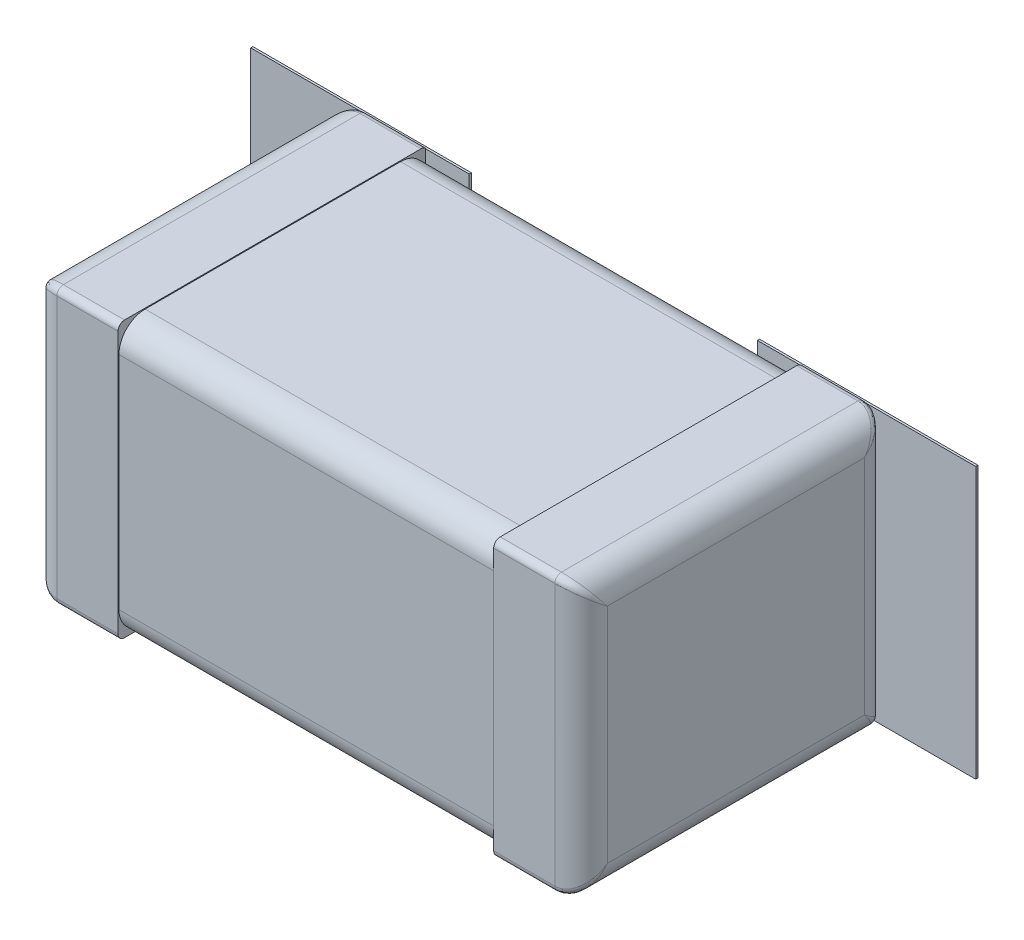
ISO-10303-21;
HEADER;
FILE_DESCRIPTION(('STEP AP214'),'2;1');
FILE_NAME('part.step','',(''),(''),'','','');
FILE_SCHEMA(('AUTOMOTIVE_DESIGN { 1 0 10303 214 1 1 1 1 }'));
ENDSEC;
DATA;
#1=APPLICATION_CONTEXT('core data for automotive mechanical design processes');
#2=APPLICATION_PROTOCOL_DEFINITION('international standard','automotive_design',2000,#1);
#3=PRODUCT_CONTEXT('',#1,'mechanical');
#4=PRODUCT('Part','Part','',(#3));
#5=PRODUCT_RELATED_PRODUCT_CATEGORY('part','',(#4));
#6=PRODUCT_DEFINITION_FORMATION('','',#4);
#7=PRODUCT_DEFINITION_CONTEXT('part definition',#1,'design');
#8=PRODUCT_DEFINITION('design','',#6,#7);
#9=PRODUCT_DEFINITION_SHAPE('','',#8);
#10=(LENGTH_UNIT() NAMED_UNIT(*) SI_UNIT(.MILLI.,.METRE.));
#11=(NAMED_UNIT(*) PLANE_ANGLE_UNIT() SI_UNIT($,.RADIAN.));
#12=(NAMED_UNIT(*) SI_UNIT($,.STERADIAN.) SOLID_ANGLE_UNIT());
#13=UNCERTAINTY_MEASURE_WITH_UNIT(LENGTH_MEASURE(1.E-05),#10,'distance_accuracy_value','');
#14=(GEOMETRIC_REPRESENTATION_CONTEXT(3) GLOBAL_UNCERTAINTY_ASSIGNED_CONTEXT((#13)) GLOBAL_UNIT_ASSIGNED_CONTEXT((#10,
#11,#12)) REPRESENTATION_CONTEXT('',''));
#15=CARTESIAN_POINT('',(0.,0.,0.));
#16=DIRECTION('',(0.,0.,1.));
#17=DIRECTION('',(1.,0.,0.));
#18=AXIS2_PLACEMENT_3D('',#15,#16,#17);
#19=CARTESIAN_POINT('',(7.60396605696,0.642366,0.233934));
#20=DIRECTION('',(-1.,0.,0.));
#21=DIRECTION('',(0.,0.,1.));
#22=AXIS2_PLACEMENT_3D('',#19,#20,#21);
#23=CYLINDRICAL_SURFACE('',#22,0.1524);
#24=CARTESIAN_POINT('',(0.8379968,0.642366,0.233934));
#25=DIRECTION('',(-1.,0.,0.));
#26=DIRECTION('',(0.,0.,1.));
#27=AXIS2_PLACEMENT_3D('',#24,#25,#26);
#28=CIRCLE('',#27,0.1524);
#29=CARTESIAN_POINT('',(0.8379968,0.689173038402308,0.0888999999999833));
#30=VERTEX_POINT('',#29);
#31=CARTESIAN_POINT('',(0.8379968,0.642366,0.081534));
#32=VERTEX_POINT('',#31);
#33=EDGE_CURVE('E1095',#30,#32,#28,.T.);
#34=ORIENTED_EDGE('',*,*,#33,.T.);
#35=DIRECTION('',(-1.,0.,0.));
#36=VECTOR('',#35,1.);
#37=CARTESIAN_POINT('',(7.60396605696,0.642366,0.081534));
#38=LINE('',#37,#36);
#39=CARTESIAN_POINT('',(-0.837996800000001,0.642366,0.081534));
#40=VERTEX_POINT('',#39);
#41=EDGE_CURVE('E172',#32,#40,#38,.T.);
#42=ORIENTED_EDGE('',*,*,#41,.T.);
#43=CARTESIAN_POINT('',(-0.837996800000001,0.642366,0.233934));
#44=DIRECTION('',(-1.,0.,0.));
#45=DIRECTION('',(0.,0.,1.));
#46=AXIS2_PLACEMENT_3D('',#43,#44,#45);
#47=CIRCLE('',#46,0.1524);
#48=CARTESIAN_POINT('',(-0.837996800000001,0.689173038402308,0.0888999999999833));
#49=VERTEX_POINT('',#48);
#50=EDGE_CURVE('E19',#40,#49,#47,.F.);
#51=ORIENTED_EDGE('',*,*,#50,.T.);
#52=DIRECTION('',(-1.,0.,0.));
#53=VECTOR('',#52,1.);
#54=CARTESIAN_POINT('',(7.60396605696,0.689173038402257,0.0888999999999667));
#55=LINE('',#54,#53);
#56=CARTESIAN_POINT('',(-1.0922,0.689173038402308,0.0888999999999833));
#57=VERTEX_POINT('',#56);
#58=EDGE_CURVE('E177',#49,#57,#55,.T.);
#59=ORIENTED_EDGE('',*,*,#58,.T.);
#60=CARTESIAN_POINT('',(-1.0922,0.642366,0.233934));
#61=DIRECTION('',(-1.,0.,0.));
#62=DIRECTION('',(0.,0.,1.));
#63=AXIS2_PLACEMENT_3D('',#60,#61,#62);
#64=CIRCLE('',#63,0.1524);
#65=CARTESIAN_POINT('',(-1.0922,0.794766,0.233934));
#66=VERTEX_POINT('',#65);
#67=EDGE_CURVE('E198',#57,#66,#64,.F.);
#68=ORIENTED_EDGE('',*,*,#67,.T.);
#69=DIRECTION('',(1.,0.,0.));
#70=VECTOR('',#69,1.);
#71=CARTESIAN_POINT('',(-1.0922,0.794766,0.233934));
#72=LINE('',#71,#70);
#73=CARTESIAN_POINT('',(1.0922,0.794766,0.233934));
#74=VERTEX_POINT('',#73);
#75=EDGE_CURVE('E958',#66,#74,#72,.T.);
#76=ORIENTED_EDGE('',*,*,#75,.T.);
#77=CARTESIAN_POINT('',(1.0922,0.642366,0.233934));
#78=DIRECTION('',(-1.,0.,0.));
#79=DIRECTION('',(0.,0.,1.));
#80=AXIS2_PLACEMENT_3D('',#77,#78,#79);
#81=CIRCLE('',#80,0.1524);
#82=CARTESIAN_POINT('',(1.0922,0.689173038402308,0.0888999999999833));
#83=VERTEX_POINT('',#82);
#84=EDGE_CURVE('E200',#74,#83,#81,.T.);
#85=ORIENTED_EDGE('',*,*,#84,.T.);
#86=DIRECTION('',(-1.,0.,0.));
#87=VECTOR('',#86,1.);
#88=CARTESIAN_POINT('',(7.60396605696,0.689173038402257,0.0888999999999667));
#89=LINE('',#88,#87);
#90=EDGE_CURVE('E203',#83,#30,#89,.T.);
#91=ORIENTED_EDGE('',*,*,#90,.T.);
#92=EDGE_LOOP('',(#34,#42,#51,#59,#68,#76,#85,#91));
#93=FACE_BOUND('',#92,.T.);
#94=ADVANCED_FACE('F16',(#93),#23,.T.);
#95=CARTESIAN_POINT('',(1.4478,2.88612072,0.2286));
#96=DIRECTION('',(0.,-1.,0.));
#97=DIRECTION('',(0.,0.,-1.));
#98=AXIS2_PLACEMENT_3D('',#95,#96,#97);
#99=CYLINDRICAL_SURFACE('',#98,0.1524);
#100=CARTESIAN_POINT('',(1.44433343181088,-0.761971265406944,0.0762405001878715));
#101=CARTESIAN_POINT('',(1.45315078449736,-0.762119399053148,0.0760429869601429));
#102=CARTESIAN_POINT('',(1.47288174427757,-0.761168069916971,0.0773114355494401));
#103=CARTESIAN_POINT('',(1.5028666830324,-0.755220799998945,0.0852411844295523));
#104=CARTESIAN_POINT('',(1.53297387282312,-0.743651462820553,0.100667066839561));
#105=CARTESIAN_POINT('',(1.56015756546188,-0.726514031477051,0.123517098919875));
#106=CARTESIAN_POINT('',(1.58234424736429,-0.70390729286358,0.153659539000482));
#107=CARTESIAN_POINT('',(1.59686821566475,-0.676961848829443,0.189586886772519));
#108=CARTESIAN_POINT('',(1.60030107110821,-0.656937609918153,0.216285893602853));
#109=CARTESIAN_POINT('',(1.60019411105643,-0.646346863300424,0.230406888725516));
#110=CARTESIAN_POINT('',(1.60017949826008,-0.64566911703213,0.231310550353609));
#111=(BOUNDED_CURVE() B_SPLINE_CURVE(3,(#100,#101,#102,#103,#104,#105,#106,#107,#108,#109,#110),
.UNSPECIFIED.,.F.,.F.) B_SPLINE_CURVE_WITH_KNOTS((4,1,1,1,1,1,1,1,4),(-0.01227463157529,
0.08136651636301,0.19606551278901,0.32090050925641,0.46099875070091,0.61816399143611,
0.79264217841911,0.97228629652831,0.9845609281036),
.UNSPECIFIED.) CURVE() GEOMETRIC_REPRESENTATION_ITEM() RATIONAL_B_SPLINE_CURVE((1.17153636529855,
1.17153636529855,1.17153636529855,1.17153636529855,1.17153636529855,1.17153636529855,
1.17153636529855,1.17153636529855,1.17153636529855,1.17153636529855,1.17153636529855)) REPRESENTATION_ITEM(''));
#112=CARTESIAN_POINT('',(1.60019999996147,-0.647700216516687,0.228600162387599));
#113=VERTEX_POINT('',#112);
#114=CARTESIAN_POINT('',(1.50870645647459,-0.752476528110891,0.088900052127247));
#115=VERTEX_POINT('',#114);
#116=EDGE_CURVE('E1087',#113,#115,#111,.F.);
#117=ORIENTED_EDGE('',*,*,#116,.T.);
#118=DIRECTION('',(0.,1.,0.));
#119=VECTOR('',#118,1.);
#120=CARTESIAN_POINT('',(1.5087085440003,0.,0.0889));
#121=LINE('',#120,#119);
#122=CARTESIAN_POINT('',(1.50870849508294,0.75247487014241,0.0889001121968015));
#123=VERTEX_POINT('',#122);
#124=EDGE_CURVE('E1025',#123,#115,#121,.F.);
#125=ORIENTED_EDGE('',*,*,#124,.F.);
#126=CARTESIAN_POINT('',(1.60019999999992,0.647699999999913,0.228599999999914));
#127=CARTESIAN_POINT('',(1.60019801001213,0.649089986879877,0.22674966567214));
#128=CARTESIAN_POINT('',(1.60016326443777,0.650480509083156,0.224899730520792));
#129=CARTESIAN_POINT('',(1.6000230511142,0.653352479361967,0.221079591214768));
#130=CARTESIAN_POINT('',(1.59991306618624,0.65483387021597,0.219109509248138));
#131=CARTESIAN_POINT('',(1.59960772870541,0.657885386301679,0.21505019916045));
#132=CARTESIAN_POINT('',(1.59940749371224,0.659455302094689,0.212961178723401));
#133=CARTESIAN_POINT('',(1.59890583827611,0.662681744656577,0.208665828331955));
#134=CARTESIAN_POINT('',(1.59859914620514,0.664337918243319,0.206459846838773));
#135=CARTESIAN_POINT('',(1.59786761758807,0.667734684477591,0.201933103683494));
#136=CARTESIAN_POINT('',(1.59743709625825,0.669474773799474,0.199612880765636));
#137=CARTESIAN_POINT('',(1.59643983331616,0.673037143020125,0.194861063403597));
#138=CARTESIAN_POINT('',(1.59586696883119,0.674858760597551,0.192430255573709));
#139=CARTESIAN_POINT('',(1.59456626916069,0.678581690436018,0.187462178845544));
#140=CARTESIAN_POINT('',(1.59383188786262,0.680482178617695,0.184926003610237));
#141=CARTESIAN_POINT('',(1.59218731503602,0.684356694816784,0.179755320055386));
#142=CARTESIAN_POINT('',(1.59127017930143,0.686329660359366,0.177122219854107));
#143=CARTESIAN_POINT('',(1.58923788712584,0.690340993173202,0.171768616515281));
#144=CARTESIAN_POINT('',(1.58811540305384,0.692378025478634,0.169049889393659));
#145=CARTESIAN_POINT('',(1.5856489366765,0.696507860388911,0.163538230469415));
#146=CARTESIAN_POINT('',(1.58429722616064,0.698599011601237,0.160747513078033));
#147=CARTESIAN_POINT('',(1.58134829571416,0.702826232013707,0.155107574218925));
#148=CARTESIAN_POINT('',(1.57974295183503,0.704960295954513,0.152261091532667));
#149=CARTESIAN_POINT('',(1.5762605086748,0.709258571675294,0.146528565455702));
#150=CARTESIAN_POINT('',(1.57437485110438,0.711420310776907,0.143645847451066));
#151=CARTESIAN_POINT('',(1.57068743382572,0.715345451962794,0.138411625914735));
#152=CARTESIAN_POINT('',(1.5689166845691,0.717119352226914,0.13604611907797));
#153=CARTESIAN_POINT('',(1.56530312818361,0.720526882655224,0.131504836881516));
#154=CARTESIAN_POINT('',(1.56346751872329,0.72216319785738,0.129325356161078));
#155=CARTESIAN_POINT('',(1.5597460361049,0.72529835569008,0.125152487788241));
#156=CARTESIAN_POINT('',(1.5578669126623,0.726800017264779,0.123155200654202));
#157=CARTESIAN_POINT('',(1.55407974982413,0.729668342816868,0.119342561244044));
#158=CARTESIAN_POINT('',(1.55217808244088,0.731037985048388,0.117523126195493));
#159=CARTESIAN_POINT('',(1.54836561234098,0.733642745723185,0.114062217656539));
#160=CARTESIAN_POINT('',(1.54646094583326,0.734881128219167,0.112416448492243));
#161=CARTESIAN_POINT('',(1.54266180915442,0.737226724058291,0.109296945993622));
#162=CARTESIAN_POINT('',(1.54077311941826,0.738337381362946,0.107818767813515));
#163=CARTESIAN_POINT('',(1.53702414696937,0.740432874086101,0.105026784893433));
#164=CARTESIAN_POINT('',(1.53516921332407,0.741421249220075,0.103708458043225));
#165=CARTESIAN_POINT('',(1.53150515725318,0.743279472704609,0.101227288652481));
#166=CARTESIAN_POINT('',(1.52970089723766,0.744152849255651,0.100059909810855));
#167=CARTESIAN_POINT('',(1.52615575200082,0.745787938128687,0.097871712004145));
#168=CARTESIAN_POINT('',(1.52441929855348,0.746553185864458,0.0968463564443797));
#169=CARTESIAN_POINT('',(1.52102645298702,0.747979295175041,0.0949331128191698));
#170=CARTESIAN_POINT('',(1.51937408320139,0.748643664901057,0.0940407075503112));
#171=CARTESIAN_POINT('',(1.51616403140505,0.74987688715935,0.0923833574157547));
#172=CARTESIAN_POINT('',(1.51460991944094,0.750449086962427,0.0916139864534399));
#173=CARTESIAN_POINT('',(1.51160927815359,0.751508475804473,0.0901921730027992));
#174=CARTESIAN_POINT('',(1.51016582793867,0.751998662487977,0.0895354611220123));
#175=CARTESIAN_POINT('',(1.50870854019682,0.752474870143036,0.088900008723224));
#176=B_SPLINE_CURVE_WITH_KNOTS('',3,(#126,#127,#128,#129,#130,#131,#132,#133,#134,#135,#136,
#137,#138,#139,#140,#141,#142,#143,#144,#145,#146,#147,#148,#149,#150,#151,#152,#153,#154,#155,
#156,#157,#158,#159,#160,#161,#162,#163,#164,#165,#166,#167,#168,#169,#170,#171,#172,#173,#174,
#175),.UNSPECIFIED.,.F.,.F.,(4,2,2,2,2,2,2,2,2,2,2,2,2,2,2,2,2,2,2,2,2,2,2,2,4),(0.,
0.00694260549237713,0.0143435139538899,0.0222045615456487,0.0305292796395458,0.0393232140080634,
0.048594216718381,0.058350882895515,0.0685943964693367,0.079323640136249,0.0905387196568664,
0.102241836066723,0.114434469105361,0.124768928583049,0.134622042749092,0.143997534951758,
0.152894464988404,0.16130692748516,0.169232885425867,0.176673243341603,0.183629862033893,
0.190098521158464,0.196072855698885,0.201549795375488,0.206528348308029),.UNSPECIFIED.);
#177=CARTESIAN_POINT('',(1.60019999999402,0.647699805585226,0.228599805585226));
#178=VERTEX_POINT('',#177);
#179=EDGE_CURVE('E917',#123,#178,#176,.F.);
#180=ORIENTED_EDGE('',*,*,#179,.T.);
#181=DIRECTION('',(0.,1.,0.));
#182=VECTOR('',#181,1.);
#183=CARTESIAN_POINT('',(1.6002,-0.8001,0.2286));
#184=LINE('',#183,#182);
#185=EDGE_CURVE('E878',#113,#178,#184,.T.);
#186=ORIENTED_EDGE('',*,*,#185,.F.);
#187=EDGE_LOOP('',(#117,#125,#180,#186));
#188=FACE_BOUND('',#187,.T.);
#189=ADVANCED_FACE('F1039',(#188),#99,.T.);
#190=CARTESIAN_POINT('',(0.,0.,0.0889));
#191=DIRECTION('',(0.,0.,1.));
#192=DIRECTION('',(1.,0.,0.));
#193=AXIS2_PLACEMENT_3D('',#190,#191,#192);
#194=PLANE('',#193);
#195=DIRECTION('',(0.,1.,0.));
#196=VECTOR('',#195,1.);
#197=CARTESIAN_POINT('',(2.1079968,-0.7875016,0.0889));
#198=LINE('',#197,#196);
#199=CARTESIAN_POINT('',(2.1079968,0.7875016,0.0889));
#200=VERTEX_POINT('',#199);
#201=CARTESIAN_POINT('',(2.1079968,-0.7875016,0.0889));
#202=VERTEX_POINT('',#201);
#203=EDGE_CURVE('E877',#200,#202,#198,.F.);
#204=ORIENTED_EDGE('',*,*,#203,.F.);
#205=DIRECTION('',(1.,0.,0.));
#206=VECTOR('',#205,1.);
#207=CARTESIAN_POINT('',(0.,0.7875016,0.0889));
#208=LINE('',#207,#206);
#209=CARTESIAN_POINT('',(1.47011255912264,0.7875016,0.0889000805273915));
#210=VERTEX_POINT('',#209);
#211=EDGE_CURVE('E1015',#200,#210,#208,.F.);
#212=ORIENTED_EDGE('',*,*,#211,.T.);
#213=CARTESIAN_POINT('',(1.47011253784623,0.787501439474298,0.0889000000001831));
#214=CARTESIAN_POINT('',(1.47403562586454,0.786446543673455,0.0888999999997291));
#215=CARTESIAN_POINT('',(1.47790214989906,0.785099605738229,0.0888999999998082));
#216=CARTESIAN_POINT('',(1.48537748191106,0.781749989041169,0.0889000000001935));
#217=CARTESIAN_POINT('',(1.48898367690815,0.779741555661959,0.0889000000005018));
#218=CARTESIAN_POINT('',(1.49590666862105,0.774881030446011,0.0889000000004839));
#219=CARTESIAN_POINT('',(1.499195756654,0.771987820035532,0.0889000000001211));
#220=CARTESIAN_POINT('',(1.50408793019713,0.766062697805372,0.0888999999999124));
#221=CARTESIAN_POINT('',(1.50590615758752,0.763230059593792,0.0888999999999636));
#222=CARTESIAN_POINT('',(1.50808252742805,0.757740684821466,0.0889000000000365));
#223=CARTESIAN_POINT('',(1.50866413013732,0.755167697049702,0.0889000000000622));
#224=CARTESIAN_POINT('',(1.50870852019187,0.752474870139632,0.0889000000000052));
#225=B_SPLINE_CURVE_WITH_KNOTS('',3,(#213,#214,#215,#216,#217,#218,#219,#220,#221,#222,#223,
#224),.UNSPECIFIED.,.F.,.F.,(4,2,2,2,2,4),(0.,0.0122087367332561,0.0245266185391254,
0.0375377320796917,0.0474318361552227,0.0552899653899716),.UNSPECIFIED.);
#226=EDGE_CURVE('E1028',#210,#123,#225,.T.);
#227=ORIENTED_EDGE('',*,*,#226,.T.);
#228=ORIENTED_EDGE('',*,*,#124,.T.);
#229=CARTESIAN_POINT('',(1.50870583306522,-0.752476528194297,0.0889000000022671));
#230=CARTESIAN_POINT('',(1.50867366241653,-0.754931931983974,0.0889000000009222));
#231=CARTESIAN_POINT('',(1.5081825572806,-0.757297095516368,0.0889000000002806));
#232=CARTESIAN_POINT('',(1.50622597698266,-0.762636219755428,0.0888999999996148));
#233=CARTESIAN_POINT('',(1.50446530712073,-0.765508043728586,0.0888999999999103));
#234=CARTESIAN_POINT('',(1.50078838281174,-0.770120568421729,0.0889000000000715));
#235=CARTESIAN_POINT('',(1.49899032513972,-0.771971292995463,0.088900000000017));
#236=CARTESIAN_POINT('',(1.49512487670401,-0.775383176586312,0.0888999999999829));
#237=CARTESIAN_POINT('',(1.49305676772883,-0.776943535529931,0.0889000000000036));
#238=CARTESIAN_POINT('',(1.48770505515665,-0.780470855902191,0.0889000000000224));
#239=CARTESIAN_POINT('',(1.48431491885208,-0.782272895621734,0.088900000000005));
#240=CARTESIAN_POINT('',(1.47733532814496,-0.78529595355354,0.0888999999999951));
#241=CARTESIAN_POINT('',(1.47374909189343,-0.786524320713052,0.0889000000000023));
#242=CARTESIAN_POINT('',(1.47011348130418,-0.787501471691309,0.088900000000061));
#243=B_SPLINE_CURVE_WITH_KNOTS('',3,(#229,#230,#231,#232,#233,#234,#235,#236,#237,#238,#239,
#240,#241,#242),.UNSPECIFIED.,.F.,.F.,(4,2,2,2,2,2,4),(0.,0.00719769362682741,
0.0170810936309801,0.0248034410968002,0.0325467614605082,0.0440110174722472,0.0553240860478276),.UNSPECIFIED.);
#244=CARTESIAN_POINT('',(1.47011348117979,-0.787501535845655,0.0889000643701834));
#245=VERTEX_POINT('',#244);
#246=EDGE_CURVE('E1022',#115,#245,#243,.T.);
#247=ORIENTED_EDGE('',*,*,#246,.T.);
#248=DIRECTION('',(1.,0.,0.));
#249=VECTOR('',#248,1.);
#250=CARTESIAN_POINT('',(0.,-0.7875016,0.0889));
#251=LINE('',#250,#249);
#252=EDGE_CURVE('E1017',#245,#202,#251,.T.);
#253=ORIENTED_EDGE('',*,*,#252,.T.);
#254=EDGE_LOOP('',(#204,#212,#227,#228,#247,#253));
#255=FACE_BOUND('',#254,.T.);
#256=ADVANCED_FACE('F998',(#255),#194,.T.);
#257=CARTESIAN_POINT('',(-1.4478,-2.88612072,0.2286));
#258=DIRECTION('',(0.,1.,0.));
#259=DIRECTION('',(0.,0.,1.));
#260=AXIS2_PLACEMENT_3D('',#257,#258,#259);
#261=CYLINDRICAL_SURFACE('',#260,0.1524);
#262=CARTESIAN_POINT('',(-1.44433343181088,0.76197126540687,0.0762405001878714));
#263=CARTESIAN_POINT('',(-1.45315078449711,0.762119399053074,0.0760429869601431));
#264=CARTESIAN_POINT('',(-1.47288174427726,0.761168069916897,0.0773114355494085));
#265=CARTESIAN_POINT('',(-1.50286668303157,0.755220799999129,0.085241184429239));
#266=CARTESIAN_POINT('',(-1.53297387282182,0.74365146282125,0.100667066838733));
#267=CARTESIAN_POINT('',(-1.56015756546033,0.726514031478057,0.12351709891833));
#268=CARTESIAN_POINT('',(-1.58234424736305,0.703907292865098,0.153659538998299));
#269=CARTESIAN_POINT('',(-1.59686821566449,0.67696184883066,0.189586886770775));
#270=CARTESIAN_POINT('',(-1.60030107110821,0.656937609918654,0.216285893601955));
#271=CARTESIAN_POINT('',(-1.60019411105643,0.646346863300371,0.230406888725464));
#272=CARTESIAN_POINT('',(-1.60017949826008,0.645669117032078,0.231310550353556));
#273=(BOUNDED_CURVE() B_SPLINE_CURVE(3,(#262,#263,#264,#265,#266,#267,#268,#269,#270,#271,#272),
.UNSPECIFIED.,.F.,.F.) B_SPLINE_CURVE_WITH_KNOTS((4,1,1,1,1,1,1,1,4),(-0.01227463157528,
0.08136651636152,0.19606551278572,0.32090050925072,0.46099875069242,0.61816399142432,
0.79264217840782,0.97228629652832,0.9845609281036),
.UNSPECIFIED.) CURVE() GEOMETRIC_REPRESENTATION_ITEM() RATIONAL_B_SPLINE_CURVE((1.1715363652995,
1.1715363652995,1.1715363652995,1.1715363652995,1.1715363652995,1.1715363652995,1.1715363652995,
1.1715363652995,1.1715363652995,1.1715363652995,1.1715363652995)) REPRESENTATION_ITEM(''));
#274=CARTESIAN_POINT('',(-1.60019999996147,0.647700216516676,0.228600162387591));
#275=VERTEX_POINT('',#274);
#276=CARTESIAN_POINT('',(-1.5087064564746,0.752476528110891,0.0889000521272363));
#277=VERTEX_POINT('',#276);
#278=EDGE_CURVE('E1075',#275,#277,#273,.F.);
#279=ORIENTED_EDGE('',*,*,#278,.T.);
#280=DIRECTION('',(0.,1.,0.));
#281=VECTOR('',#280,1.);
#282=CARTESIAN_POINT('',(-1.5087085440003,0.,0.0889));
#283=LINE('',#282,#281);
#284=CARTESIAN_POINT('',(-1.50870849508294,-0.75247487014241,0.0889001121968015));
#285=VERTEX_POINT('',#284);
#286=EDGE_CURVE('E969',#285,#277,#283,.T.);
#287=ORIENTED_EDGE('',*,*,#286,.F.);
#288=CARTESIAN_POINT('',(-1.60019999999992,-0.647699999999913,0.228599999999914));
#289=CARTESIAN_POINT('',(-1.60019801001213,-0.649089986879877,0.22674966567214));
#290=CARTESIAN_POINT('',(-1.60016326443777,-0.650480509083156,0.224899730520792));
#291=CARTESIAN_POINT('',(-1.6000230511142,-0.653352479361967,0.221079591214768));
#292=CARTESIAN_POINT('',(-1.59991306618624,-0.65483387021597,0.219109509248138));
#293=CARTESIAN_POINT('',(-1.59960772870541,-0.657885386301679,0.21505019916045));
#294=CARTESIAN_POINT('',(-1.59940749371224,-0.659455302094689,0.212961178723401));
#295=CARTESIAN_POINT('',(-1.59890583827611,-0.662681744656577,0.208665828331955));
#296=CARTESIAN_POINT('',(-1.59859914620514,-0.664337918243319,0.206459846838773));
#297=CARTESIAN_POINT('',(-1.59786761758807,-0.667734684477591,0.201933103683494));
#298=CARTESIAN_POINT('',(-1.59743709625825,-0.669474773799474,0.199612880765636));
#299=CARTESIAN_POINT('',(-1.59643983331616,-0.673037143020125,0.194861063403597));
#300=CARTESIAN_POINT('',(-1.59586696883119,-0.674858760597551,0.192430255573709));
#301=CARTESIAN_POINT('',(-1.59456626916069,-0.678581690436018,0.187462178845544));
#302=CARTESIAN_POINT('',(-1.59383188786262,-0.680482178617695,0.184926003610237));
#303=CARTESIAN_POINT('',(-1.59218731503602,-0.684356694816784,0.179755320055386));
#304=CARTESIAN_POINT('',(-1.59127017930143,-0.686329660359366,0.177122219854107));
#305=CARTESIAN_POINT('',(-1.58923788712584,-0.690340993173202,0.171768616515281));
#306=CARTESIAN_POINT('',(-1.58811540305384,-0.692378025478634,0.169049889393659));
#307=CARTESIAN_POINT('',(-1.5856489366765,-0.696507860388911,0.163538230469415));
#308=CARTESIAN_POINT('',(-1.58429722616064,-0.698599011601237,0.160747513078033));
#309=CARTESIAN_POINT('',(-1.58134829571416,-0.702826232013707,0.155107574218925));
#310=CARTESIAN_POINT('',(-1.57974295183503,-0.704960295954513,0.152261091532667));
#311=CARTESIAN_POINT('',(-1.5762605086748,-0.709258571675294,0.146528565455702));
#312=CARTESIAN_POINT('',(-1.57437485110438,-0.711420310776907,0.143645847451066));
#313=CARTESIAN_POINT('',(-1.57068743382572,-0.715345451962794,0.138411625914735));
#314=CARTESIAN_POINT('',(-1.5689166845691,-0.717119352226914,0.13604611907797));
#315=CARTESIAN_POINT('',(-1.56530312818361,-0.720526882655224,0.131504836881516));
#316=CARTESIAN_POINT('',(-1.56346751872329,-0.72216319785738,0.129325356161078));
#317=CARTESIAN_POINT('',(-1.5597460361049,-0.72529835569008,0.125152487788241));
#318=CARTESIAN_POINT('',(-1.5578669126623,-0.726800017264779,0.123155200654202));
#319=CARTESIAN_POINT('',(-1.55407974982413,-0.729668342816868,0.119342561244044));
#320=CARTESIAN_POINT('',(-1.55217808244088,-0.731037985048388,0.117523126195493));
#321=CARTESIAN_POINT('',(-1.54836561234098,-0.733642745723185,0.114062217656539));
#322=CARTESIAN_POINT('',(-1.54646094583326,-0.734881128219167,0.112416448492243));
#323=CARTESIAN_POINT('',(-1.54266180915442,-0.737226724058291,0.109296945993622));
#324=CARTESIAN_POINT('',(-1.54077311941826,-0.738337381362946,0.107818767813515));
#325=CARTESIAN_POINT('',(-1.53702414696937,-0.740432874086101,0.105026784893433));
#326=CARTESIAN_POINT('',(-1.53516921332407,-0.741421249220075,0.103708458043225));
#327=CARTESIAN_POINT('',(-1.53150515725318,-0.743279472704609,0.101227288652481));
#328=CARTESIAN_POINT('',(-1.52970089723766,-0.744152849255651,0.100059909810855));
#329=CARTESIAN_POINT('',(-1.52615575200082,-0.745787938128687,0.097871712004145));
#330=CARTESIAN_POINT('',(-1.52441929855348,-0.746553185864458,0.0968463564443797));
#331=CARTESIAN_POINT('',(-1.52102645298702,-0.747979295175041,0.0949331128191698));
#332=CARTESIAN_POINT('',(-1.51937408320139,-0.748643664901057,0.0940407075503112));
#333=CARTESIAN_POINT('',(-1.51616403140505,-0.74987688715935,0.0923833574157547));
#334=CARTESIAN_POINT('',(-1.51460991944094,-0.750449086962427,0.0916139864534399));
#335=CARTESIAN_POINT('',(-1.51160927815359,-0.751508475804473,0.0901921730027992));
#336=CARTESIAN_POINT('',(-1.51016582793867,-0.751998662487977,0.0895354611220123));
#337=CARTESIAN_POINT('',(-1.50870854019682,-0.752474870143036,0.088900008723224));
#338=B_SPLINE_CURVE_WITH_KNOTS('',3,(#288,#289,#290,#291,#292,#293,#294,#295,#296,#297,#298,
#299,#300,#301,#302,#303,#304,#305,#306,#307,#308,#309,#310,#311,#312,#313,#314,#315,#316,#317,
#318,#319,#320,#321,#322,#323,#324,#325,#326,#327,#328,#329,#330,#331,#332,#333,#334,#335,#336,
#337),.UNSPECIFIED.,.F.,.F.,(4,2,2,2,2,2,2,2,2,2,2,2,2,2,2,2,2,2,2,2,2,2,2,2,4),(0.,
0.00694260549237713,0.0143435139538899,0.0222045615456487,0.0305292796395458,0.0393232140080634,
0.048594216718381,0.058350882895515,0.0685943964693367,0.079323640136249,0.0905387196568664,
0.102241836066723,0.114434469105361,0.124768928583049,0.134622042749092,0.143997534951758,
0.152894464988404,0.16130692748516,0.169232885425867,0.176673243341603,0.183629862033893,
0.190098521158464,0.196072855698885,0.201549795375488,0.206528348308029),.UNSPECIFIED.);
#339=CARTESIAN_POINT('',(-1.60019999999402,-0.647699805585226,0.228599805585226));
#340=VERTEX_POINT('',#339);
#341=EDGE_CURVE('E980',#285,#340,#338,.F.);
#342=ORIENTED_EDGE('',*,*,#341,.T.);
#343=DIRECTION('',(0.,1.,0.));
#344=VECTOR('',#343,1.);
#345=CARTESIAN_POINT('',(-1.6002,0.8001,0.2286));
#346=LINE('',#345,#344);
#347=EDGE_CURVE('E811',#275,#340,#346,.F.);
#348=ORIENTED_EDGE('',*,*,#347,.F.);
#349=EDGE_LOOP('',(#279,#287,#342,#348));
#350=FACE_BOUND('',#349,.T.);
#351=ADVANCED_FACE('F987',(#350),#261,.T.);
#352=CARTESIAN_POINT('',(0.,0.,0.0889));
#353=DIRECTION('',(0.,0.,1.));
#354=DIRECTION('',(1.,0.,0.));
#355=AXIS2_PLACEMENT_3D('',#352,#353,#354);
#356=PLANE('',#355);
#357=DIRECTION('',(0.,1.,0.));
#358=VECTOR('',#357,1.);
#359=CARTESIAN_POINT('',(-2.1079968,0.7875016,0.0889));
#360=LINE('',#359,#358);
#361=CARTESIAN_POINT('',(-2.1079968,-0.7875016,0.0889));
#362=VERTEX_POINT('',#361);
#363=CARTESIAN_POINT('',(-2.1079968,0.7875016,0.0889));
#364=VERTEX_POINT('',#363);
#365=EDGE_CURVE('E1060',#362,#364,#360,.T.);
#366=ORIENTED_EDGE('',*,*,#365,.F.);
#367=DIRECTION('',(1.,0.,0.));
#368=VECTOR('',#367,1.);
#369=CARTESIAN_POINT('',(0.,-0.7875016,0.0889));
#370=LINE('',#369,#368);
#371=CARTESIAN_POINT('',(-1.47011255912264,-0.7875016,0.0889000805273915));
#372=VERTEX_POINT('',#371);
#373=EDGE_CURVE('E959',#362,#372,#370,.T.);
#374=ORIENTED_EDGE('',*,*,#373,.T.);
#375=CARTESIAN_POINT('',(-1.47011253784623,-0.787501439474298,0.0889000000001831));
#376=CARTESIAN_POINT('',(-1.47403562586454,-0.786446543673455,0.0888999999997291));
#377=CARTESIAN_POINT('',(-1.47790214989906,-0.785099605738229,0.0888999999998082));
#378=CARTESIAN_POINT('',(-1.48537748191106,-0.781749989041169,0.0889000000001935));
#379=CARTESIAN_POINT('',(-1.48898367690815,-0.779741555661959,0.0889000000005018));
#380=CARTESIAN_POINT('',(-1.49590666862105,-0.774881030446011,0.0889000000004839));
#381=CARTESIAN_POINT('',(-1.499195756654,-0.771987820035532,0.0889000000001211));
#382=CARTESIAN_POINT('',(-1.50408793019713,-0.766062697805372,0.0888999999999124));
#383=CARTESIAN_POINT('',(-1.50590615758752,-0.763230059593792,0.0888999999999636));
#384=CARTESIAN_POINT('',(-1.50808252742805,-0.757740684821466,0.0889000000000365));
#385=CARTESIAN_POINT('',(-1.50866413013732,-0.755167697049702,0.0889000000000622));
#386=CARTESIAN_POINT('',(-1.50870852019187,-0.752474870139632,0.0889000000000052));
#387=B_SPLINE_CURVE_WITH_KNOTS('',3,(#375,#376,#377,#378,#379,#380,#381,#382,#383,#384,#385,
#386),.UNSPECIFIED.,.F.,.F.,(4,2,2,2,2,4),(0.,0.0122087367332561,0.0245266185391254,
0.0375377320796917,0.0474318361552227,0.0552899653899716),.UNSPECIFIED.);
#388=EDGE_CURVE('E972',#372,#285,#387,.T.);
#389=ORIENTED_EDGE('',*,*,#388,.T.);
#390=ORIENTED_EDGE('',*,*,#286,.T.);
#391=CARTESIAN_POINT('',(-1.50870583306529,0.752476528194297,0.0889000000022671));
#392=CARTESIAN_POINT('',(-1.50867366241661,0.754931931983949,0.0889000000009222));
#393=CARTESIAN_POINT('',(-1.50818255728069,0.75729709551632,0.0889000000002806));
#394=CARTESIAN_POINT('',(-1.50622597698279,0.76263621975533,0.0888999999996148));
#395=CARTESIAN_POINT('',(-1.50446530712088,0.765508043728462,0.0888999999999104));
#396=CARTESIAN_POINT('',(-1.50078838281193,0.770120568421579,0.0889000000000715));
#397=CARTESIAN_POINT('',(-1.49899032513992,0.771971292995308,0.088900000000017));
#398=CARTESIAN_POINT('',(-1.49512487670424,0.77538317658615,0.0888999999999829));
#399=CARTESIAN_POINT('',(-1.49305676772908,0.776943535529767,0.0889000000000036));
#400=CARTESIAN_POINT('',(-1.48770505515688,0.780470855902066,0.0889000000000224));
#401=CARTESIAN_POINT('',(-1.48431491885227,0.782272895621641,0.088900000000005));
#402=CARTESIAN_POINT('',(-1.47733532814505,0.785295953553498,0.0888999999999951));
#403=CARTESIAN_POINT('',(-1.47374909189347,0.786524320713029,0.0889000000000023));
#404=CARTESIAN_POINT('',(-1.47011348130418,0.787501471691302,0.088900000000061));
#405=B_SPLINE_CURVE_WITH_KNOTS('',3,(#391,#392,#393,#394,#395,#396,#397,#398,#399,#400,#401,
#402,#403,#404),.UNSPECIFIED.,.F.,.F.,(4,2,2,2,2,2,4),(0.,0.00719769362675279,
0.0170810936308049,0.0248034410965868,0.0325467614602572,0.0440110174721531,0.0553240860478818),.UNSPECIFIED.);
#406=CARTESIAN_POINT('',(-1.47011348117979,0.787501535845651,0.0889000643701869));
#407=VERTEX_POINT('',#406);
#408=EDGE_CURVE('E966',#277,#407,#405,.T.);
#409=ORIENTED_EDGE('',*,*,#408,.T.);
#410=DIRECTION('',(1.,0.,0.));
#411=VECTOR('',#410,1.);
#412=CARTESIAN_POINT('',(0.,0.7875016,0.0889));
#413=LINE('',#412,#411);
#414=EDGE_CURVE('E961',#407,#364,#413,.F.);
#415=ORIENTED_EDGE('',*,*,#414,.T.);
#416=EDGE_LOOP('',(#366,#374,#389,#390,#409,#415));
#417=FACE_BOUND('',#416,.T.);
#418=ADVANCED_FACE('F997',(#417),#356,.T.);
#419=CARTESIAN_POINT('',(-1.0922,0.794766,0.0762));
#420=DIRECTION('',(0.,-1.,0.));
#421=DIRECTION('',(0.,0.,-1.));
#422=AXIS2_PLACEMENT_3D('',#419,#420,#421);
#423=PLANE('',#422);
#424=ORIENTED_EDGE('',*,*,#75,.F.);
#425=DIRECTION('',(0.,0.,-1.));
#426=VECTOR('',#425,1.);
#427=CARTESIAN_POINT('',(-1.0922,0.794766,0.0762));
#428=LINE('',#427,#426);
#429=CARTESIAN_POINT('',(-1.0922,0.794766,1.718564));
#430=VERTEX_POINT('',#429);
#431=EDGE_CURVE('E955',#430,#66,#428,.T.);
#432=ORIENTED_EDGE('',*,*,#431,.F.);
#433=DIRECTION('',(-1.,0.,0.));
#434=VECTOR('',#433,1.);
#435=CARTESIAN_POINT('',(7.60396605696,0.794766,1.718564));
#436=LINE('',#435,#434);
#437=CARTESIAN_POINT('',(1.0922,0.794766,1.718564));
#438=VERTEX_POINT('',#437);
#439=EDGE_CURVE('E927',#438,#430,#436,.T.);
#440=ORIENTED_EDGE('',*,*,#439,.F.);
#441=DIRECTION('',(0.,0.,-1.));
#442=VECTOR('',#441,1.);
#443=CARTESIAN_POINT('',(1.0922,0.794766,0.0762));
#444=LINE('',#443,#442);
#445=EDGE_CURVE('E887',#74,#438,#444,.F.);
#446=ORIENTED_EDGE('',*,*,#445,.F.);
#447=EDGE_LOOP('',(#424,#432,#440,#446));
#448=FACE_BOUND('',#447,.T.);
#449=ADVANCED_FACE('F1898',(#448),#423,.F.);
#450=CARTESIAN_POINT('',(1.6002,-0.8001,0.0762));
#451=DIRECTION('',(1.,0.,0.));
#452=DIRECTION('',(0.,0.,-1.));
#453=AXIS2_PLACEMENT_3D('',#450,#451,#452);
#454=PLANE('',#453);
#455=DIRECTION('',(0.,0.,-1.));
#456=VECTOR('',#455,1.);
#457=CARTESIAN_POINT('',(1.6002,0.6477,4.2229057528));
#458=LINE('',#457,#456);
#459=CARTESIAN_POINT('',(1.60020000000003,0.647699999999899,1.7238980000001));
#460=VERTEX_POINT('',#459);
#461=EDGE_CURVE('E926',#460,#178,#458,.T.);
#462=ORIENTED_EDGE('',*,*,#461,.F.);
#463=DIRECTION('',(0.,1.,0.));
#464=VECTOR('',#463,1.);
#465=CARTESIAN_POINT('',(1.6002,-2.88612072,1.723898));
#466=LINE('',#465,#464);
#467=CARTESIAN_POINT('',(1.60019999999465,-0.647699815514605,1.72389818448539));
#468=VERTEX_POINT('',#467);
#469=EDGE_CURVE('E679',#468,#460,#466,.T.);
#470=ORIENTED_EDGE('',*,*,#469,.F.);
#471=DIRECTION('',(0.,0.,-1.));
#472=VECTOR('',#471,1.);
#473=CARTESIAN_POINT('',(1.6002,-0.6477,4.2229057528));
#474=LINE('',#473,#472);
#475=EDGE_CURVE('E623',#113,#468,#474,.F.);
#476=ORIENTED_EDGE('',*,*,#475,.F.);
#477=ORIENTED_EDGE('',*,*,#185,.T.);
#478=EDGE_LOOP('',(#462,#470,#476,#477));
#479=FACE_BOUND('',#478,.T.);
#480=ADVANCED_FACE('F1426',(#479),#454,.T.);
#481=CARTESIAN_POINT('',(2.1079968,-0.7875016,0.0762));
#482=DIRECTION('',(1.,0.,0.));
#483=DIRECTION('',(0.,0.,-1.));
#484=AXIS2_PLACEMENT_3D('',#481,#482,#483);
#485=PLANE('',#484);
#486=DIRECTION('',(0.,0.,-1.));
#487=VECTOR('',#486,1.);
#488=CARTESIAN_POINT('',(2.1079968,-0.7875016,0.0762));
#489=LINE('',#488,#487);
#490=CARTESIAN_POINT('',(2.1079968,-0.7875016,0.0762));
#491=VERTEX_POINT('',#490);
#492=EDGE_CURVE('E815',#202,#491,#489,.T.);
#493=ORIENTED_EDGE('',*,*,#492,.T.);
#494=DIRECTION('',(0.,1.,0.));
#495=VECTOR('',#494,1.);
#496=CARTESIAN_POINT('',(2.1079968,0.,0.0762));
#497=LINE('',#496,#495);
#498=CARTESIAN_POINT('',(2.1079968,0.7875016,0.0762));
#499=VERTEX_POINT('',#498);
#500=EDGE_CURVE('E630',#491,#499,#497,.T.);
#501=ORIENTED_EDGE('',*,*,#500,.T.);
#502=DIRECTION('',(0.,0.,-1.));
#503=VECTOR('',#502,1.);
#504=CARTESIAN_POINT('',(2.1079968,0.7875016,0.0762));
#505=LINE('',#504,#503);
#506=EDGE_CURVE('E874',#499,#200,#505,.F.);
#507=ORIENTED_EDGE('',*,*,#506,.T.);
#508=ORIENTED_EDGE('',*,*,#203,.T.);
#509=EDGE_LOOP('',(#493,#501,#507,#508));
#510=FACE_BOUND('',#509,.T.);
#511=ADVANCED_FACE('F1362',(#510),#485,.T.);
#512=CARTESIAN_POINT('',(-1.6002,0.8001,0.0762));
#513=DIRECTION('',(-1.,0.,0.));
#514=DIRECTION('',(0.,0.,1.));
#515=AXIS2_PLACEMENT_3D('',#512,#513,#514);
#516=PLANE('',#515);
#517=DIRECTION('',(0.,0.,-1.));
#518=VECTOR('',#517,1.);
#519=CARTESIAN_POINT('',(-1.6002,-0.6477,4.2229057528));
#520=LINE('',#519,#518);
#521=CARTESIAN_POINT('',(-1.60019999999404,-0.647700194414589,1.72389780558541));
#522=VERTEX_POINT('',#521);
#523=EDGE_CURVE('E192',#522,#340,#520,.T.);
#524=ORIENTED_EDGE('',*,*,#523,.F.);
#525=DIRECTION('',(0.,-1.,0.));
#526=VECTOR('',#525,1.);
#527=CARTESIAN_POINT('',(-1.6002,2.88612072,1.723898));
#528=LINE('',#527,#526);
#529=CARTESIAN_POINT('',(-1.60019999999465,0.647699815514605,1.72389818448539));
#530=VERTEX_POINT('',#529);
#531=EDGE_CURVE('E407',#530,#522,#528,.T.);
#532=ORIENTED_EDGE('',*,*,#531,.F.);
#533=DIRECTION('',(0.,0.,-1.));
#534=VECTOR('',#533,1.);
#535=CARTESIAN_POINT('',(-1.6002,0.6477,4.2229057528));
#536=LINE('',#535,#534);
#537=EDGE_CURVE('E349',#275,#530,#536,.F.);
#538=ORIENTED_EDGE('',*,*,#537,.F.);
#539=ORIENTED_EDGE('',*,*,#347,.T.);
#540=EDGE_LOOP('',(#524,#532,#538,#539));
#541=FACE_BOUND('',#540,.T.);
#542=ADVANCED_FACE('F1523',(#541),#516,.T.);
#543=CARTESIAN_POINT('',(-2.1079968,0.7875016,0.0762));
#544=DIRECTION('',(-1.,0.,0.));
#545=DIRECTION('',(0.,0.,1.));
#546=AXIS2_PLACEMENT_3D('',#543,#544,#545);
#547=PLANE('',#546);
#548=DIRECTION('',(0.,0.,1.));
#549=VECTOR('',#548,1.);
#550=CARTESIAN_POINT('',(-2.1079968,0.7875016,0.0762));
#551=LINE('',#550,#549);
#552=CARTESIAN_POINT('',(-2.1079968,0.7875016,0.0762));
#553=VERTEX_POINT('',#552);
#554=EDGE_CURVE('E1065',#364,#553,#551,.F.);
#555=ORIENTED_EDGE('',*,*,#554,.T.);
#556=DIRECTION('',(0.,1.,0.));
#557=VECTOR('',#556,1.);
#558=CARTESIAN_POINT('',(-2.1079968,0.,0.0762));
#559=LINE('',#558,#557);
#560=CARTESIAN_POINT('',(-2.1079968,-0.7875016,0.0762));
#561=VERTEX_POINT('',#560);
#562=EDGE_CURVE('E356',#553,#561,#559,.F.);
#563=ORIENTED_EDGE('',*,*,#562,.T.);
#564=DIRECTION('',(0.,0.,1.));
#565=VECTOR('',#564,1.);
#566=CARTESIAN_POINT('',(-2.1079968,-0.7875016,0.0762));
#567=LINE('',#566,#565);
#568=EDGE_CURVE('E814',#561,#362,#567,.T.);
#569=ORIENTED_EDGE('',*,*,#568,.T.);
#570=ORIENTED_EDGE('',*,*,#365,.T.);
#571=EDGE_LOOP('',(#555,#563,#569,#570));
#572=FACE_BOUND('',#571,.T.);
#573=ADVANCED_FACE('F1483',(#572),#547,.T.);
#574=CARTESIAN_POINT('',(7.60396605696,0.642366,1.718564));
#575=DIRECTION('',(-1.,0.,0.));
#576=DIRECTION('',(0.,0.,1.));
#577=AXIS2_PLACEMENT_3D('',#574,#575,#576);
#578=CYLINDRICAL_SURFACE('',#577,0.1524);
#579=CARTESIAN_POINT('',(1.0922,0.642366,1.718564));
#580=DIRECTION('',(-1.,0.,0.));
#581=DIRECTION('',(0.,0.,1.));
#582=AXIS2_PLACEMENT_3D('',#579,#580,#581);
#583=CIRCLE('',#582,0.1524);
#584=CARTESIAN_POINT('',(1.0922,0.642366,1.870964));
#585=VERTEX_POINT('',#584);
#586=EDGE_CURVE('E931',#585,#438,#583,.T.);
#587=ORIENTED_EDGE('',*,*,#586,.T.);
#588=ORIENTED_EDGE('',*,*,#439,.T.);
#589=CARTESIAN_POINT('',(-1.0922,0.642366,1.718564));
#590=DIRECTION('',(-1.,0.,0.));
#591=DIRECTION('',(0.,0.,1.));
#592=AXIS2_PLACEMENT_3D('',#589,#590,#591);
#593=CIRCLE('',#592,0.1524);
#594=CARTESIAN_POINT('',(-1.0922,0.642366,1.870964));
#595=VERTEX_POINT('',#594);
#596=EDGE_CURVE('E952',#430,#595,#593,.F.);
#597=ORIENTED_EDGE('',*,*,#596,.T.);
#598=DIRECTION('',(-1.,0.,0.));
#599=VECTOR('',#598,1.);
#600=CARTESIAN_POINT('',(-1.0922,0.642366,1.870964));
#601=LINE('',#600,#599);
#602=EDGE_CURVE('E807',#595,#585,#601,.F.);
#603=ORIENTED_EDGE('',*,*,#602,.T.);
#604=EDGE_LOOP('',(#587,#588,#597,#603));
#605=FACE_BOUND('',#604,.T.);
#606=ADVANCED_FACE('F756',(#605),#578,.T.);
#607=CARTESIAN_POINT('',(1.59979570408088,0.649170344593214,0.234790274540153));
#608=CARTESIAN_POINT('',(1.59978554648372,0.650069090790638,0.234114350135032));
#609=CARTESIAN_POINT('',(1.59950491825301,0.664187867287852,0.223494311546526));
#610=CARTESIAN_POINT('',(1.59534285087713,0.69066391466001,0.203518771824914));
#611=CARTESIAN_POINT('',(1.57997758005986,0.725869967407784,0.176793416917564));
#612=CARTESIAN_POINT('',(1.55740332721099,0.754987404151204,0.154560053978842));
#613=CARTESIAN_POINT('',(1.53035831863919,0.776748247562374,0.13785588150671));
#614=CARTESIAN_POINT('',(1.50095363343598,0.791219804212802,0.126699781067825));
#615=CARTESIAN_POINT('',(1.47202358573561,0.798596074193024,0.120998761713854));
#616=CARTESIAN_POINT('',(1.45307422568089,0.799784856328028,0.120077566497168));
#617=CARTESIAN_POINT('',(1.44456195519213,0.799606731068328,0.120216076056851));
#618=CARTESIAN_POINT('',(1.60335949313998,0.631592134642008,0.217275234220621));
#619=CARTESIAN_POINT('',(1.60345320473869,0.632511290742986,0.216600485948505));
#620=CARTESIAN_POINT('',(1.60480210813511,0.646971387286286,0.205990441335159));
#621=CARTESIAN_POINT('',(1.60362169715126,0.674721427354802,0.185813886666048));
#622=CARTESIAN_POINT('',(1.59157221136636,0.713324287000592,0.158234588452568));
#623=CARTESIAN_POINT('',(1.57057201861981,0.746868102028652,0.134632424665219));
#624=CARTESIAN_POINT('',(1.542910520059,0.77335242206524,0.116217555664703));
#625=CARTESIAN_POINT('',(1.51053640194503,0.792030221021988,0.103326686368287));
#626=CARTESIAN_POINT('',(1.47680573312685,0.80205777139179,0.0964237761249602));
#627=CARTESIAN_POINT('',(1.45410617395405,0.80371527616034,0.0952879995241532));
#628=CARTESIAN_POINT('',(1.4439270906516,0.803468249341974,0.095455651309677));
#629=CARTESIAN_POINT('',(1.58687379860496,0.61838450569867,0.20377538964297));
#630=CARTESIAN_POINT('',(1.58704573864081,0.619205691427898,0.2031015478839));
#631=CARTESIAN_POINT('',(1.58963717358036,0.632142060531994,0.192499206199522));
#632=CARTESIAN_POINT('',(1.59118940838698,0.657504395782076,0.172167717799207));
#633=CARTESIAN_POINT('',(1.58352982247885,0.694193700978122,0.143930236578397));
#634=CARTESIAN_POINT('',(1.56653631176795,0.727352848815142,0.119273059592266));
#635=CARTESIAN_POINT('',(1.54182121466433,0.754598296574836,0.0995396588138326));
#636=CARTESIAN_POINT('',(1.51094726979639,0.774571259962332,0.085311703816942));
#637=CARTESIAN_POINT('',(1.47730043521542,0.785634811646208,0.077482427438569));
#638=CARTESIAN_POINT('',(1.45420701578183,0.787489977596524,0.0761812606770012));
#639=CARTESIAN_POINT('',(1.44386420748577,0.787214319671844,0.0763713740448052));
#640=CARTESIAN_POINT('',(1.56180737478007,0.618735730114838,0.203682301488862));
#641=CARTESIAN_POINT('',(1.56197748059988,0.619408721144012,0.203008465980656));
#642=CARTESIAN_POINT('',(1.56456004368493,0.630016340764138,0.192406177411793));
#643=CARTESIAN_POINT('',(1.56669486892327,0.650990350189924,0.172073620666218));
#644=CARTESIAN_POINT('',(1.56144533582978,0.681786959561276,0.143831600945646));
#645=CARTESIAN_POINT('',(1.54810376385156,0.7100179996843,0.119167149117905));
#646=CARTESIAN_POINT('',(1.52784820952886,0.73353272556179,0.0994246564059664));
#647=CARTESIAN_POINT('',(1.50190040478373,0.750988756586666,0.0851874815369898));
#648=CARTESIAN_POINT('',(1.47316353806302,0.76075230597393,0.077351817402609));
#649=CARTESIAN_POINT('',(1.45330659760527,0.762396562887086,0.0760495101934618));
#650=CARTESIAN_POINT('',(1.4444170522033,0.762152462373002,0.076239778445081));
#651=(BOUNDED_SURFACE() B_SPLINE_SURFACE(3,3,((#607,#608,#609,#610,#611,#612,#613,#614,#615,
#616,#617),(#618,#619,#620,#621,#622,#623,#624,#625,#626,#627,#628),(#629,#630,#631,#632,#633,
#634,#635,#636,#637,#638,#639),(#640,#641,#642,#643,#644,#645,#646,#647,#648,#649,#650)),
.UNSPECIFIED.,.F.,.F.,.F.) B_SPLINE_SURFACE_WITH_KNOTS((4,4),(4,1,1,1,1,1,1,1,4),(0.,1.),
(-0.01225165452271,0.,0.1803918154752,0.3545936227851,0.5116924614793,0.6517072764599,
0.7763594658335,0.8910592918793,0.9855068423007),
.UNSPECIFIED.) GEOMETRIC_REPRESENTATION_ITEM() RATIONAL_B_SPLINE_SURFACE(((1.210536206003,
1.210536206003,1.210536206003,1.210536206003,1.210536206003,1.210536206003,1.210536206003,
1.210536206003,1.210536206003,1.210536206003,1.210536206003),(0.9298212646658,0.9298212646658,
0.9298212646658,0.9298212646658,0.9298212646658,0.9298212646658,0.9298212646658,0.9298212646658,
0.9298212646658,0.9298212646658,0.9298212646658),(0.9298212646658,0.9298212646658,
0.9298212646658,0.9298212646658,0.9298212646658,0.9298212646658,0.9298212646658,0.9298212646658,
0.9298212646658,0.9298212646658,0.9298212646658),(1.210536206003,1.210536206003,1.210536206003,
1.210536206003,1.210536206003,1.210536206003,1.210536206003,1.210536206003,1.210536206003,
1.210536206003,1.210536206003))) REPRESENTATION_ITEM('') SURFACE());
#652=CARTESIAN_POINT('',(1.44777133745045,0.787501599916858,0.0859989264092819));
#653=CARTESIAN_POINT('',(1.45155769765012,0.787501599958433,0.0859986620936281));
#654=CARTESIAN_POINT('',(1.4553126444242,0.787501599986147,0.0862402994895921));
#655=CARTESIAN_POINT('',(1.46275971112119,0.787501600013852,0.0872073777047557));
#656=CARTESIAN_POINT('',(1.4664518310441,0.787501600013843,0.0879328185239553));
#657=CARTESIAN_POINT('',(1.47011253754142,0.787501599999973,0.0889001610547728));
#658=B_SPLINE_CURVE_WITH_KNOTS('',3,(#652,#653,#654,#655,#656,#657),.UNSPECIFIED.,.F.,.F.,(4,2,
4),(0.,0.0112881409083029,0.0225762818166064),.UNSPECIFIED.);
#659=CARTESIAN_POINT('',(1.44777135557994,0.787502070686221,0.0859964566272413));
#660=VERTEX_POINT('',#659);
#661=EDGE_CURVE('E710',#660,#210,#658,.T.);
#662=CARTESIAN_POINT('',(1.44779999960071,0.8001,0.114300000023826));
#663=CARTESIAN_POINT('',(1.44779940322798,0.800100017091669,0.113635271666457));
#664=CARTESIAN_POINT('',(1.44779880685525,0.800082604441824,0.112970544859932));
#665=CARTESIAN_POINT('',(1.44779761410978,0.800013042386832,0.111642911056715));
#666=CARTESIAN_POINT('',(1.44779701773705,0.799960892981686,0.110980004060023));
#667=CARTESIAN_POINT('',(1.44779582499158,0.79982198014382,0.109657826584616));
#668=CARTESIAN_POINT('',(1.44779522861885,0.7997352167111,0.108998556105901));
#669=CARTESIAN_POINT('',(1.44779403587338,0.799527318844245,0.10768545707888));
#670=CARTESIAN_POINT('',(1.44779343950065,0.799406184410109,0.107031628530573));
#671=CARTESIAN_POINT('',(1.44779224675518,0.799129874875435,0.105731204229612));
#672=CARTESIAN_POINT('',(1.44779165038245,0.798974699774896,0.105084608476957));
#673=CARTESIAN_POINT('',(1.44779045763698,0.79863073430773,0.103800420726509));
#674=CARTESIAN_POINT('',(1.44778986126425,0.798441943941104,0.103162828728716));
#675=CARTESIAN_POINT('',(1.44778866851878,0.798031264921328,0.101898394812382));
#676=CARTESIAN_POINT('',(1.44778807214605,0.797809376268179,0.101271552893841));
#677=CARTESIAN_POINT('',(1.44778687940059,0.797333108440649,0.100030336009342));
#678=CARTESIAN_POINT('',(1.44778628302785,0.797078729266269,0.0994159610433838));
#679=CARTESIAN_POINT('',(1.44778509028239,0.796538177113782,0.0982013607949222));
#680=CARTESIAN_POINT('',(1.44778449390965,0.796252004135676,0.0976011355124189));
#681=CARTESIAN_POINT('',(1.44778330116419,0.795648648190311,0.0964164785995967));
#682=CARTESIAN_POINT('',(1.44778270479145,0.795331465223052,0.0958320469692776));
#683=CARTESIAN_POINT('',(1.44778151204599,0.794666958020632,0.0946805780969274));
#684=CARTESIAN_POINT('',(1.44778091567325,0.79431963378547,0.0941135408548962));
#685=CARTESIAN_POINT('',(1.44777972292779,0.793595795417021,0.0929984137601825));
#686=CARTESIAN_POINT('',(1.44777912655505,0.793219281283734,0.0924503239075));
#687=CARTESIAN_POINT('',(1.44777793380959,0.792438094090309,0.0913745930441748));
#688=CARTESIAN_POINT('',(1.44777733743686,0.792033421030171,0.0908469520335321));
#689=CARTESIAN_POINT('',(1.44777614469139,0.791197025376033,0.0898135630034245));
#690=CARTESIAN_POINT('',(1.44777554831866,0.790765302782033,0.0893078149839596));
#691=CARTESIAN_POINT('',(1.44777435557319,0.789875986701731,0.0883196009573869));
#692=CARTESIAN_POINT('',(1.44777375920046,0.789418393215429,0.0878371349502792));
#693=CARTESIAN_POINT('',(1.44777256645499,0.788478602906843,0.0868967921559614));
#694=CARTESIAN_POINT('',(1.44777197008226,0.787996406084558,0.0864389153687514));
#695=CARTESIAN_POINT('',(1.44777137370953,0.787502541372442,0.0859939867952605));
#696=B_SPLINE_CURVE_WITH_KNOTS('',3,(#662,#663,#664,#665,#666,#667,#668,#669,#670,#671,#672,
#673,#674,#675,#676,#677,#678,#679,#680,#681,#682,#683,#684,#685,#686,#687,#688,#689,#690,#691,
#692,#693,#694,#695),.UNSPECIFIED.,.F.,.F.,(4,2,2,2,2,2,2,2,2,2,2,2,2,2,2,2,4),(0.,
0.00199395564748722,0.00398791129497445,0.00598186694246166,0.00797582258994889,
0.00996977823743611,0.0119637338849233,0.0139576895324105,0.0159516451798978,0.017945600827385,
0.0199395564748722,0.0219335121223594,0.0239274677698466,0.0259214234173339,0.0279153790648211,
0.0299093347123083,0.0319032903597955),.UNSPECIFIED.);
#697=CARTESIAN_POINT('',(1.44779999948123,0.800099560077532,0.114300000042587));
#698=VERTEX_POINT('',#697);
#699=EDGE_CURVE('E703',#698,#660,#696,.T.);
#700=CARTESIAN_POINT('',(1.44442124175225,0.800061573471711,0.114327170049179));
#701=CARTESIAN_POINT('',(1.45330291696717,0.800255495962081,0.114181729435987));
#702=CARTESIAN_POINT('',(1.47308402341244,0.798959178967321,0.115153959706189));
#703=CARTESIAN_POINT('',(1.5030646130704,0.79097662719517,0.121140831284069));
#704=CARTESIAN_POINT('',(1.53308419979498,0.77555160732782,0.132709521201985));
#705=CARTESIAN_POINT('',(1.560193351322,0.752736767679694,0.149820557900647));
#706=CARTESIAN_POINT('',(1.58232589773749,0.722658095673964,0.172379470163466));
#707=CARTESIAN_POINT('',(1.5968583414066,0.686753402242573,0.19930792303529));
#708=CARTESIAN_POINT('',(1.60030079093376,0.660055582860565,0.219331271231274));
#709=CARTESIAN_POINT('',(1.60019418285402,0.645898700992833,0.229948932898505));
#710=CARTESIAN_POINT('',(1.6001796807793,0.644997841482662,0.230624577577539));
#711=(BOUNDED_CURVE() B_SPLINE_CURVE(3,(#700,#701,#702,#703,#704,#705,#706,#707,#708,#709,#710),
.UNSPECIFIED.,.F.,.F.) B_SPLINE_CURVE_WITH_KNOTS((4,1,1,1,1,1,1,1,4),(-0.01225165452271,
0.0821958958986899,0.19689572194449,0.32154791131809,0.46156272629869,0.61866156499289,
0.79286337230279,0.97325518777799,0.9855068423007),
.UNSPECIFIED.) CURVE() GEOMETRIC_REPRESENTATION_ITEM() RATIONAL_B_SPLINE_CURVE((1.13538112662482,
1.13538112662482,1.13538112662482,1.13538112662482,1.13538112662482,1.13538112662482,
1.13538112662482,1.13538112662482,1.13538112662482,1.13538112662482,1.13538112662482)) REPRESENTATION_ITEM(''));
#712=EDGE_CURVE('E914',#178,#698,#711,.F.);
#713=ORIENTED_EDGE('',*,*,#179,.F.);
#714=ORIENTED_EDGE('',*,*,#226,.F.);
#715=ORIENTED_EDGE('',*,*,#661,.F.);
#716=ORIENTED_EDGE('',*,*,#699,.F.);
#717=ORIENTED_EDGE('',*,*,#712,.F.);
#718=EDGE_LOOP('',(#713,#714,#715,#716,#717));
#719=FACE_BOUND('',#718,.T.);
#720=ADVANCED_FACE('F749',(#719),#651,.T.);
#721=CARTESIAN_POINT('',(1.4478,0.6477,4.2229057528));
#722=DIRECTION('',(0.,0.,-1.));
#723=DIRECTION('',(-1.,0.,0.));
#724=AXIS2_PLACEMENT_3D('',#721,#722,#723);
#725=CYLINDRICAL_SURFACE('',#724,0.1524);
#726=ORIENTED_EDGE('',*,*,#712,.T.);
#727=DIRECTION('',(0.,0.,1.));
#728=VECTOR('',#727,1.);
#729=CARTESIAN_POINT('',(1.44779999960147,0.8001,0.0762));
#730=LINE('',#729,#728);
#731=CARTESIAN_POINT('',(1.44779999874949,0.800099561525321,1.83819767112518));
#732=VERTEX_POINT('',#731);
#733=EDGE_CURVE('E688',#732,#698,#730,.F.);
#734=ORIENTED_EDGE('',*,*,#733,.F.);
#735=CARTESIAN_POINT('',(1.60017960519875,0.644983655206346,1.7218607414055));
#736=CARTESIAN_POINT('',(1.60019421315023,0.645889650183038,1.72254023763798));
#737=CARTESIAN_POINT('',(1.60030066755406,0.660053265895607,1.73316294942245));
#738=CARTESIAN_POINT('',(1.5968583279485,0.686753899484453,1.75318842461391));
#739=CARTESIAN_POINT('',(1.58232528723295,0.722659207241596,1.78011740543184));
#740=CARTESIAN_POINT('',(1.56019267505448,0.75273745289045,1.80267608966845));
#741=CARTESIAN_POINT('',(1.53308351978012,0.775552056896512,1.81978704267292));
#742=CARTESIAN_POINT('',(1.50306402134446,0.790976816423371,1.83135561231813));
#743=CARTESIAN_POINT('',(1.47305516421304,0.798966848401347,1.83734813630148));
#744=CARTESIAN_POINT('',(1.45324206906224,0.800259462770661,1.83831759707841));
#745=CARTESIAN_POINT('',(1.44433092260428,0.800059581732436,1.83816768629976));
#746=(BOUNDED_CURVE() B_SPLINE_CURVE(3,(#735,#736,#737,#738,#739,#740,#741,#742,#743,#744,#745),
.UNSPECIFIED.,.F.,.F.) B_SPLINE_CURVE_WITH_KNOTS((4,1,1,1,1,1,1,1,4),(0.0141732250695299,
0.0264930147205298,0.20688483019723,0.38108663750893,0.53818547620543,0.67820029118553,
0.80285248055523,0.91755230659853,1.012319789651),
.UNSPECIFIED.) CURVE() GEOMETRIC_REPRESENTATION_ITEM() RATIONAL_B_SPLINE_CURVE((1.17155792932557,
1.17155792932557,1.17155792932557,1.17155792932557,1.17155792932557,1.17155792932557,
1.17155792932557,1.17155792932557,1.17155792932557,1.17155792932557,1.17155792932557)) REPRESENTATION_ITEM(''));
#747=EDGE_CURVE('E902',#460,#732,#746,.T.);
#748=ORIENTED_EDGE('',*,*,#747,.F.);
#749=ORIENTED_EDGE('',*,*,#461,.T.);
#750=EDGE_LOOP('',(#726,#734,#748,#749));
#751=FACE_BOUND('',#750,.T.);
#752=ADVANCED_FACE('F755',(#751),#725,.T.);
#753=CARTESIAN_POINT('',(1.44447535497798,0.799604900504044,1.83228049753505));
#754=CARTESIAN_POINT('',(1.45301598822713,0.799788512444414,1.83242324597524));
#755=CARTESIAN_POINT('',(1.47199600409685,0.79860312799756,1.83150469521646));
#756=CARTESIAN_POINT('',(1.500953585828,0.791219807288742,1.82579821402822));
#757=CARTESIAN_POINT('',(1.53035832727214,0.776748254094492,1.81464211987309));
#758=CARTESIAN_POINT('',(1.55740333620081,0.754987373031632,1.79793791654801));
#759=CARTESIAN_POINT('',(1.57997750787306,0.725870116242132,1.77570469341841));
#760=CARTESIAN_POINT('',(1.59534315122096,0.690663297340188,1.74897874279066));
#761=CARTESIAN_POINT('',(1.59950498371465,0.664184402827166,1.72900110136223));
#762=CARTESIAN_POINT('',(1.59978584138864,0.650058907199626,1.71837597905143));
#763=CARTESIAN_POINT('',(1.59979602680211,0.649155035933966,1.71769619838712));
#764=CARTESIAN_POINT('',(1.44374066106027,0.803956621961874,1.86018891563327));
#765=CARTESIAN_POINT('',(1.45416618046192,0.804220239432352,1.86036561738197));
#766=CARTESIAN_POINT('',(1.47738104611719,0.802507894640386,1.85920572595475));
#767=CARTESIAN_POINT('',(1.51175481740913,0.792133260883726,1.85214324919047));
#768=CARTESIAN_POINT('',(1.54450657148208,0.772920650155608,1.83903180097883));
#769=CARTESIAN_POINT('',(1.57224645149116,0.745835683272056,1.82039938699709));
#770=CARTESIAN_POINT('',(1.59304644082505,0.711729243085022,1.79662330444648));
#771=CARTESIAN_POINT('',(1.60467459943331,0.67269363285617,1.76893488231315));
#772=CARTESIAN_POINT('',(1.60547527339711,0.644778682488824,1.74873048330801));
#773=CARTESIAN_POINT('',(1.60391853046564,0.630268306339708,1.73811678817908));
#774=CARTESIAN_POINT('',(1.60381097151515,0.629341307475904,1.73743835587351));
#775=CARTESIAN_POINT('',(1.44374076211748,0.783972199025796,1.88016379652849));
#776=CARTESIAN_POINT('',(1.45416434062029,0.78426277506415,1.88036479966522));
#777=CARTESIAN_POINT('',(1.47740637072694,0.78236924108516,1.87903217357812));
#778=CARTESIAN_POINT('',(1.51110705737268,0.771064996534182,1.87099917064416));
#779=CARTESIAN_POINT('',(1.54170314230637,0.750797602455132,1.85648821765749));
#780=CARTESIAN_POINT('',(1.56583037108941,0.723360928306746,1.83647572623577));
#781=CARTESIAN_POINT('',(1.58200502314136,0.69024371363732,1.81159537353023));
#782=CARTESIAN_POINT('',(1.58875481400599,0.653911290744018,1.783218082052));
#783=CARTESIAN_POINT('',(1.5866279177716,0.629016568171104,1.76285138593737));
#784=CARTESIAN_POINT('',(1.58377208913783,0.616378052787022,1.75224586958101));
#785=CARTESIAN_POINT('',(1.5835824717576,0.615571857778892,1.75156840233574));
#786=CARTESIAN_POINT('',(1.4444755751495,0.7560651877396,1.8757994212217));
#787=CARTESIAN_POINT('',(1.45301197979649,0.756307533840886,1.87599511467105));
#788=CARTESIAN_POINT('',(1.47205117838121,0.75472739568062,1.87470022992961));
#789=CARTESIAN_POINT('',(1.49954232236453,0.74531874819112,1.86687928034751));
#790=CARTESIAN_POINT('',(1.52425054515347,0.728549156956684,1.85267410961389));
#791=CARTESIAN_POINT('',(1.54342473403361,0.706022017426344,1.83296315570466));
#792=CARTESIAN_POINT('',(1.55592176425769,0.679059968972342,1.80832407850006));
#793=CARTESIAN_POINT('',(1.56065899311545,0.649742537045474,1.78009730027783));
#794=CARTESIAN_POINT('',(1.55844257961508,0.62984376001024,1.75976606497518));
#795=CARTESIAN_POINT('',(1.55589314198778,0.619796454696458,1.74915876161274));
#796=CARTESIAN_POINT('',(1.55572454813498,0.619155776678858,1.74848108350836));
#797=(BOUNDED_SURFACE() B_SPLINE_SURFACE(3,3,((#753,#754,#755,#756,#757,#758,#759,#760,#761,
#762,#763),(#764,#765,#766,#767,#768,#769,#770,#771,#772,#773,#774),(#775,#776,#777,#778,#779,
#780,#781,#782,#783,#784,#785),(#786,#787,#788,#789,#790,#791,#792,#793,#794,#795,#796)),
.UNSPECIFIED.,.F.,.F.,.F.) B_SPLINE_SURFACE_WITH_KNOTS((4,4),(4,1,1,1,1,1,1,1,4),(0.,1.),
(0.01417322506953,0.108940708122,0.2236405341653,0.348292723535,0.4883075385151,0.6454063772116,
0.8196081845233,1.,1.012319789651),
.UNSPECIFIED.) GEOMETRIC_REPRESENTATION_ITEM() RATIONAL_B_SPLINE_SURFACE(((1.258382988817,
1.258382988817,1.258382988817,1.258382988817,1.258382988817,1.258382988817,1.258382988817,
1.258382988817,1.258382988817,1.258382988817,1.258382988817),(0.9138723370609,0.9138723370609,
0.9138723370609,0.9138723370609,0.9138723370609,0.9138723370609,0.9138723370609,0.9138723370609,
0.9138723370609,0.9138723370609,0.9138723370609),(0.9138723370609,0.9138723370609,
0.9138723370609,0.9138723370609,0.9138723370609,0.9138723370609,0.9138723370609,0.9138723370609,
0.9138723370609,0.9138723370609,0.9138723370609),(1.258382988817,1.258382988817,1.258382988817,
1.258382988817,1.258382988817,1.258382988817,1.258382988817,1.258382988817,1.258382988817,
1.258382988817,1.258382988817))) REPRESENTATION_ITEM('') SURFACE());
#798=CARTESIAN_POINT('',(1.44779999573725,0.761999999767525,1.87629367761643));
#799=CARTESIAN_POINT('',(1.44953238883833,0.761999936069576,1.87629237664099));
#800=CARTESIAN_POINT('',(1.45126485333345,0.76198411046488,1.8762618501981));
#801=CARTESIAN_POINT('',(1.45481712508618,0.761915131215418,1.87613956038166));
#802=CARTESIAN_POINT('',(1.45663678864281,0.761860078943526,1.87604469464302));
#803=CARTESIAN_POINT('',(1.46035913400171,0.761702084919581,1.8757847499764));
#804=CARTESIAN_POINT('',(1.46226149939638,0.76159692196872,1.87561644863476));
#805=CARTESIAN_POINT('',(1.46614271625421,0.761328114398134,1.87520001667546));
#806=CARTESIAN_POINT('',(1.46812104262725,0.761161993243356,1.8749485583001));
#807=CARTESIAN_POINT('',(1.47214538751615,0.760759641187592,1.87435516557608));
#808=CARTESIAN_POINT('',(1.47419062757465,0.760520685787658,1.87400978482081));
#809=CARTESIAN_POINT('',(1.47834133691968,0.759964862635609,1.87322087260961));
#810=CARTESIAN_POINT('',(1.4804457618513,0.759645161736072,1.87277384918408));
#811=CARTESIAN_POINT('',(1.48470678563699,0.758921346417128,1.87177484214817));
#812=CARTESIAN_POINT('',(1.48686207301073,0.758514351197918,1.87121935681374));
#813=CARTESIAN_POINT('',(1.49121446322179,0.757610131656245,1.86999695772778));
#814=CARTESIAN_POINT('',(1.49340999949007,0.757110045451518,1.86932658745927));
#815=CARTESIAN_POINT('',(1.49782998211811,0.756014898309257,1.86786860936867));
#816=CARTESIAN_POINT('',(1.50005264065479,0.755417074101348,1.86707765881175));
#817=CARTESIAN_POINT('',(1.50451279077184,0.754122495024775,1.86537293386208));
#818=CARTESIAN_POINT('',(1.50674827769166,0.753423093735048,1.86445592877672));
#819=CARTESIAN_POINT('',(1.51122454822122,0.751923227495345,1.86249494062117));
#820=CARTESIAN_POINT('',(1.5134630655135,0.751120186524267,1.86144776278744));
#821=CARTESIAN_POINT('',(1.51793553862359,0.749412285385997,1.85922293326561));
#822=CARTESIAN_POINT('',(1.52016699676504,0.748504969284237,1.85804215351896));
#823=CARTESIAN_POINT('',(1.5246139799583,0.746589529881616,1.8555478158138));
#824=CARTESIAN_POINT('',(1.52682685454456,0.745579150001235,1.85423127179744));
#825=CARTESIAN_POINT('',(1.53122403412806,0.743460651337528,1.85146409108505));
#826=CARTESIAN_POINT('',(1.53340561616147,0.742350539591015,1.85001066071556));
#827=CARTESIAN_POINT('',(1.5377296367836,0.74003379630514,1.84696731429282));
#828=CARTESIAN_POINT('',(1.53986917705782,0.738825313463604,1.8453746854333));
#829=CARTESIAN_POINT('',(1.54301935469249,0.73695391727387,1.84289967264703));
#830=CARTESIAN_POINT('',(1.54407014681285,0.736313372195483,1.84205104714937));
#831=CARTESIAN_POINT('',(1.54615826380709,0.735009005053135,1.84031842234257));
#832=CARTESIAN_POINT('',(1.547195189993,0.734344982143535,1.83943409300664));
#833=CARTESIAN_POINT('',(1.54955174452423,0.732794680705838,1.83736935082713));
#834=CARTESIAN_POINT('',(1.55086075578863,0.731902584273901,1.83618116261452));
#835=CARTESIAN_POINT('',(1.55341038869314,0.730100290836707,1.83378548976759));
#836=CARTESIAN_POINT('',(1.55465165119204,0.729190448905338,1.83257841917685));
#837=CARTESIAN_POINT('',(1.55706823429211,0.727357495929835,1.8301480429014));
#838=CARTESIAN_POINT('',(1.55824418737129,0.726434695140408,1.82892513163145));
#839=CARTESIAN_POINT('',(1.56053203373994,0.724578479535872,1.82646600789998));
#840=CARTESIAN_POINT('',(1.56164455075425,0.723645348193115,1.8252301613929));
#841=CARTESIAN_POINT('',(1.56380750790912,0.721770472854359,1.8227473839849));
#842=CARTESIAN_POINT('',(1.56485855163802,0.720828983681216,1.82150078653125));
#843=CARTESIAN_POINT('',(1.56690057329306,0.718939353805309,1.8189987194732));
#844=CARTESIAN_POINT('',(1.56789213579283,0.717991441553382,1.81774355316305));
#845=CARTESIAN_POINT('',(1.57076182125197,0.715158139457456,1.81399122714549));
#846=CARTESIAN_POINT('',(1.57257445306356,0.713248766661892,1.81146169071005));
#847=CARTESIAN_POINT('',(1.57598069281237,0.709423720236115,1.80639009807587));
#848=CARTESIAN_POINT('',(1.57757863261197,0.707509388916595,1.80384992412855));
#849=CARTESIAN_POINT('',(1.58057098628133,0.703686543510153,1.79877103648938));
#850=CARTESIAN_POINT('',(1.5819695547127,0.70177912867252,1.796233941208));
#851=CARTESIAN_POINT('',(1.58457594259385,0.697978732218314,1.79117308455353));
#852=CARTESIAN_POINT('',(1.58578778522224,0.696086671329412,1.78865070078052));
#853=CARTESIAN_POINT('',(1.58803311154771,0.692324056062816,1.78362964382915));
#854=CARTESIAN_POINT('',(1.58907048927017,0.690454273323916,1.78113213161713));
#855=CARTESIAN_POINT('',(1.59097916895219,0.686742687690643,1.77617022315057));
#856=CARTESIAN_POINT('',(1.59185424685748,0.684901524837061,1.77370679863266));
#857=CARTESIAN_POINT('',(1.59345021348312,0.68125290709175,1.76882151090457));
#858=CARTESIAN_POINT('',(1.59417477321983,0.679445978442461,1.76640045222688));
#859=CARTESIAN_POINT('',(1.59548133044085,0.67587069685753,1.76160695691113));
#860=CARTESIAN_POINT('',(1.59606688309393,0.674102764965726,1.75923517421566));
#861=CARTESIAN_POINT('',(1.59710591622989,0.670607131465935,1.75454505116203));
#862=CARTESIAN_POINT('',(1.59756278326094,0.668879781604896,1.75222719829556));
#863=CARTESIAN_POINT('',(1.59835499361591,0.665466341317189,1.74764855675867));
#864=CARTESIAN_POINT('',(1.59869352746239,0.663780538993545,1.7453881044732));
#865=CARTESIAN_POINT('',(1.59925943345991,0.660451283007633,1.74092731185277));
#866=CARTESIAN_POINT('',(1.59948980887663,0.658808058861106,1.7387271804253));
#867=CARTESIAN_POINT('',(1.5998494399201,0.655565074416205,1.73438959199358));
#868=CARTESIAN_POINT('',(1.59998152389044,0.653965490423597,1.73225223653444));
#869=CARTESIAN_POINT('',(1.6001543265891,0.650810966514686,1.72804223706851));
#870=CARTESIAN_POINT('',(1.60019770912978,0.649256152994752,1.72596960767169));
#871=CARTESIAN_POINT('',(1.60020000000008,0.647699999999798,1.7238980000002));
#872=B_SPLINE_CURVE_WITH_KNOTS('',3,(#798,#799,#800,#801,#802,#803,#804,#805,#806,#807,#808,
#809,#810,#811,#812,#813,#814,#815,#816,#817,#818,#819,#820,#821,#822,#823,#824,#825,#826,#827,
#828,#829,#830,#831,#832,#833,#834,#835,#836,#837,#838,#839,#840,#841,#842,#843,#844,#845,#846,
#847,#848,#849,#850,#851,#852,#853,#854,#855,#856,#857,#858,#859,#860,#861,#862,#863,#864,#865,
#866,#867,#868,#869,#870,#871),.UNSPECIFIED.,.F.,.F.,(4,2,2,2,2,2,2,2,2,2,2,2,2,2,2,2,2,2,2,2,2,
2,2,2,2,2,2,2,2,2,2,2,2,2,2,2,4),(0.,0.00519701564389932,0.0106643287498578,0.0164004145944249,
0.0224014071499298,0.0286622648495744,0.0351841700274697,0.0419687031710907,0.0490134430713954,
0.0563108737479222,0.0638531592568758,0.0716446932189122,0.0796886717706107,0.0879826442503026,
0.0965189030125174,0.105299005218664,0.109783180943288,0.114330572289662,0.120269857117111,
0.126136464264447,0.131929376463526,0.137648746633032,0.143296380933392,0.148873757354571,
0.159820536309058,0.170494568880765,0.180896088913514,0.19102636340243,0.200886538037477,
0.210476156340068,0.219793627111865,0.228838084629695,0.237615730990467,0.246134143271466,
0.254399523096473,0.262416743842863,0.270189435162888),.UNSPECIFIED.);
#873=CARTESIAN_POINT('',(1.44779999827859,0.761999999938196,1.87629738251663));
#874=VERTEX_POINT('',#873);
#875=EDGE_CURVE('E655',#460,#874,#872,.F.);
#876=CARTESIAN_POINT('',(1.44779999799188,0.762,1.838198));
#877=DIRECTION('',(-1.,0.,0.));
#878=DIRECTION('',(0.,0.,1.));
#879=AXIS2_PLACEMENT_3D('',#876,#877,#878);
#880=CIRCLE('',#879,0.0381);
#881=EDGE_CURVE('E1183',#874,#732,#880,.T.);
#882=ORIENTED_EDGE('',*,*,#875,.F.);
#883=ORIENTED_EDGE('',*,*,#747,.T.);
#884=ORIENTED_EDGE('',*,*,#881,.F.);
#885=EDGE_LOOP('',(#882,#883,#884));
#886=FACE_BOUND('',#885,.T.);
#887=ADVANCED_FACE('F670',(#886),#797,.T.);
#888=CARTESIAN_POINT('',(1.4478,-2.88612072,1.723898));
#889=DIRECTION('',(0.,1.,0.));
#890=DIRECTION('',(0.,0.,1.));
#891=AXIS2_PLACEMENT_3D('',#888,#889,#890);
#892=CYLINDRICAL_SURFACE('',#891,0.1524);
#893=CARTESIAN_POINT('',(1.60020000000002,-0.647699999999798,1.7238980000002));
#894=CARTESIAN_POINT('',(1.60019781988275,-0.649255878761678,1.72596934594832));
#895=CARTESIAN_POINT('',(1.60015451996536,-0.650810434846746,1.72804170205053));
#896=CARTESIAN_POINT('',(1.59998184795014,-0.653964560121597,1.73225125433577));
#897=CARTESIAN_POINT('',(1.59984980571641,-0.655564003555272,1.73438843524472));
#898=CARTESIAN_POINT('',(1.59949023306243,-0.658806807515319,1.73872576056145));
#899=CARTESIAN_POINT('',(1.599259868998,-0.660449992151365,1.7409258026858));
#900=CARTESIAN_POINT('',(1.59869397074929,-0.663779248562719,1.74538648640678));
#901=CARTESIAN_POINT('',(1.59835542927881,-0.665465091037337,1.74764691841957));
#902=CARTESIAN_POINT('',(1.59756319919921,-0.66887866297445,1.75222556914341));
#903=CARTESIAN_POINT('',(1.59710631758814,-0.670606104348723,1.75454345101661));
#904=CARTESIAN_POINT('',(1.59606726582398,-0.674101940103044,1.7592336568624));
#905=CARTESIAN_POINT('',(1.59548170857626,-0.675869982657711,1.76160549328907));
#906=CARTESIAN_POINT('',(1.59417515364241,-0.679445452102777,1.76639909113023));
#907=CARTESIAN_POINT('',(1.59345060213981,-0.681252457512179,1.76882019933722));
#908=CARTESIAN_POINT('',(1.59185465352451,-0.684901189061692,1.7737055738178));
#909=CARTESIAN_POINT('',(1.59097958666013,-0.686742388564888,1.77616903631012));
#910=CARTESIAN_POINT('',(1.58907092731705,-0.690454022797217,1.78113101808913));
#911=CARTESIAN_POINT('',(1.58803355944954,-0.692323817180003,1.78362856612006));
#912=CARTESIAN_POINT('',(1.58578824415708,-0.696086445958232,1.78864970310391));
#913=CARTESIAN_POINT('',(1.58457640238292,-0.697978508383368,1.79117213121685));
#914=CARTESIAN_POINT('',(1.58197001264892,-0.701778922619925,1.79623309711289));
#915=CARTESIAN_POINT('',(1.5805714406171,-0.703686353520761,1.79877025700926));
#916=CARTESIAN_POINT('',(1.57757904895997,-0.707509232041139,1.80384928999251));
#917=CARTESIAN_POINT('',(1.57598107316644,-0.70942357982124,1.80638954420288));
#918=CARTESIAN_POINT('',(1.57257472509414,-0.713248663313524,1.81146131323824));
#919=CARTESIAN_POINT('',(1.57076201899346,-0.715158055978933,1.81399094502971));
#920=CARTESIAN_POINT('',(1.56789220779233,-0.71799139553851,1.81774341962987));
#921=CARTESIAN_POINT('',(1.56690059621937,-0.718939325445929,1.8189986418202));
#922=CARTESIAN_POINT('',(1.5648584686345,-0.72082899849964,1.82150082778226));
#923=CARTESIAN_POINT('',(1.56380736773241,-0.721770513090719,1.82274748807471));
#924=CARTESIAN_POINT('',(1.56164428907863,-0.723645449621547,1.82523039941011));
#925=CARTESIAN_POINT('',(1.56053170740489,-0.724578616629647,1.8264663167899));
#926=CARTESIAN_POINT('',(1.55824373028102,-0.726434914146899,1.82892558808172));
#927=CARTESIAN_POINT('',(1.55706771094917,-0.72735776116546,1.83014857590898));
#928=CARTESIAN_POINT('',(1.55465098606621,-0.729190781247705,1.83257909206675));
#929=CARTESIAN_POINT('',(1.55340964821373,-0.730100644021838,1.83378622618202));
#930=CARTESIAN_POINT('',(1.5508598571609,-0.731902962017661,1.83618201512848));
#931=CARTESIAN_POINT('',(1.54955076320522,-0.73279506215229,1.8373702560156));
#932=CARTESIAN_POINT('',(1.54719421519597,-0.734345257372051,1.83943494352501));
#933=CARTESIAN_POINT('',(1.54615738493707,-0.735009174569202,1.8403191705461));
#934=CARTESIAN_POINT('',(1.54406945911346,-0.736313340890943,1.84205159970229));
#935=CARTESIAN_POINT('',(1.54301876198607,-0.736953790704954,1.84290013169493));
#936=CARTESIAN_POINT('',(1.5398688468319,-0.738824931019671,1.84537489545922));
#937=CARTESIAN_POINT('',(1.53772948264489,-0.740033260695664,1.84696737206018));
#938=CARTESIAN_POINT('',(1.53340580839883,-0.742349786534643,1.8500104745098));
#939=CARTESIAN_POINT('',(1.53122439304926,-0.743459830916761,1.85146381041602));
#940=CARTESIAN_POINT('',(1.52682758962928,-0.745578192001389,1.85423081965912));
#941=CARTESIAN_POINT('',(1.52461492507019,-0.746588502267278,1.8555472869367));
#942=CARTESIAN_POINT('',(1.52016836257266,-0.748503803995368,1.85804147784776));
#943=CARTESIAN_POINT('',(1.51793711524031,-0.749411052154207,1.85922218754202));
#944=CARTESIAN_POINT('',(1.51346500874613,-0.75111885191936,1.86144690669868));
#945=CARTESIAN_POINT('',(1.51122664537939,-0.751921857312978,1.86249404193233));
#946=CARTESIAN_POINT('',(1.50675057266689,-0.753421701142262,1.86445497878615));
#947=CARTESIAN_POINT('',(1.50451512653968,-0.754121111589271,1.86537197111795));
#948=CARTESIAN_POINT('',(1.50005503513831,-0.755415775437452,1.86707671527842));
#949=CARTESIAN_POINT('',(1.49783239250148,-0.756013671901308,1.86786769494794));
#950=CARTESIAN_POINT('',(1.49341249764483,-0.757108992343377,1.86932575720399));
#951=CARTESIAN_POINT('',(1.49121703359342,-0.757609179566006,1.86999618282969));
#952=CARTESIAN_POINT('',(1.48686475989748,-0.758513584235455,1.87121868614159));
#953=CARTESIAN_POINT('',(1.48470951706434,-0.758920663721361,1.87177422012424));
#954=CARTESIAN_POINT('',(1.48044850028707,-0.759644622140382,1.87277332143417));
#955=CARTESIAN_POINT('',(1.47834403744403,-0.759964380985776,1.87322038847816));
#956=CARTESIAN_POINT('',(1.47419311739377,-0.760520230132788,1.87400933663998));
#957=CARTESIAN_POINT('',(1.47214770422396,-0.760759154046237,1.87435470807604));
#958=CARTESIAN_POINT('',(1.46812300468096,-0.76116149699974,1.87494815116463));
#959=CARTESIAN_POINT('',(1.46614449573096,-0.7613276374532,1.87519966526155));
#960=CARTESIAN_POINT('',(1.46226293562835,-0.761596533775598,1.87561625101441));
#961=CARTESIAN_POINT('',(1.46036040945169,-0.761701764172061,1.87578464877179));
#962=CARTESIAN_POINT('',(1.45663773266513,-0.761859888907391,1.87604476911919));
#963=CARTESIAN_POINT('',(1.4548178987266,-0.761915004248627,1.8761397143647));
#964=CARTESIAN_POINT('',(1.45126525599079,-0.761984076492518,1.87626211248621));
#965=CARTESIAN_POINT('',(1.44953259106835,-0.761999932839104,1.87629266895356));
#966=CARTESIAN_POINT('',(1.44779999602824,-0.761999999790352,1.87629396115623));
#967=B_SPLINE_CURVE_WITH_KNOTS('',3,(#893,#894,#895,#896,#897,#898,#899,#900,#901,#902,#903,
#904,#905,#906,#907,#908,#909,#910,#911,#912,#913,#914,#915,#916,#917,#918,#919,#920,#921,#922,
#923,#924,#925,#926,#927,#928,#929,#930,#931,#932,#933,#934,#935,#936,#937,#938,#939,#940,#941,
#942,#943,#944,#945,#946,#947,#948,#949,#950,#951,#952,#953,#954,#955,#956,#957,#958,#959,#960,
#961,#962,#963,#964,#965,#966),.UNSPECIFIED.,.F.,.F.,(4,2,2,2,2,2,2,2,2,2,2,2,2,2,2,2,2,2,2,2,2,
2,2,2,2,2,2,2,2,2,2,2,2,2,2,2,4),(0.,0.00777156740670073,0.0157881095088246,0.024053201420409,
0.0325716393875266,0.0413495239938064,0.0503943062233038,0.0597120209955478,0.0693017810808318,
0.0791620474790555,0.0892924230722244,0.099694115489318,0.110368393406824,0.121315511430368,
0.126893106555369,0.132540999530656,0.138260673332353,0.14405391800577,0.149920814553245,
0.155860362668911,0.16040723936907,0.16489093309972,0.173670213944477,0.182205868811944,
0.190499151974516,0.198542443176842,0.206333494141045,0.21387566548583,0.221173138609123,
0.228217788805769,0.235002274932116,0.241524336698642,0.24778568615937,0.25378725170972,
0.25952385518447,0.264991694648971,0.270189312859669),.UNSPECIFIED.);
#968=CARTESIAN_POINT('',(1.4477999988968,-0.761999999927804,1.87629732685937));
#969=VERTEX_POINT('',#968);
#970=EDGE_CURVE('E639',#468,#969,#967,.T.);
#971=ORIENTED_EDGE('',*,*,#970,.F.);
#972=ORIENTED_EDGE('',*,*,#469,.T.);
#973=ORIENTED_EDGE('',*,*,#875,.T.);
#974=DIRECTION('',(0.,1.,0.));
#975=VECTOR('',#974,1.);
#976=CARTESIAN_POINT('',(1.44779999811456,0.,1.876298));
#977=LINE('',#976,#975);
#978=EDGE_CURVE('E1189',#969,#874,#977,.T.);
#979=ORIENTED_EDGE('',*,*,#978,.F.);
#980=EDGE_LOOP('',(#971,#972,#973,#979));
#981=FACE_BOUND('',#980,.T.);
#982=ADVANCED_FACE('F661',(#981),#892,.T.);
#983=CARTESIAN_POINT('',(1.59979585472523,-0.649155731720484,1.71769677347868));
#984=CARTESIAN_POINT('',(1.59978573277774,-0.650059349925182,1.71837636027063));
#985=CARTESIAN_POINT('',(1.59950620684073,-0.664160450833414,1.72898308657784));
#986=CARTESIAN_POINT('',(1.59535447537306,-0.690607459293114,1.74893661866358));
#987=CARTESIAN_POINT('',(1.58002872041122,-0.72577697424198,1.77563386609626));
#988=CARTESIAN_POINT('',(1.55750139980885,-0.754883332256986,1.79785832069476));
#989=CARTESIAN_POINT('',(1.53050886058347,-0.776648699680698,1.81456557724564));
#990=CARTESIAN_POINT('',(1.50115358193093,-0.791143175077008,1.82573906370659));
#991=CARTESIAN_POINT('',(1.47215328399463,-0.798584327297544,1.83149020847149));
#992=CARTESIAN_POINT('',(1.45309866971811,-0.799790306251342,1.83242460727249));
#993=CARTESIAN_POINT('',(1.44447832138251,-0.799605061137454,1.83228062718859));
#994=CARTESIAN_POINT('',(1.60381086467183,-0.629342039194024,1.7374389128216));
#995=CARTESIAN_POINT('',(1.6039184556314,-0.630268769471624,1.7381171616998));
#996=CARTESIAN_POINT('',(1.6054733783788,-0.644753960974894,1.74871260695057));
#997=CARTESIAN_POINT('',(1.60467886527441,-0.672634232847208,1.76889207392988));
#998=CARTESIAN_POINT('',(1.59308883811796,-0.711623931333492,1.79654918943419));
#999=CARTESIAN_POINT('',(1.57234111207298,-0.745710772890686,1.82031292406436));
#1000=CARTESIAN_POINT('',(1.54466653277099,-0.772793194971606,1.83894455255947));
#1001=CARTESIAN_POINT('',(1.51198448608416,-0.792028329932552,1.85207188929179));
#1002=CARTESIAN_POINT('',(1.47757332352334,-0.802480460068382,1.85918699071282));
#1003=CARTESIAN_POINT('',(1.45426707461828,-0.804222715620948,1.8603675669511));
#1004=CARTESIAN_POINT('',(1.44374428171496,-0.803956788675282,1.86018917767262));
#1005=CARTESIAN_POINT('',(1.58358242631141,-0.615572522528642,1.75156892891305));
#1006=CARTESIAN_POINT('',(1.58377204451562,-0.61637847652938,1.75224622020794));
#1007=CARTESIAN_POINT('',(1.58662369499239,-0.628994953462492,1.76283359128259));
#1008=CARTESIAN_POINT('',(1.58875252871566,-0.653857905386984,1.78317476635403));
#1009=CARTESIAN_POINT('',(1.58203363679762,-0.69014416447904,1.81151888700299));
#1010=CARTESIAN_POINT('',(1.56590786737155,-0.72323747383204,1.83638432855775));
#1011=CARTESIAN_POINT('',(1.54184678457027,-0.750666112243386,1.85639328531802));
#1012=CARTESIAN_POINT('',(1.51132677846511,-0.770952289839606,1.87091904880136));
#1013=CARTESIAN_POINT('',(1.47759880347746,-0.78233873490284,1.87901037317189));
#1014=CARTESIAN_POINT('',(1.45426519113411,-0.78426543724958,1.88036714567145));
#1015=CARTESIAN_POINT('',(1.44374438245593,-0.783972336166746,1.88016412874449));
#1016=CARTESIAN_POINT('',(1.55572451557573,-0.61915633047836,1.74848158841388));
#1017=CARTESIAN_POINT('',(1.55589310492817,-0.619796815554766,1.74915908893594));
#1018=CARTESIAN_POINT('',(1.55843873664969,-0.629826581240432,1.75974822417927));
#1019=CARTESIAN_POINT('',(1.56065604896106,-0.649699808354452,1.78005406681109));
#1020=CARTESIAN_POINT('',(1.55594294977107,-0.678979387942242,1.80824808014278));
#1021=CARTESIAN_POINT('',(1.54348540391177,-0.705921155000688,1.83287280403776));
#1022=CARTESIAN_POINT('',(1.52436552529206,-0.728440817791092,1.85258082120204));
#1023=CARTESIAN_POINT('',(1.49972064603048,-0.745225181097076,1.86680103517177));
#1024=CARTESIAN_POINT('',(1.472208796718,-0.754701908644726,1.87467905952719));
#1025=CARTESIAN_POINT('',(1.4530945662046,-0.75630973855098,1.87599733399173));
#1026=CARTESIAN_POINT('',(1.44447854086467,-0.756065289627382,1.87579969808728));
#1027=(BOUNDED_SURFACE() B_SPLINE_SURFACE(3,3,((#983,#984,#985,#986,#987,#988,#989,#990,#991,
#992,#993),(#994,#995,#996,#997,#998,#999,#1000,#1001,#1002,#1003,#1004),(#1005,#1006,#1007,
#1008,#1009,#1010,#1011,#1012,#1013,#1014,#1015),(#1016,#1017,#1018,#1019,#1020,#1021,#1022,
#1023,#1024,#1025,#1026)),.UNSPECIFIED.,.F.,.F.,.F.) B_SPLINE_SURFACE_WITH_KNOTS((4,4),(4,1,1,1,
1,1,1,1,4),(0.,1.),(-0.01233075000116,0.,0.1802703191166,0.3544772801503,0.5116011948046,
0.6516700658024,0.7763173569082,0.8910687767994,0.9868213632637),
.UNSPECIFIED.) GEOMETRIC_REPRESENTATION_ITEM() RATIONAL_B_SPLINE_SURFACE(((1.258383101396,
1.258383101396,1.258383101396,1.258383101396,1.258383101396,1.258383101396,1.258383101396,
1.258383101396,1.258383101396,1.258383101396,1.258383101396),(0.9138722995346,0.9138722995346,
0.9138722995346,0.9138722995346,0.9138722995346,0.9138722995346,0.9138722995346,0.9138722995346,
0.9138722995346,0.9138722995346,0.9138722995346),(0.9138722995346,0.9138722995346,
0.9138722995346,0.9138722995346,0.9138722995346,0.9138722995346,0.9138722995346,0.9138722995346,
0.9138722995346,0.9138722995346,0.9138722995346),(1.258383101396,1.258383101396,1.258383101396,
1.258383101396,1.258383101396,1.258383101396,1.258383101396,1.258383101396,1.258383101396,
1.258383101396,1.258383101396))) REPRESENTATION_ITEM('') SURFACE());
#1028=CARTESIAN_POINT('',(1.447799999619,-0.762,1.838198));
#1029=DIRECTION('',(1.,0.,0.));
#1030=DIRECTION('',(0.,0.,-1.));
#1031=AXIS2_PLACEMENT_3D('',#1028,#1029,#1030);
#1032=CIRCLE('',#1031,0.0381);
#1033=CARTESIAN_POINT('',(1.4477999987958,-0.800099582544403,1.83819799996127));
#1034=VERTEX_POINT('',#1033);
#1035=EDGE_CURVE('E578',#1034,#969,#1032,.F.);
#1036=CARTESIAN_POINT('',(1.44433398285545,-0.800059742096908,1.838169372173));
#1037=CARTESIAN_POINT('',(1.45332838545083,-0.800261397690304,1.8383206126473));
#1038=CARTESIAN_POINT('',(1.47321958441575,-0.798946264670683,1.83733427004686));
#1039=CARTESIAN_POINT('',(1.50327015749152,-0.790894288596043,1.83129532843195));
#1040=CARTESIAN_POINT('',(1.53323622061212,-0.775446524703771,1.81970957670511));
#1041=CARTESIAN_POINT('',(1.560290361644,-0.752628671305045,1.8025962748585));
#1042=CARTESIAN_POINT('',(1.5823749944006,-0.72256289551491,1.78004702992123));
#1043=CARTESIAN_POINT('',(1.59686840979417,-0.686696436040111,1.75314724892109));
#1044=CARTESIAN_POINT('',(1.60030131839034,-0.660028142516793,1.73314604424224));
#1045=CARTESIAN_POINT('',(1.60019409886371,-0.645889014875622,1.72254169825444));
#1046=CARTESIAN_POINT('',(1.6001794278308,-0.644983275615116,1.72186239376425));
#1047=(BOUNDED_CURVE() B_SPLINE_CURVE(3,(#1036,#1037,#1038,#1039,#1040,#1041,#1042,#1043,#1044,
#1045,#1046),.UNSPECIFIED.,.F.,.F.) B_SPLINE_CURVE_WITH_KNOTS((4,1,1,1,1,1,1,1,4),
(-0.01233075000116,0.0834218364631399,0.19817325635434,0.32282054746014,0.46288941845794,
0.62001333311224,0.79422029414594,0.97449061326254,0.9868213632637),
.UNSPECIFIED.) CURVE() GEOMETRIC_REPRESENTATION_ITEM() RATIONAL_B_SPLINE_CURVE((1.17153852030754,
1.17153852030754,1.17153852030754,1.17153852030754,1.17153852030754,1.17153852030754,
1.17153852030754,1.17153852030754,1.17153852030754,1.17153852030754,1.17153852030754)) REPRESENTATION_ITEM(''));
#1048=EDGE_CURVE('E596',#468,#1034,#1047,.F.);
#1049=ORIENTED_EDGE('',*,*,#1035,.F.);
#1050=ORIENTED_EDGE('',*,*,#1048,.F.);
#1051=ORIENTED_EDGE('',*,*,#970,.T.);
#1052=EDGE_LOOP('',(#1049,#1050,#1051));
#1053=FACE_BOUND('',#1052,.T.);
#1054=ADVANCED_FACE('F614',(#1053),#1027,.T.);
#1055=CARTESIAN_POINT('',(1.4478,-0.6477,4.2229057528));
#1056=DIRECTION('',(0.,0.,-1.));
#1057=DIRECTION('',(-1.,0.,0.));
#1058=AXIS2_PLACEMENT_3D('',#1055,#1056,#1057);
#1059=CYLINDRICAL_SURFACE('',#1058,0.1524);
#1060=CARTESIAN_POINT('',(1.60019999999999,-0.647700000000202,0.228600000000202));
#1061=CARTESIAN_POINT('',(1.60019784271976,-0.649768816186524,0.227046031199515));
#1062=CARTESIAN_POINT('',(1.60015466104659,-0.651838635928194,0.225493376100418));
#1063=CARTESIAN_POINT('',(1.59998242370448,-0.656043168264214,0.222342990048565));
#1064=CARTESIAN_POINT('',(1.59985069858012,-0.658177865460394,0.220745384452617));
#1065=CARTESIAN_POINT('',(1.59949196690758,-0.662510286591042,0.217506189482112));
#1066=CARTESIAN_POINT('',(1.59926212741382,-0.664707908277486,0.215864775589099));
#1067=CARTESIAN_POINT('',(1.59869749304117,-0.669163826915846,0.212538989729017));
#1068=CARTESIAN_POINT('',(1.59835969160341,-0.671421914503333,0.210854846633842));
#1069=CARTESIAN_POINT('',(1.59756916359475,-0.675995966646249,0.207444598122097));
#1070=CARTESIAN_POINT('',(1.59711324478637,-0.678311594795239,0.205718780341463));
#1071=CARTESIAN_POINT('',(1.59607634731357,-0.682997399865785,0.202226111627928));
#1072=CARTESIAN_POINT('',(1.59549198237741,-0.685367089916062,0.200459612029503));
#1073=CARTESIAN_POINT('',(1.59418804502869,-0.690156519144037,0.196887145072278));
#1074=CARTESIAN_POINT('',(1.59346491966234,-0.692575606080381,0.195081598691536));
#1075=CARTESIAN_POINT('',(1.5918720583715,-0.697457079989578,0.191435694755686));
#1076=CARTESIAN_POINT('',(1.59099865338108,-0.699918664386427,0.189595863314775));
#1077=CARTESIAN_POINT('',(1.58909355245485,-0.704877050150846,0.185886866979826));
#1078=CARTESIAN_POINT('',(1.58805808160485,-0.70737288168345,0.184018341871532));
#1079=CARTESIAN_POINT('',(1.5858167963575,-0.712390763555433,0.180258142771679));
#1080=CARTESIAN_POINT('',(1.58460708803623,-0.714911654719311,0.178367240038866));
#1081=CARTESIAN_POINT('',(1.5820051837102,-0.719969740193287,0.174569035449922));
#1082=CARTESIAN_POINT('',(1.58060896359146,-0.722505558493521,0.172662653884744));
#1083=CARTESIAN_POINT('',(1.57762153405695,-0.727582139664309,0.16884170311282));
#1084=CARTESIAN_POINT('',(1.5760261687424,-0.730121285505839,0.166928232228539));
#1085=CARTESIAN_POINT('',(1.57262531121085,-0.735191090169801,0.163104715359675));
#1086=CARTESIAN_POINT('',(1.57081548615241,-0.737719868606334,0.161196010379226));
#1087=CARTESIAN_POINT('',(1.56795017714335,-0.74147124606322,0.158363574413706));
#1088=CARTESIAN_POINT('',(1.56696010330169,-0.742726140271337,0.157415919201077));
#1089=CARTESIAN_POINT('',(1.56492111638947,-0.745227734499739,0.155526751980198));
#1090=CARTESIAN_POINT('',(1.5638716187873,-0.746474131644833,0.154585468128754));
#1091=CARTESIAN_POINT('',(1.56171181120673,-0.748956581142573,0.152710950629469));
#1092=CARTESIAN_POINT('',(1.56060089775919,-0.750192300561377,0.151777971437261));
#1093=CARTESIAN_POINT('',(1.5583163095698,-0.752651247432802,0.149922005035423));
#1094=CARTESIAN_POINT('',(1.5571420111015,-0.753874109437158,0.148999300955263));
#1095=CARTESIAN_POINT('',(1.5547287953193,-0.75630449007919,0.14716643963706));
#1096=CARTESIAN_POINT('',(1.55348924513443,-0.757511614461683,0.146256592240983));
#1097=CARTESIAN_POINT('',(1.5509430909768,-0.759907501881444,0.144454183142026));
#1098=CARTESIAN_POINT('',(1.5496358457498,-0.761095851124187,0.14356197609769));
#1099=CARTESIAN_POINT('',(1.5472804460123,-0.763162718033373,0.142010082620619));
#1100=CARTESIAN_POINT('',(1.54624283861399,-0.764048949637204,0.141344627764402));
#1101=CARTESIAN_POINT('',(1.54415329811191,-0.765785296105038,0.140037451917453));
#1102=CARTESIAN_POINT('',(1.54310176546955,-0.766635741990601,0.139395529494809));
#1103=CARTESIAN_POINT('',(1.53994933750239,-0.769116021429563,0.137520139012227));
#1104=CARTESIAN_POINT('',(1.53780816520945,-0.770712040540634,0.13630907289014));
#1105=CARTESIAN_POINT('',(1.53348068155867,-0.773761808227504,0.133987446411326));
#1106=CARTESIAN_POINT('',(1.53129728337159,-0.77521827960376,0.132875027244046));
#1107=CARTESIAN_POINT('',(1.52689624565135,-0.777991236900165,0.130752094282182));
#1108=CARTESIAN_POINT('',(1.52468133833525,-0.779310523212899,0.129739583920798));
#1109=CARTESIAN_POINT('',(1.52023014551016,-0.781810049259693,0.127820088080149));
#1110=CARTESIAN_POINT('',(1.51799652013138,-0.782993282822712,0.126910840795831));
#1111=CARTESIAN_POINT('',(1.51351966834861,-0.785222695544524,0.125199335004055));
#1112=CARTESIAN_POINT('',(1.51127895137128,-0.786272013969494,0.124394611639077));
#1113=CARTESIAN_POINT('',(1.50679833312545,-0.788236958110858,0.12289166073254));
#1114=CARTESIAN_POINT('',(1.50456071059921,-0.789155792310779,0.1221908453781));
#1115=CARTESIAN_POINT('',(1.5000962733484,-0.790863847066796,0.12089373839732));
#1116=CARTESIAN_POINT('',(1.49787147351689,-0.791656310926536,0.120294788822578));
#1117=CARTESIAN_POINT('',(1.49344712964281,-0.793117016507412,0.119197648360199));
#1118=CARTESIAN_POINT('',(1.49124937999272,-0.793788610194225,0.118696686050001));
#1119=CARTESIAN_POINT('',(1.48689263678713,-0.795013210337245,0.117790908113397));
#1120=CARTESIAN_POINT('',(1.48473521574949,-0.795569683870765,0.117383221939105));
#1121=CARTESIAN_POINT('',(1.48047010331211,-0.796570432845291,0.116658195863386));
#1122=CARTESIAN_POINT('',(1.4783637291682,-0.79701822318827,0.1163379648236));
#1123=CARTESIAN_POINT('',(1.47420939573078,-0.797808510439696,0.11578116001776));
#1124=CARTESIAN_POINT('',(1.47216248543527,-0.798154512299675,0.115541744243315));
#1125=CARTESIAN_POINT('',(1.46813495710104,-0.798748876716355,0.115138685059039));
#1126=CARTESIAN_POINT('',(1.46615512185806,-0.799000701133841,0.114972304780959));
#1127=CARTESIAN_POINT('',(1.46227100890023,-0.799417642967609,0.114703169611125));
#1128=CARTESIAN_POINT('',(1.46036725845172,-0.799586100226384,0.114597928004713));
#1129=CARTESIAN_POINT('',(1.45664230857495,-0.799846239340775,0.114439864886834));
#1130=CARTESIAN_POINT('',(1.45482142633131,-0.799941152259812,0.114384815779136));
#1131=CARTESIAN_POINT('',(1.45126690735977,-0.800063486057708,0.114315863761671));
#1132=CARTESIAN_POINT('',(1.44953341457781,-0.800094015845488,0.114300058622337));
#1133=CARTESIAN_POINT('',(1.44779999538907,-0.800095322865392,0.114300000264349));
#1134=B_SPLINE_CURVE_WITH_KNOTS('',3,(#1060,#1061,#1062,#1063,#1064,#1065,#1066,#1067,#1068,
#1069,#1070,#1071,#1072,#1073,#1074,#1075,#1076,#1077,#1078,#1079,#1080,#1081,#1082,#1083,#1084,
#1085,#1086,#1087,#1088,#1089,#1090,#1091,#1092,#1093,#1094,#1095,#1096,#1097,#1098,#1099,#1100,
#1101,#1102,#1103,#1104,#1105,#1106,#1107,#1108,#1109,#1110,#1111,#1112,#1113,#1114,#1115,#1116,
#1117,#1118,#1119,#1120,#1121,#1122,#1123,#1124,#1125,#1126,#1127,#1128,#1129,#1130,#1131,#1132,
#1133),.UNSPECIFIED.,.F.,.F.,(4,2,2,2,2,2,2,2,2,2,2,2,2,2,2,2,2,2,2,2,2,2,2,2,2,2,2,2,2,2,2,2,2,
2,2,2,4),(0.,0.00776205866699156,0.0157693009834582,0.0240253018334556,0.0325348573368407,
0.0413040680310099,0.0503403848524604,0.0596498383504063,0.0692315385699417,0.0790839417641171,
0.0892066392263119,0.0996008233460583,0.110267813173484,0.121207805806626,0.126781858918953,
0.132426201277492,0.138142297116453,0.143931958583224,0.149795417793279,0.155731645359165,
0.160285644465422,0.164776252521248,0.173568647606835,0.182116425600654,0.190421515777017,
0.198476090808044,0.20627744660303,0.213828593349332,0.221134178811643,0.228186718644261,
0.234978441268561,0.241506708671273,0.247772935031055,0.253778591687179,0.259518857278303,
0.264989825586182,0.270189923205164),.UNSPECIFIED.);
#1135=CARTESIAN_POINT('',(1.44779999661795,-0.800097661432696,0.114300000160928));
#1136=VERTEX_POINT('',#1135);
#1137=EDGE_CURVE('E804',#113,#1136,#1134,.T.);
#1138=ORIENTED_EDGE('',*,*,#1137,.F.);
#1139=ORIENTED_EDGE('',*,*,#475,.T.);
#1140=ORIENTED_EDGE('',*,*,#1048,.T.);
#1141=DIRECTION('',(0.,0.,-1.));
#1142=VECTOR('',#1141,1.);
#1143=CARTESIAN_POINT('',(1.44779999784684,-0.8001,0.0762));
#1144=LINE('',#1143,#1142);
#1145=EDGE_CURVE('E1168',#1136,#1034,#1144,.F.);
#1146=ORIENTED_EDGE('',*,*,#1145,.F.);
#1147=EDGE_LOOP('',(#1138,#1139,#1140,#1146));
#1148=FACE_BOUND('',#1147,.T.);
#1149=ADVANCED_FACE('F604',(#1148),#1059,.T.);
#1150=CARTESIAN_POINT('',(0.,0.,0.0762));
#1151=DIRECTION('',(0.,0.,1.));
#1152=DIRECTION('',(1.,0.,0.));
#1153=AXIS2_PLACEMENT_3D('',#1150,#1151,#1152);
#1154=PLANE('',#1153);
#1155=DIRECTION('',(0.,1.,0.));
#1156=VECTOR('',#1155,1.);
#1157=CARTESIAN_POINT('',(0.8379968,0.7875016,0.0762));
#1158=LINE('',#1157,#1156);
#1159=CARTESIAN_POINT('',(0.8379968,0.7875016,0.0762));
#1160=VERTEX_POINT('',#1159);
#1161=CARTESIAN_POINT('',(0.8379968,-0.7875016,0.0762));
#1162=VERTEX_POINT('',#1161);
#1163=EDGE_CURVE('E1154',#1160,#1162,#1158,.F.);
#1164=ORIENTED_EDGE('',*,*,#1163,.F.);
#1165=DIRECTION('',(1.,0.,0.));
#1166=VECTOR('',#1165,1.);
#1167=CARTESIAN_POINT('',(2.1079968,0.7875016,0.0762));
#1168=LINE('',#1167,#1166);
#1169=EDGE_CURVE('E789',#499,#1160,#1168,.F.);
#1170=ORIENTED_EDGE('',*,*,#1169,.F.);
#1171=ORIENTED_EDGE('',*,*,#500,.F.);
#1172=DIRECTION('',(1.,0.,0.));
#1173=VECTOR('',#1172,1.);
#1174=CARTESIAN_POINT('',(0.8379968,-0.7875016,0.0762));
#1175=LINE('',#1174,#1173);
#1176=EDGE_CURVE('E524',#1162,#491,#1175,.T.);
#1177=ORIENTED_EDGE('',*,*,#1176,.F.);
#1178=EDGE_LOOP('',(#1164,#1170,#1171,#1177));
#1179=FACE_BOUND('',#1178,.T.);
#1180=ADVANCED_FACE('F613',(#1179),#1154,.F.);
#1181=CARTESIAN_POINT('',(1.5997957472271,-0.64150340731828,0.22713801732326));
#1182=CARTESIAN_POINT('',(1.59978562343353,-0.642181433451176,0.226236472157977));
#1183=CARTESIAN_POINT('',(1.59950632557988,-0.65277453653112,0.212153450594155));
#1184=CARTESIAN_POINT('',(1.59535379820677,-0.672751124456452,0.185675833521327));
#1185=CARTESIAN_POINT('',(1.57999604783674,-0.699493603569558,0.150446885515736));
#1186=CARTESIAN_POINT('',(1.55736688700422,-0.721773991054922,0.121268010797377));
#1187=CARTESIAN_POINT('',(1.53024880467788,-0.73850342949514,0.0994745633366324));
#1188=CARTESIAN_POINT('',(1.50076094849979,-0.749659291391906,0.0850036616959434));
#1189=CARTESIAN_POINT('',(1.47182959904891,-0.75532202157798,0.0776769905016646));
#1190=CARTESIAN_POINT('',(1.45292844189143,-0.756223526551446,0.0765137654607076));
#1191=CARTESIAN_POINT('',(1.44447779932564,-0.756082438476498,0.0766951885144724));
#1192=CARTESIAN_POINT('',(1.60381160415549,-0.661245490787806,0.246951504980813));
#1193=CARTESIAN_POINT('',(1.60391892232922,-0.661922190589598,0.246026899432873));
#1194=CARTESIAN_POINT('',(1.60547171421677,-0.672504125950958,0.231560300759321));
#1195=CARTESIAN_POINT('',(1.60468034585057,-0.692706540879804,0.20364849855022));
#1196=CARTESIAN_POINT('',(1.59306461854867,-0.72041090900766,0.164591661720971));
#1197=CARTESIAN_POINT('',(1.57221253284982,-0.744237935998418,0.130411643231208));
#1198=CARTESIAN_POINT('',(1.5443915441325,-0.762900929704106,0.103281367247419));
#1199=CARTESIAN_POINT('',(1.51153443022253,-0.776016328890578,0.0840622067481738));
#1200=CARTESIAN_POINT('',(1.47717756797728,-0.783027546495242,0.073763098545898));
#1201=CARTESIAN_POINT('',(1.45405931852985,-0.784165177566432,0.072082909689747));
#1202=CARTESIAN_POINT('',(1.44374362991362,-0.783990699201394,0.0723434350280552));
#1203=CARTESIAN_POINT('',(1.58358380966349,-0.675375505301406,0.260721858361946));
#1204=CARTESIAN_POINT('',(1.58377297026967,-0.676051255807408,0.259917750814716));
#1205=CARTESIAN_POINT('',(1.5866208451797,-0.686625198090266,0.247317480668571));
#1206=CARTESIAN_POINT('',(1.58875564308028,-0.706989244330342,0.222426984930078));
#1207=CARTESIAN_POINT('',(1.58202019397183,-0.735382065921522,0.186077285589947));
#1208=CARTESIAN_POINT('',(1.56580373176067,-0.760316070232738,0.152887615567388));
#1209=CARTESIAN_POINT('',(1.54160093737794,-0.780362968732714,0.125401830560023));
#1210=CARTESIAN_POINT('',(1.51089683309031,-0.794880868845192,0.10512285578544));
#1211=CARTESIAN_POINT('',(1.47720270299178,-0.802857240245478,0.0938984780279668));
#1212=CARTESIAN_POINT('',(1.45405750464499,-0.804163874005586,0.0920405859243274));
#1213=CARTESIAN_POINT('',(1.44374371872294,-0.803965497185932,0.0923277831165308));
#1214=CARTESIAN_POINT('',(1.55572578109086,-0.672288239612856,0.257139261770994));
#1215=CARTESIAN_POINT('',(1.55589396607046,-0.672964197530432,0.25650024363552));
#1216=CARTESIAN_POINT('',(1.5584362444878,-0.683539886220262,0.246483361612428));
#1217=CARTESIAN_POINT('',(1.56065890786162,-0.70386861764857,0.226588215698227));
#1218=CARTESIAN_POINT('',(1.5559337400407,-0.732111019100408,0.197257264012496));
#1219=CARTESIAN_POINT('',(1.54340413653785,-0.756803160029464,0.170236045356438));
#1220=CARTESIAN_POINT('',(1.52416895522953,-0.776547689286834,0.147668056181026));
#1221=CARTESIAN_POINT('',(1.49937182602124,-0.79075915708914,0.130888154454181));
#1222=CARTESIAN_POINT('',(1.4718843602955,-0.798524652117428,0.121545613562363));
#1223=CARTESIAN_POINT('',(1.45292449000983,-0.799794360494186,0.119995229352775));
#1224=CARTESIAN_POINT('',(1.44447799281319,-0.799601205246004,0.1202347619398));
#1225=(BOUNDED_SURFACE() B_SPLINE_SURFACE(3,3,((#1181,#1182,#1183,#1184,#1185,#1186,#1187,#1188,
#1189,#1190,#1191),(#1192,#1193,#1194,#1195,#1196,#1197,#1198,#1199,#1200,#1201,#1202),(#1203,
#1204,#1205,#1206,#1207,#1208,#1209,#1210,#1211,#1212,#1213),(#1214,#1215,#1216,#1217,#1218,
#1219,#1220,#1221,#1222,#1223,#1224)),.UNSPECIFIED.,.F.,.F.,.F.) B_SPLINE_SURFACE_WITH_KNOTS((4,
4),(4,1,1,1,1,1,1,1,4),(0.,1.),(-0.01227463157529,0.,0.1796441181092,0.3541223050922,
0.5112875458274,0.6513857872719,0.7762207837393,0.8909197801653,0.9845609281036),
.UNSPECIFIED.) GEOMETRIC_REPRESENTATION_ITEM() RATIONAL_B_SPLINE_SURFACE(((1.258382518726,
1.258382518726,1.258382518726,1.258382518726,1.258382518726,1.258382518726,1.258382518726,
1.258382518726,1.258382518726,1.258382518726,1.258382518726),(0.913872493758,0.913872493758,
0.913872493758,0.913872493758,0.913872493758,0.913872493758,0.913872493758,0.913872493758,
0.913872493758,0.913872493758,0.913872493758),(0.913872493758,0.913872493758,0.913872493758,
0.913872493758,0.913872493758,0.913872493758,0.913872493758,0.913872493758,0.913872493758,
0.913872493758,0.913872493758),(1.258382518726,1.258382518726,1.258382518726,1.258382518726,
1.258382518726,1.258382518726,1.258382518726,1.258382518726,1.258382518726,1.258382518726,1.258382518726))) REPRESENTATION_ITEM('') SURFACE());
#1226=CARTESIAN_POINT('',(1.47011348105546,-0.787501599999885,0.088900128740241));
#1227=CARTESIAN_POINT('',(1.46645260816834,-0.787501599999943,0.0879325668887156));
#1228=CARTESIAN_POINT('',(1.46276030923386,-0.787501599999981,0.0872070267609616));
#1229=CARTESIAN_POINT('',(1.45531285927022,-0.787501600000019,0.0862399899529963));
#1230=CARTESIAN_POINT('',(1.45155770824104,-0.787501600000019,0.0859984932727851));
#1231=CARTESIAN_POINT('',(1.44777113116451,-0.787501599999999,0.0859990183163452));
#1232=B_SPLINE_CURVE_WITH_KNOTS('',3,(#1226,#1227,#1228,#1229,#1230,#1231),.UNSPECIFIED.,.F.,
.F.,(4,2,4),(0.,0.0112887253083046,0.0225774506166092),.UNSPECIFIED.);
#1233=CARTESIAN_POINT('',(1.4477711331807,-0.787500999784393,0.0859957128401));
#1234=VERTEX_POINT('',#1233);
#1235=EDGE_CURVE('E520',#245,#1234,#1232,.T.);
#1236=CARTESIAN_POINT('',(1.44779999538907,-0.800095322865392,0.114300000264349));
#1237=CARTESIAN_POINT('',(1.44779944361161,-0.800095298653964,0.113697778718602));
#1238=CARTESIAN_POINT('',(1.44779889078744,-0.800080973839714,0.113095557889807));
#1239=CARTESIAN_POINT('',(1.44779777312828,-0.800023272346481,0.111881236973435));
#1240=CARTESIAN_POINT('',(1.44779720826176,-0.799979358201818,0.11126916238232));
#1241=CARTESIAN_POINT('',(1.44779606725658,-0.799860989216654,0.110037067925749));
#1242=CARTESIAN_POINT('',(1.44779549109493,-0.799786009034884,0.109417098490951));
#1243=CARTESIAN_POINT('',(1.44779432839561,-0.799604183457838,0.108171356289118));
#1244=CARTESIAN_POINT('',(1.44779374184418,-0.799496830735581,0.107545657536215));
#1245=CARTESIAN_POINT('',(1.44779255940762,-0.799249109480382,0.106290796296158));
#1246=CARTESIAN_POINT('',(1.4477919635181,-0.79910825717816,0.105661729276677));
#1247=CARTESIAN_POINT('',(1.4477907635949,-0.798792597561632,0.104402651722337));
#1248=CARTESIAN_POINT('',(1.44779015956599,-0.798617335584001,0.103772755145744));
#1249=CARTESIAN_POINT('',(1.44778894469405,-0.798232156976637,0.10251469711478));
#1250=CARTESIAN_POINT('',(1.44778833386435,-0.798021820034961,0.101886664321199));
#1251=CARTESIAN_POINT('',(1.44778710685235,-0.797566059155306,0.100635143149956));
#1252=CARTESIAN_POINT('',(1.44778649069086,-0.797320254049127,0.100011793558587));
#1253=CARTESIAN_POINT('',(1.44778525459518,-0.796793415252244,0.0987725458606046));
#1254=CARTESIAN_POINT('',(1.44778463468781,-0.796512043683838,0.0981567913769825));
#1255=CARTESIAN_POINT('',(1.44778339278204,-0.795914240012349,0.0969357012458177));
#1256=CARTESIAN_POINT('',(1.4477827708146,-0.79559751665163,0.0963305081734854));
#1257=CARTESIAN_POINT('',(1.44778152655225,-0.794929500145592,0.0951335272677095));
#1258=CARTESIAN_POINT('',(1.44778090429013,-0.794577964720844,0.0945418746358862));
#1259=CARTESIAN_POINT('',(1.4477796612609,-0.793841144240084,0.0933749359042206));
#1260=CARTESIAN_POINT('',(1.44777904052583,-0.793455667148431,0.0927997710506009));
#1261=CARTESIAN_POINT('',(1.44777780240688,-0.792652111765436,0.0916686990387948));
#1262=CARTESIAN_POINT('',(1.44777718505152,-0.792233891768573,0.0911128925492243));
#1263=CARTESIAN_POINT('',(1.44777595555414,-0.791366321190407,0.090023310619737));
#1264=CARTESIAN_POINT('',(1.44777534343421,-0.790916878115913,0.0894896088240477));
#1265=CARTESIAN_POINT('',(1.44777412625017,-0.789988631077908,0.0884468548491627));
#1266=CARTESIAN_POINT('',(1.44777352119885,-0.789509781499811,0.0879378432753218));
#1267=CARTESIAN_POINT('',(1.44777231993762,-0.788524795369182,0.0869468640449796));
#1268=CARTESIAN_POINT('',(1.44777172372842,-0.78801865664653,0.086464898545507));
#1269=CARTESIAN_POINT('',(1.44777113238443,-0.787499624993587,0.0859972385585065));
#1270=B_SPLINE_CURVE_WITH_KNOTS('',3,(#1236,#1237,#1238,#1239,#1240,#1241,#1242,#1243,#1244,
#1245,#1246,#1247,#1248,#1249,#1250,#1251,#1252,#1253,#1254,#1255,#1256,#1257,#1258,#1259,#1260,
#1261,#1262,#1263,#1264,#1265,#1266,#1267,#1268,#1269),.UNSPECIFIED.,.F.,.F.,(4,2,2,2,2,2,2,2,2,
2,2,2,2,2,2,2,4),(0.,0.00180649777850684,0.00364672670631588,0.00551943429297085,
0.00742316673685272,0.0093562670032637,0.0113168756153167,0.0133029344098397,0.0153121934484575,
0.0173422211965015,0.0193904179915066,0.0214540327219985,0.0235301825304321,0.0256158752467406,
0.0277080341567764,0.0298035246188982,0.0318991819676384),.UNSPECIFIED.);
#1271=EDGE_CURVE('E573',#1234,#1136,#1270,.F.);
#1272=ORIENTED_EDGE('',*,*,#1235,.F.);
#1273=ORIENTED_EDGE('',*,*,#246,.F.);
#1274=ORIENTED_EDGE('',*,*,#116,.F.);
#1275=ORIENTED_EDGE('',*,*,#1137,.T.);
#1276=ORIENTED_EDGE('',*,*,#1271,.F.);
#1277=EDGE_LOOP('',(#1272,#1273,#1274,#1275,#1276));
#1278=FACE_BOUND('',#1277,.T.);
#1279=ADVANCED_FACE('F534',(#1278),#1225,.T.);
#1280=CARTESIAN_POINT('',(0.8379968,0.7875016,0.0762));
#1281=DIRECTION('',(-1.,0.,0.));
#1282=DIRECTION('',(0.,0.,1.));
#1283=AXIS2_PLACEMENT_3D('',#1280,#1281,#1282);
#1284=PLANE('',#1283);
#1285=CARTESIAN_POINT('',(0.837996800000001,-0.642366,0.233934));
#1286=DIRECTION('',(1.,0.,0.));
#1287=DIRECTION('',(0.,0.,-1.));
#1288=AXIS2_PLACEMENT_3D('',#1285,#1286,#1287);
#1289=CIRCLE('',#1288,0.1524);
#1290=CARTESIAN_POINT('',(0.837996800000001,-0.689173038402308,0.0888999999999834));
#1291=VERTEX_POINT('',#1290);
#1292=CARTESIAN_POINT('',(0.837996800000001,-0.642366,0.081534));
#1293=VERTEX_POINT('',#1292);
#1294=EDGE_CURVE('E1129',#1291,#1293,#1289,.T.);
#1295=ORIENTED_EDGE('',*,*,#1294,.T.);
#1296=DIRECTION('',(0.,1.,0.));
#1297=VECTOR('',#1296,1.);
#1298=CARTESIAN_POINT('',(0.8379968,-0.8001,0.081534));
#1299=LINE('',#1298,#1297);
#1300=EDGE_CURVE('E1127',#1293,#32,#1299,.T.);
#1301=ORIENTED_EDGE('',*,*,#1300,.T.);
#1302=ORIENTED_EDGE('',*,*,#33,.F.);
#1303=DIRECTION('',(0.,1.,0.));
#1304=VECTOR('',#1303,1.);
#1305=CARTESIAN_POINT('',(0.8379968,0.,0.0889));
#1306=LINE('',#1305,#1304);
#1307=CARTESIAN_POINT('',(0.8379968,0.7875016,0.0889));
#1308=VERTEX_POINT('',#1307);
#1309=EDGE_CURVE('E781',#1308,#30,#1306,.F.);
#1310=ORIENTED_EDGE('',*,*,#1309,.F.);
#1311=DIRECTION('',(0.,0.,1.));
#1312=VECTOR('',#1311,1.);
#1313=CARTESIAN_POINT('',(0.8379968,0.7875016,0.0762));
#1314=LINE('',#1313,#1312);
#1315=EDGE_CURVE('E793',#1160,#1308,#1314,.T.);
#1316=ORIENTED_EDGE('',*,*,#1315,.F.);
#1317=ORIENTED_EDGE('',*,*,#1163,.T.);
#1318=DIRECTION('',(0.,0.,-1.));
#1319=VECTOR('',#1318,1.);
#1320=CARTESIAN_POINT('',(0.8379968,-0.7875016,0.0762));
#1321=LINE('',#1320,#1319);
#1322=CARTESIAN_POINT('',(0.8379968,-0.7875016,0.0889));
#1323=VERTEX_POINT('',#1322);
#1324=EDGE_CURVE('E1143',#1323,#1162,#1321,.T.);
#1325=ORIENTED_EDGE('',*,*,#1324,.F.);
#1326=DIRECTION('',(0.,1.,0.));
#1327=VECTOR('',#1326,1.);
#1328=CARTESIAN_POINT('',(0.8379968,0.,0.0889));
#1329=LINE('',#1328,#1327);
#1330=EDGE_CURVE('E1260',#1291,#1323,#1329,.F.);
#1331=ORIENTED_EDGE('',*,*,#1330,.F.);
#1332=EDGE_LOOP('',(#1295,#1301,#1302,#1310,#1316,#1317,#1325,#1331));
#1333=FACE_BOUND('',#1332,.T.);
#1334=ADVANCED_FACE('F1125',(#1333),#1284,.T.);
#1335=CARTESIAN_POINT('',(-0.8379968,-0.7875016,0.0762));
#1336=DIRECTION('',(1.,0.,0.));
#1337=DIRECTION('',(0.,0.,-1.));
#1338=AXIS2_PLACEMENT_3D('',#1335,#1336,#1337);
#1339=PLANE('',#1338);
#1340=ORIENTED_EDGE('',*,*,#50,.F.);
#1341=DIRECTION('',(0.,1.,0.));
#1342=VECTOR('',#1341,1.);
#1343=CARTESIAN_POINT('',(-0.8379968,-0.8001,0.081534));
#1344=LINE('',#1343,#1342);
#1345=CARTESIAN_POINT('',(-0.8379968,-0.642366,0.081534));
#1346=VERTEX_POINT('',#1345);
#1347=EDGE_CURVE('E871',#40,#1346,#1344,.F.);
#1348=ORIENTED_EDGE('',*,*,#1347,.T.);
#1349=CARTESIAN_POINT('',(-0.8379968,-0.642366,0.233934));
#1350=DIRECTION('',(1.,0.,0.));
#1351=DIRECTION('',(0.,0.,-1.));
#1352=AXIS2_PLACEMENT_3D('',#1349,#1350,#1351);
#1353=CIRCLE('',#1352,0.1524);
#1354=CARTESIAN_POINT('',(-0.8379968,-0.689173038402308,0.0888999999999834));
#1355=VERTEX_POINT('',#1354);
#1356=EDGE_CURVE('E747',#1346,#1355,#1353,.F.);
#1357=ORIENTED_EDGE('',*,*,#1356,.T.);
#1358=DIRECTION('',(0.,1.,0.));
#1359=VECTOR('',#1358,1.);
#1360=CARTESIAN_POINT('',(-0.8379968,-0.7875016,0.0889));
#1361=LINE('',#1360,#1359);
#1362=CARTESIAN_POINT('',(-0.8379968,-0.7875016,0.0889));
#1363=VERTEX_POINT('',#1362);
#1364=EDGE_CURVE('E865',#1355,#1363,#1361,.F.);
#1365=ORIENTED_EDGE('',*,*,#1364,.T.);
#1366=DIRECTION('',(0.,0.,-1.));
#1367=VECTOR('',#1366,1.);
#1368=CARTESIAN_POINT('',(-0.8379968,-0.7875016,0.0762));
#1369=LINE('',#1368,#1367);
#1370=CARTESIAN_POINT('',(-0.8379968,-0.7875016,0.0762));
#1371=VERTEX_POINT('',#1370);
#1372=EDGE_CURVE('E850',#1363,#1371,#1369,.T.);
#1373=ORIENTED_EDGE('',*,*,#1372,.T.);
#1374=DIRECTION('',(0.,1.,0.));
#1375=VECTOR('',#1374,1.);
#1376=CARTESIAN_POINT('',(-0.8379968,0.,0.0762));
#1377=LINE('',#1376,#1375);
#1378=CARTESIAN_POINT('',(-0.8379968,0.7875016,0.0762));
#1379=VERTEX_POINT('',#1378);
#1380=EDGE_CURVE('E853',#1371,#1379,#1377,.T.);
#1381=ORIENTED_EDGE('',*,*,#1380,.T.);
#1382=DIRECTION('',(0.,0.,-1.));
#1383=VECTOR('',#1382,1.);
#1384=CARTESIAN_POINT('',(-0.8379968,0.7875016,0.0762));
#1385=LINE('',#1384,#1383);
#1386=CARTESIAN_POINT('',(-0.8379968,0.7875016,0.0889));
#1387=VERTEX_POINT('',#1386);
#1388=EDGE_CURVE('E188',#1379,#1387,#1385,.F.);
#1389=ORIENTED_EDGE('',*,*,#1388,.T.);
#1390=DIRECTION('',(0.,1.,0.));
#1391=VECTOR('',#1390,1.);
#1392=CARTESIAN_POINT('',(-0.8379968,-0.7875016,0.0889));
#1393=LINE('',#1392,#1391);
#1394=EDGE_CURVE('E183',#1387,#49,#1393,.F.);
#1395=ORIENTED_EDGE('',*,*,#1394,.T.);
#1396=EDGE_LOOP('',(#1340,#1348,#1357,#1365,#1373,#1381,#1389,#1395));
#1397=FACE_BOUND('',#1396,.T.);
#1398=ADVANCED_FACE('F184',(#1397),#1339,.T.);
#1399=CARTESIAN_POINT('',(-1.59979570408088,-0.649170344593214,0.234790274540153));
#1400=CARTESIAN_POINT('',(-1.59978554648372,-0.650069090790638,0.234114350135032));
#1401=CARTESIAN_POINT('',(-1.59950491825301,-0.664187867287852,0.223494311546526));
#1402=CARTESIAN_POINT('',(-1.59534285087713,-0.69066391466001,0.203518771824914));
#1403=CARTESIAN_POINT('',(-1.57997758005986,-0.725869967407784,0.176793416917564));
#1404=CARTESIAN_POINT('',(-1.55740332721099,-0.754987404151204,0.154560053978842));
#1405=CARTESIAN_POINT('',(-1.53035831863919,-0.776748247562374,0.13785588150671));
#1406=CARTESIAN_POINT('',(-1.50095363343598,-0.791219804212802,0.126699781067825));
#1407=CARTESIAN_POINT('',(-1.47202358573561,-0.798596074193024,0.120998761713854));
#1408=CARTESIAN_POINT('',(-1.45307422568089,-0.799784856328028,0.120077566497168));
#1409=CARTESIAN_POINT('',(-1.44456195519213,-0.799606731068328,0.120216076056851));
#1410=CARTESIAN_POINT('',(-1.60335949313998,-0.631592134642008,0.217275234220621));
#1411=CARTESIAN_POINT('',(-1.60345320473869,-0.632511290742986,0.216600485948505));
#1412=CARTESIAN_POINT('',(-1.60480210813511,-0.646971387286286,0.205990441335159));
#1413=CARTESIAN_POINT('',(-1.60362169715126,-0.674721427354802,0.185813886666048));
#1414=CARTESIAN_POINT('',(-1.59157221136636,-0.713324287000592,0.158234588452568));
#1415=CARTESIAN_POINT('',(-1.57057201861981,-0.746868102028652,0.134632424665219));
#1416=CARTESIAN_POINT('',(-1.542910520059,-0.77335242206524,0.116217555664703));
#1417=CARTESIAN_POINT('',(-1.51053640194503,-0.792030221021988,0.103326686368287));
#1418=CARTESIAN_POINT('',(-1.47680573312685,-0.80205777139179,0.0964237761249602));
#1419=CARTESIAN_POINT('',(-1.45410617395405,-0.80371527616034,0.0952879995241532));
#1420=CARTESIAN_POINT('',(-1.4439270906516,-0.803468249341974,0.095455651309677));
#1421=CARTESIAN_POINT('',(-1.58687379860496,-0.61838450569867,0.20377538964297));
#1422=CARTESIAN_POINT('',(-1.58704573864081,-0.619205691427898,0.2031015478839));
#1423=CARTESIAN_POINT('',(-1.58963717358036,-0.632142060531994,0.192499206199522));
#1424=CARTESIAN_POINT('',(-1.59118940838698,-0.657504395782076,0.172167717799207));
#1425=CARTESIAN_POINT('',(-1.58352982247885,-0.694193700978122,0.143930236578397));
#1426=CARTESIAN_POINT('',(-1.56653631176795,-0.727352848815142,0.119273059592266));
#1427=CARTESIAN_POINT('',(-1.54182121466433,-0.754598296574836,0.0995396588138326));
#1428=CARTESIAN_POINT('',(-1.51094726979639,-0.774571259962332,0.085311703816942));
#1429=CARTESIAN_POINT('',(-1.47730043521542,-0.785634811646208,0.077482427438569));
#1430=CARTESIAN_POINT('',(-1.45420701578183,-0.787489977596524,0.0761812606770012));
#1431=CARTESIAN_POINT('',(-1.44386420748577,-0.787214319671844,0.0763713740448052));
#1432=CARTESIAN_POINT('',(-1.56180737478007,-0.618735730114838,0.203682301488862));
#1433=CARTESIAN_POINT('',(-1.56197748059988,-0.619408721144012,0.203008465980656));
#1434=CARTESIAN_POINT('',(-1.56456004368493,-0.630016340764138,0.192406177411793));
#1435=CARTESIAN_POINT('',(-1.56669486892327,-0.650990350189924,0.172073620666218));
#1436=CARTESIAN_POINT('',(-1.56144533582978,-0.681786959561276,0.143831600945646));
#1437=CARTESIAN_POINT('',(-1.54810376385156,-0.7100179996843,0.119167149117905));
#1438=CARTESIAN_POINT('',(-1.52784820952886,-0.73353272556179,0.0994246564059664));
#1439=CARTESIAN_POINT('',(-1.50190040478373,-0.750988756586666,0.0851874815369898));
#1440=CARTESIAN_POINT('',(-1.47316353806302,-0.76075230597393,0.077351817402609));
#1441=CARTESIAN_POINT('',(-1.45330659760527,-0.762396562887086,0.0760495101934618));
#1442=CARTESIAN_POINT('',(-1.4444170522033,-0.762152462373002,0.076239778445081));
#1443=(BOUNDED_SURFACE() B_SPLINE_SURFACE(3,3,((#1399,#1400,#1401,#1402,#1403,#1404,#1405,#1406,
#1407,#1408,#1409),(#1410,#1411,#1412,#1413,#1414,#1415,#1416,#1417,#1418,#1419,#1420),(#1421,
#1422,#1423,#1424,#1425,#1426,#1427,#1428,#1429,#1430,#1431),(#1432,#1433,#1434,#1435,#1436,
#1437,#1438,#1439,#1440,#1441,#1442)),.UNSPECIFIED.,.F.,.F.,.F.) B_SPLINE_SURFACE_WITH_KNOTS((4,
4),(4,1,1,1,1,1,1,1,4),(0.,1.),(-0.01225165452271,0.,0.1803918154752,0.3545936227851,
0.5116924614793,0.6517072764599,0.7763594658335,0.8910592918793,0.9855068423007),
.UNSPECIFIED.) GEOMETRIC_REPRESENTATION_ITEM() RATIONAL_B_SPLINE_SURFACE(((1.210536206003,
1.210536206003,1.210536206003,1.210536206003,1.210536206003,1.210536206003,1.210536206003,
1.210536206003,1.210536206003,1.210536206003,1.210536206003),(0.9298212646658,0.9298212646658,
0.9298212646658,0.9298212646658,0.9298212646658,0.9298212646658,0.9298212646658,0.9298212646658,
0.9298212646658,0.9298212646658,0.9298212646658),(0.9298212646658,0.9298212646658,
0.9298212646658,0.9298212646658,0.9298212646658,0.9298212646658,0.9298212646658,0.9298212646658,
0.9298212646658,0.9298212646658,0.9298212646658),(1.210536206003,1.210536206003,1.210536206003,
1.210536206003,1.210536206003,1.210536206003,1.210536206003,1.210536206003,1.210536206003,
1.210536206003,1.210536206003))) REPRESENTATION_ITEM('') SURFACE());
#1444=CARTESIAN_POINT('',(-1.44777133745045,-0.787501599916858,0.0859989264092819));
#1445=CARTESIAN_POINT('',(-1.45155769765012,-0.787501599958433,0.0859986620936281));
#1446=CARTESIAN_POINT('',(-1.4553126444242,-0.787501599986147,0.0862402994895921));
#1447=CARTESIAN_POINT('',(-1.46275971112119,-0.787501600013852,0.0872073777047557));
#1448=CARTESIAN_POINT('',(-1.4664518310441,-0.787501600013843,0.0879328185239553));
#1449=CARTESIAN_POINT('',(-1.47011253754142,-0.787501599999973,0.0889001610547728));
#1450=B_SPLINE_CURVE_WITH_KNOTS('',3,(#1444,#1445,#1446,#1447,#1448,#1449),.UNSPECIFIED.,.F.,
.F.,(4,2,4),(0.,0.0112881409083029,0.0225762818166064),.UNSPECIFIED.);
#1451=CARTESIAN_POINT('',(-1.44777135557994,-0.787502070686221,0.0859964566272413));
#1452=VERTEX_POINT('',#1451);
#1453=EDGE_CURVE('E485',#1452,#372,#1450,.T.);
#1454=CARTESIAN_POINT('',(-1.44779999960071,-0.8001,0.114300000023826));
#1455=CARTESIAN_POINT('',(-1.44779940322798,-0.800100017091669,0.113635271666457));
#1456=CARTESIAN_POINT('',(-1.44779880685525,-0.800082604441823,0.112970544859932));
#1457=CARTESIAN_POINT('',(-1.44779761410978,-0.800013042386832,0.111642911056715));
#1458=CARTESIAN_POINT('',(-1.44779701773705,-0.799960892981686,0.110980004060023));
#1459=CARTESIAN_POINT('',(-1.44779582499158,-0.79982198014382,0.109657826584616));
#1460=CARTESIAN_POINT('',(-1.44779522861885,-0.7997352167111,0.108998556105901));
#1461=CARTESIAN_POINT('',(-1.44779403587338,-0.799527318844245,0.107685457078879));
#1462=CARTESIAN_POINT('',(-1.44779343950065,-0.799406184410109,0.107031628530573));
#1463=CARTESIAN_POINT('',(-1.44779224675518,-0.799129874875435,0.105731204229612));
#1464=CARTESIAN_POINT('',(-1.44779165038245,-0.798974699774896,0.105084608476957));
#1465=CARTESIAN_POINT('',(-1.44779045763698,-0.79863073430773,0.103800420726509));
#1466=CARTESIAN_POINT('',(-1.44778986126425,-0.798441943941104,0.103162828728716));
#1467=CARTESIAN_POINT('',(-1.44778866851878,-0.798031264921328,0.101898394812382));
#1468=CARTESIAN_POINT('',(-1.44778807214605,-0.797809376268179,0.101271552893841));
#1469=CARTESIAN_POINT('',(-1.44778687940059,-0.797333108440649,0.100030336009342));
#1470=CARTESIAN_POINT('',(-1.44778628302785,-0.797078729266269,0.0994159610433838));
#1471=CARTESIAN_POINT('',(-1.44778509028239,-0.796538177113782,0.0982013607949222));
#1472=CARTESIAN_POINT('',(-1.44778449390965,-0.796252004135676,0.0976011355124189));
#1473=CARTESIAN_POINT('',(-1.44778330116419,-0.795648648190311,0.0964164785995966));
#1474=CARTESIAN_POINT('',(-1.44778270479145,-0.795331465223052,0.0958320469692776));
#1475=CARTESIAN_POINT('',(-1.44778151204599,-0.794666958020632,0.0946805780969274));
#1476=CARTESIAN_POINT('',(-1.44778091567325,-0.79431963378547,0.0941135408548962));
#1477=CARTESIAN_POINT('',(-1.44777972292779,-0.793595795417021,0.0929984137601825));
#1478=CARTESIAN_POINT('',(-1.44777912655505,-0.793219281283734,0.0924503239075));
#1479=CARTESIAN_POINT('',(-1.44777793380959,-0.792438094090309,0.0913745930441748));
#1480=CARTESIAN_POINT('',(-1.44777733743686,-0.792033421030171,0.0908469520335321));
#1481=CARTESIAN_POINT('',(-1.44777614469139,-0.791197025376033,0.0898135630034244));
#1482=CARTESIAN_POINT('',(-1.44777554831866,-0.790765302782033,0.0893078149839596));
#1483=CARTESIAN_POINT('',(-1.44777435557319,-0.789875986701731,0.0883196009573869));
#1484=CARTESIAN_POINT('',(-1.44777375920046,-0.789418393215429,0.0878371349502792));
#1485=CARTESIAN_POINT('',(-1.44777256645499,-0.788478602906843,0.0868967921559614));
#1486=CARTESIAN_POINT('',(-1.44777197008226,-0.787996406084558,0.0864389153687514));
#1487=CARTESIAN_POINT('',(-1.44777137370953,-0.787502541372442,0.0859939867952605));
#1488=B_SPLINE_CURVE_WITH_KNOTS('',3,(#1454,#1455,#1456,#1457,#1458,#1459,#1460,#1461,#1462,
#1463,#1464,#1465,#1466,#1467,#1468,#1469,#1470,#1471,#1472,#1473,#1474,#1475,#1476,#1477,#1478,
#1479,#1480,#1481,#1482,#1483,#1484,#1485,#1486,#1487),.UNSPECIFIED.,.F.,.F.,(4,2,2,2,2,2,2,2,2,
2,2,2,2,2,2,2,4),(0.,0.00199395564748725,0.00398791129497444,0.00598186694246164,
0.00797582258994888,0.00996977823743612,0.0119637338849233,0.0139576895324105,
0.0159516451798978,0.017945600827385,0.0199395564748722,0.0219335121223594,0.0239274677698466,
0.0259214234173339,0.0279153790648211,0.0299093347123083,0.0319032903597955),.UNSPECIFIED.);
#1489=CARTESIAN_POINT('',(-1.44779999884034,-0.800099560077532,0.114300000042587));
#1490=VERTEX_POINT('',#1489);
#1491=EDGE_CURVE('E482',#1490,#1452,#1488,.T.);
#1492=CARTESIAN_POINT('',(-1.44442124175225,-0.800061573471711,0.114327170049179));
#1493=CARTESIAN_POINT('',(-1.45330291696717,-0.800255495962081,0.114181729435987));
#1494=CARTESIAN_POINT('',(-1.47308402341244,-0.798959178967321,0.115153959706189));
#1495=CARTESIAN_POINT('',(-1.5030646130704,-0.79097662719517,0.121140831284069));
#1496=CARTESIAN_POINT('',(-1.53308419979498,-0.77555160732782,0.132709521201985));
#1497=CARTESIAN_POINT('',(-1.560193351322,-0.752736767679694,0.149820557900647));
#1498=CARTESIAN_POINT('',(-1.58232589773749,-0.722658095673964,0.172379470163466));
#1499=CARTESIAN_POINT('',(-1.5968583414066,-0.686753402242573,0.19930792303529));
#1500=CARTESIAN_POINT('',(-1.60030079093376,-0.660055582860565,0.219331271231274));
#1501=CARTESIAN_POINT('',(-1.60019418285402,-0.645898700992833,0.229948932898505));
#1502=CARTESIAN_POINT('',(-1.6001796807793,-0.644997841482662,0.230624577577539));
#1503=(BOUNDED_CURVE() B_SPLINE_CURVE(3,(#1492,#1493,#1494,#1495,#1496,#1497,#1498,#1499,#1500,
#1501,#1502),.UNSPECIFIED.,.F.,.F.) B_SPLINE_CURVE_WITH_KNOTS((4,1,1,1,1,1,1,1,4),
(-0.01225165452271,0.0821958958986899,0.19689572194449,0.32154791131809,0.46156272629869,
0.61866156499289,0.79286337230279,0.97325518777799,0.9855068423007),
.UNSPECIFIED.) CURVE() GEOMETRIC_REPRESENTATION_ITEM() RATIONAL_B_SPLINE_CURVE((1.13538112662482,
1.13538112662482,1.13538112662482,1.13538112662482,1.13538112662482,1.13538112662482,
1.13538112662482,1.13538112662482,1.13538112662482,1.13538112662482,1.13538112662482)) REPRESENTATION_ITEM(''));
#1504=EDGE_CURVE('E479',#340,#1490,#1503,.F.);
#1505=ORIENTED_EDGE('',*,*,#341,.F.);
#1506=ORIENTED_EDGE('',*,*,#388,.F.);
#1507=ORIENTED_EDGE('',*,*,#1453,.F.);
#1508=ORIENTED_EDGE('',*,*,#1491,.F.);
#1509=ORIENTED_EDGE('',*,*,#1504,.F.);
#1510=EDGE_LOOP('',(#1505,#1506,#1507,#1508,#1509));
#1511=FACE_BOUND('',#1510,.T.);
#1512=ADVANCED_FACE('F464',(#1511),#1443,.T.);
#1513=CARTESIAN_POINT('',(-1.4478,-0.6477,4.2229057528));
#1514=DIRECTION('',(0.,0.,-1.));
#1515=DIRECTION('',(-1.,0.,0.));
#1516=AXIS2_PLACEMENT_3D('',#1513,#1514,#1515);
#1517=CYLINDRICAL_SURFACE('',#1516,0.1524);
#1518=ORIENTED_EDGE('',*,*,#1504,.T.);
#1519=DIRECTION('',(0.,0.,-1.));
#1520=VECTOR('',#1519,1.);
#1521=CARTESIAN_POINT('',(-1.44779999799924,-0.8001,0.0762));
#1522=LINE('',#1521,#1520);
#1523=CARTESIAN_POINT('',(-1.44779999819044,-0.800099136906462,1.83819799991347));
#1524=VERTEX_POINT('',#1523);
#1525=EDGE_CURVE('E422',#1524,#1490,#1522,.T.);
#1526=ORIENTED_EDGE('',*,*,#1525,.F.);
#1527=CARTESIAN_POINT('',(-1.60019999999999,-0.647700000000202,1.7238979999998));
#1528=CARTESIAN_POINT('',(-1.60019780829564,-0.64977110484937,1.7254537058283));
#1529=CARTESIAN_POINT('',(-1.60015451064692,-0.65184321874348,1.72700809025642));
#1530=CARTESIAN_POINT('',(-1.59998186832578,-0.656052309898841,1.73016189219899));
#1531=CARTESIAN_POINT('',(-1.59984985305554,-0.658189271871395,1.73176118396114));
#1532=CARTESIAN_POINT('',(-1.59949035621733,-0.66252618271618,1.73500370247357));
#1533=CARTESIAN_POINT('',(-1.59926004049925,-0.664726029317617,1.73664675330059));
#1534=CARTESIAN_POINT('',(-1.59869425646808,-0.669186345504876,1.7399757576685));
#1535=CARTESIAN_POINT('',(-1.59835578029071,-0.671446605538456,1.741661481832));
#1536=CARTESIAN_POINT('',(-1.59756369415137,-0.676024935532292,1.74507483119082));
#1537=CARTESIAN_POINT('',(-1.59710689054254,-0.678342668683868,1.74680216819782));
#1538=CARTESIAN_POINT('',(-1.59606799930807,-0.68303260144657,1.7502978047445));
#1539=CARTESIAN_POINT('',(-1.59548252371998,-0.685404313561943,1.75206575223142));
#1540=CARTESIAN_POINT('',(-1.59417613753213,-0.690197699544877,1.75564106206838));
#1541=CARTESIAN_POINT('',(-1.59345167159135,-0.692618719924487,1.75744800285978));
#1542=CARTESIAN_POINT('',(-1.59185589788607,-0.697503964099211,1.761096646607));
#1543=CARTESIAN_POINT('',(-1.59098091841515,-0.699967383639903,1.76293782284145));
#1544=CARTESIAN_POINT('',(-1.5890724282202,-0.704929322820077,1.76664944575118));
#1545=CARTESIAN_POINT('',(-1.58803514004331,-0.707426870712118,1.76851925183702));
#1546=CARTESIAN_POINT('',(-1.58578997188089,-0.712448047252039,1.77228193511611));
#1547=CARTESIAN_POINT('',(-1.58457819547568,-0.714970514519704,1.77417404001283));
#1548=CARTESIAN_POINT('',(-1.58197190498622,-0.720031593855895,1.77797455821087));
#1549=CARTESIAN_POINT('',(-1.58057336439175,-0.722568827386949,1.77988204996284));
#1550=CARTESIAN_POINT('',(-1.57758102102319,-0.727648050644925,1.78370509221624));
#1551=CARTESIAN_POINT('',(-1.57598305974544,-0.730188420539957,1.78561954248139));
#1552=CARTESIAN_POINT('',(-1.57257672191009,-0.735260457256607,1.78944486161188));
#1553=CARTESIAN_POINT('',(-1.57076400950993,-0.737790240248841,1.79135438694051));
#1554=CARTESIAN_POINT('',(-1.5678941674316,-0.741542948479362,1.7941879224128));
#1555=CARTESIAN_POINT('',(-1.56690253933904,-0.742798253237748,1.795135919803));
#1556=CARTESIAN_POINT('',(-1.56486036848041,-0.745300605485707,1.79702572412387));
#1557=CARTESIAN_POINT('',(-1.56380924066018,-0.746547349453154,1.79796730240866));
#1558=CARTESIAN_POINT('',(-1.56164609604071,-0.749030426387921,1.79984235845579));
#1559=CARTESIAN_POINT('',(-1.56053347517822,-0.750266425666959,1.80077558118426));
#1560=CARTESIAN_POINT('',(-1.55824540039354,-0.752725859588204,1.8026319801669));
#1561=CARTESIAN_POINT('',(-1.5570693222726,-0.753948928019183,1.80355487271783));
#1562=CARTESIAN_POINT('',(-1.55465246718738,-0.756379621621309,1.8053880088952));
#1563=CARTESIAN_POINT('',(-1.55341105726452,-0.757586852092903,1.80629794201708));
#1564=CARTESIAN_POINT('',(-1.55086110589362,-0.759982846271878,1.80810041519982));
#1565=CARTESIAN_POINT('',(-1.54955192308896,-0.761171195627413,1.80899259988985));
#1566=CARTESIAN_POINT('',(-1.54719524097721,-0.763236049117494,1.81054292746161));
#1567=CARTESIAN_POINT('',(-1.54615836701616,-0.764120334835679,1.81120689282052));
#1568=CARTESIAN_POINT('',(-1.54407035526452,-0.765852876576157,1.81251115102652));
#1569=CARTESIAN_POINT('',(-1.54301961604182,-0.766701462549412,1.81315164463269));
#1570=CARTESIAN_POINT('',(-1.53986959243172,-0.769176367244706,1.81502289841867));
#1571=CARTESIAN_POINT('',(-1.53773015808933,-0.770768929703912,1.8162312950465));
#1572=CARTESIAN_POINT('',(-1.53340634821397,-0.77381216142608,1.81854788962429));
#1573=CARTESIAN_POINT('',(-1.53122487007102,-0.775265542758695,1.81965793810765));
#1574=CARTESIAN_POINT('',(-1.52682789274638,-0.778032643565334,1.82177633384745));
#1575=CARTESIAN_POINT('',(-1.52461511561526,-0.779349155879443,1.82278667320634));
#1576=CARTESIAN_POINT('',(-1.52016831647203,-0.781843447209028,1.82470205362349));
#1577=CARTESIAN_POINT('',(-1.51793694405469,-0.783024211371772,1.82560935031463));
#1578=CARTESIAN_POINT('',(-1.5134646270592,-0.785249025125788,1.82731723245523));
#1579=CARTESIAN_POINT('',(-1.51122617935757,-0.78629620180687,1.82812027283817));
#1580=CARTESIAN_POINT('',(-1.50675002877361,-0.788257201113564,1.82962015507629));
#1581=CARTESIAN_POINT('',(-1.50451459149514,-0.789174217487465,1.83031957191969));
#1582=CARTESIAN_POINT('',(-1.50005451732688,-0.790878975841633,1.8316141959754));
#1583=CARTESIAN_POINT('',(-1.49783188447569,-0.791669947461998,1.83221204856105));
#1584=CARTESIAN_POINT('',(-1.4934119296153,-0.793127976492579,1.83330726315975));
#1585=CARTESIAN_POINT('',(-1.49121639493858,-0.793798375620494,1.83380738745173));
#1586=CARTESIAN_POINT('',(-1.48686398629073,-0.795020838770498,1.83471169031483));
#1587=CARTESIAN_POINT('',(-1.48470867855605,-0.795576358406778,1.8351187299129));
#1588=CARTESIAN_POINT('',(-1.48044759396,-0.796575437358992,1.83584263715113));
#1589=CARTESIAN_POINT('',(-1.47834312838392,-0.797022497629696,1.83616238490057));
#1590=CARTESIAN_POINT('',(-1.47419231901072,-0.797811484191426,1.83671830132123));
#1591=CARTESIAN_POINT('',(-1.47214701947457,-0.798156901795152,1.83695730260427));
#1592=CARTESIAN_POINT('',(-1.46812253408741,-0.798750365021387,1.8373597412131));
#1593=CARTESIAN_POINT('',(-1.46614412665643,-0.79900185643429,1.83752590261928));
#1594=CARTESIAN_POINT('',(-1.46226271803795,-0.799418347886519,1.83779478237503));
#1595=CARTESIAN_POINT('',(-1.4603602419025,-0.799586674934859,1.83789997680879));
#1596=CARTESIAN_POINT('',(-1.45663763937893,-0.799846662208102,1.83805802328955));
#1597=CARTESIAN_POINT('',(-1.45481782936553,-0.799941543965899,1.83811309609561));
#1598=CARTESIAN_POINT('',(-1.45126522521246,-0.800063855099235,1.83818210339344));
#1599=CARTESIAN_POINT('',(-1.44953257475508,-0.800094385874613,1.83819793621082));
#1600=CARTESIAN_POINT('',(-1.4477999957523,-0.800095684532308,1.83819799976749));
#1601=B_SPLINE_CURVE_WITH_KNOTS('',3,(#1527,#1528,#1529,#1530,#1531,#1532,#1533,#1534,#1535,
#1536,#1537,#1538,#1539,#1540,#1541,#1542,#1543,#1544,#1545,#1546,#1547,#1548,#1549,#1550,#1551,
#1552,#1553,#1554,#1555,#1556,#1557,#1558,#1559,#1560,#1561,#1562,#1563,#1564,#1565,#1566,#1567,
#1568,#1569,#1570,#1571,#1572,#1573,#1574,#1575,#1576,#1577,#1578,#1579,#1580,#1581,#1582,#1583,
#1584,#1585,#1586,#1587,#1588,#1589,#1590,#1591,#1592,#1593,#1594,#1595,#1596,#1597,#1598,#1599,
#1600),.UNSPECIFIED.,.F.,.F.,(4,2,2,2,2,2,2,2,2,2,2,2,2,2,2,2,2,2,2,2,2,2,2,2,2,2,2,2,2,2,2,2,2,
2,2,2,4),(0.,0.00777067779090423,0.0157864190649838,0.0240507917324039,0.0325685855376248,
0.0413458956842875,0.050390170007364,0.0597075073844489,0.0692970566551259,0.0791572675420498,
0.0892877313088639,0.0996896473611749,0.110364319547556,0.121311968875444,0.126889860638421,
0.132538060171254,0.138258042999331,0.144051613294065,0.149918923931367,0.155858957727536,
0.160406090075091,0.164890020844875,0.173669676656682,0.182205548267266,0.190499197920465,
0.198542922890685,0.20633427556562,0.213876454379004,0.221173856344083,0.228218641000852,
0.235003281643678,0.24152534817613,0.247786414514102,0.253787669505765,0.25952409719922,
0.264991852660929,0.270189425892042),.UNSPECIFIED.);
#1602=EDGE_CURVE('E415',#522,#1524,#1601,.T.);
#1603=ORIENTED_EDGE('',*,*,#1602,.F.);
#1604=ORIENTED_EDGE('',*,*,#523,.T.);
#1605=EDGE_LOOP('',(#1518,#1526,#1603,#1604));
#1606=FACE_BOUND('',#1605,.T.);
#1607=ADVANCED_FACE('F455',(#1606),#1517,.T.);
#1608=CARTESIAN_POINT('',(-1.59979583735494,-0.641500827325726,1.72535651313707));
#1609=CARTESIAN_POINT('',(-1.59978570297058,-0.642179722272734,1.72625921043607));
#1610=CARTESIAN_POINT('',(-1.59950552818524,-0.652802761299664,1.74038198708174));
#1611=CARTESIAN_POINT('',(-1.59534285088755,-0.672781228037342,1.76686191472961));
#1612=CARTESIAN_POINT('',(-1.57997758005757,-0.699506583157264,1.80206796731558));
#1613=CARTESIAN_POINT('',(-1.55740332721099,-0.72173994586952,1.8311854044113));
#1614=CARTESIAN_POINT('',(-1.53035831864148,-0.738444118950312,1.85294624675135));
#1615=CARTESIAN_POINT('',(-1.50095363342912,-0.749600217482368,1.86741780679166));
#1616=CARTESIAN_POINT('',(-1.47199671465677,-0.75530653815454,1.87480091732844));
#1617=CARTESIAN_POINT('',(-1.45301804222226,-0.75622515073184,1.87598638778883));
#1618=CARTESIAN_POINT('',(-1.44447812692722,-0.756082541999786,1.87580295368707));
#1619=CARTESIAN_POINT('',(-1.60381122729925,-0.661242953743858,1.70554289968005));
#1620=CARTESIAN_POINT('',(-1.60391868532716,-0.661920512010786,1.70646869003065));
#1621=CARTESIAN_POINT('',(-1.60547577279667,-0.67253224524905,1.72097619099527));
#1622=CARTESIAN_POINT('',(-1.60467436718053,-0.692737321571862,1.74889231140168));
#1623=CARTESIAN_POINT('',(-1.59304648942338,-0.720425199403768,1.78792708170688));
#1624=CARTESIAN_POINT('',(-1.57224644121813,-0.74420140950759,1.82203371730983));
#1625=CARTESIAN_POINT('',(-1.54450655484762,-0.762833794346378,1.84911863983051));
#1626=CARTESIAN_POINT('',(-1.5117548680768,-0.775945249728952,1.86833125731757));
#1627=CARTESIAN_POINT('',(-1.47738189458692,-0.783007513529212,1.87870558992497));
#1628=CARTESIAN_POINT('',(-1.45416867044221,-0.784167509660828,1.88041806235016));
#1629=CARTESIAN_POINT('',(-1.44374403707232,-0.783990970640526,1.8801546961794));
#1630=CARTESIAN_POINT('',(-1.58358306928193,-0.67537297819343,1.69177300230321));
#1631=CARTESIAN_POINT('',(-1.58377247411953,-0.676049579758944,1.69257814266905));
#1632=CARTESIAN_POINT('',(-1.58662831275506,-0.686653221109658,1.70521408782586));
#1633=CARTESIAN_POINT('',(-1.58875468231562,-0.707020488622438,1.73010991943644));
#1634=CARTESIAN_POINT('',(-1.58200505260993,-0.73539727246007,1.76644157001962));
#1635=CARTESIAN_POINT('',(-1.56583036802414,-0.76027774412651,1.79955896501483));
#1636=CARTESIAN_POINT('',(-1.54170312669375,-0.780290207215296,1.82699559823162));
#1637=CARTESIAN_POINT('',(-1.51110710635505,-0.794801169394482,1.84726299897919));
#1638=CARTESIAN_POINT('',(-1.47740720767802,-0.802833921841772,1.85856691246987));
#1639=CARTESIAN_POINT('',(-1.454166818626,-0.804166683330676,1.86046058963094));
#1640=CARTESIAN_POINT('',(-1.44374413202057,-0.803965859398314,1.86017028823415));
#1641=CARTESIAN_POINT('',(-1.55572509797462,-0.672285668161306,1.69535627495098));
#1642=CARTESIAN_POINT('',(-1.55589349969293,-0.672962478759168,1.69599611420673));
#1643=CARTESIAN_POINT('',(-1.55844289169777,-0.683567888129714,1.7060413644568));
#1644=CARTESIAN_POINT('',(-1.56065890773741,-0.703899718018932,1.72594104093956));
#1645=CARTESIAN_POINT('',(-1.55592179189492,-0.732125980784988,1.75525785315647));
#1646=CARTESIAN_POINT('',(-1.54342473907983,-0.756765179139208,1.7822200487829));
#1647=CARTESIAN_POINT('',(-1.52425053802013,-0.77647610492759,1.80474715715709));
#1648=CARTESIAN_POINT('',(-1.49954236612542,-0.790681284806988,1.8215167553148));
#1649=CARTESIAN_POINT('',(-1.47205186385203,-0.79850199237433,1.83092512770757));
#1650=CARTESIAN_POINT('',(-1.45301400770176,-0.799797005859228,1.83250538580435));
#1651=CARTESIAN_POINT('',(-1.44447833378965,-0.799601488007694,1.83226326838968));
#1652=(BOUNDED_SURFACE() B_SPLINE_SURFACE(3,3,((#1608,#1609,#1610,#1611,#1612,#1613,#1614,#1615,
#1616,#1617,#1618),(#1619,#1620,#1621,#1622,#1623,#1624,#1625,#1626,#1627,#1628,#1629),(#1630,
#1631,#1632,#1633,#1634,#1635,#1636,#1637,#1638,#1639,#1640),(#1641,#1642,#1643,#1644,#1645,
#1646,#1647,#1648,#1649,#1650,#1651)),.UNSPECIFIED.,.F.,.F.,.F.) B_SPLINE_SURFACE_WITH_KNOTS((4,
4),(4,1,1,1,1,1,1,1,4),(0.,1.),(-0.01230541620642,0.,0.1803918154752,0.3545936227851,
0.5116924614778,0.6517072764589,0.7763594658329,0.8910592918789,0.9858168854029),
.UNSPECIFIED.) GEOMETRIC_REPRESENTATION_ITEM() RATIONAL_B_SPLINE_SURFACE(((1.25838288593,
1.25838288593,1.25838288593,1.25838288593,1.25838288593,1.25838288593,1.25838288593,
1.25838288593,1.25838288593,1.25838288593,1.25838288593),(0.9138723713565,0.9138723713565,
0.9138723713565,0.9138723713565,0.9138723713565,0.9138723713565,0.9138723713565,0.9138723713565,
0.9138723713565,0.9138723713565,0.9138723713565),(0.9138723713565,0.9138723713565,
0.9138723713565,0.9138723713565,0.9138723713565,0.9138723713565,0.9138723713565,0.9138723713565,
0.9138723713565,0.9138723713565,0.9138723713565),(1.25838288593,1.25838288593,1.25838288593,
1.25838288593,1.25838288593,1.25838288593,1.25838288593,1.25838288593,1.25838288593,
1.25838288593,1.25838288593))) REPRESENTATION_ITEM('') SURFACE());
#1653=CARTESIAN_POINT('',(-1.44433377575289,-0.761971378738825,1.87625763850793));
#1654=CARTESIAN_POINT('',(-1.45324426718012,-0.762121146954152,1.87645733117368));
#1655=CARTESIAN_POINT('',(-1.47305617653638,-0.761151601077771,1.87516459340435));
#1656=CARTESIAN_POINT('',(-1.50306461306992,-0.755159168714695,1.8671746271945));
#1657=CARTESIAN_POINT('',(-1.53308419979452,-0.743590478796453,1.85174960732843));
#1658=CARTESIAN_POINT('',(-1.56019335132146,-0.726479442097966,1.82893476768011));
#1659=CARTESIAN_POINT('',(-1.58232589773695,-0.703920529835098,1.79885609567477));
#1660=CARTESIAN_POINT('',(-1.59685834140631,-0.676992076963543,1.76295140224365));
#1661=CARTESIAN_POINT('',(-1.60030129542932,-0.656965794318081,1.73624967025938));
#1662=CARTESIAN_POINT('',(-1.60019412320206,-0.646345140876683,1.7220887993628));
#1663=CARTESIAN_POINT('',(-1.60017948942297,-0.645666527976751,1.72118398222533));
#1664=(BOUNDED_CURVE() B_SPLINE_CURVE(3,(#1653,#1654,#1655,#1656,#1657,#1658,#1659,#1660,#1661,
#1662,#1663),.UNSPECIFIED.,.F.,.F.) B_SPLINE_CURVE_WITH_KNOTS((4,1,1,1,1,1,1,1,4),
(-0.01230541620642,0.08245217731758,0.19715200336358,0.32180419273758,0.46181900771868,
0.61891784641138,0.79311965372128,0.97351146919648,0.9858168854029),
.UNSPECIFIED.) CURVE() GEOMETRIC_REPRESENTATION_ITEM() RATIONAL_B_SPLINE_CURVE((1.17153690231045,
1.17153690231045,1.17153690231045,1.17153690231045,1.17153690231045,1.17153690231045,
1.17153690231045,1.17153690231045,1.17153690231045,1.17153690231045,1.17153690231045)) REPRESENTATION_ITEM(''));
#1665=CARTESIAN_POINT('',(-1.44779999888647,-0.761999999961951,1.87629756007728));
#1666=VERTEX_POINT('',#1665);
#1667=EDGE_CURVE('E414',#522,#1666,#1664,.F.);
#1668=CARTESIAN_POINT('',(-1.44779999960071,-0.762,1.838198));
#1669=DIRECTION('',(1.,0.,0.));
#1670=DIRECTION('',(0.,0.,-1.));
#1671=AXIS2_PLACEMENT_3D('',#1668,#1669,#1670);
#1672=CIRCLE('',#1671,0.0381);
#1673=EDGE_CURVE('E418',#1666,#1524,#1672,.T.);
#1674=ORIENTED_EDGE('',*,*,#1667,.F.);
#1675=ORIENTED_EDGE('',*,*,#1602,.T.);
#1676=ORIENTED_EDGE('',*,*,#1673,.F.);
#1677=EDGE_LOOP('',(#1674,#1675,#1676));
#1678=FACE_BOUND('',#1677,.T.);
#1679=ADVANCED_FACE('F398',(#1678),#1652,.T.);
#1680=CARTESIAN_POINT('',(-1.4478,2.88612072,1.723898));
#1681=DIRECTION('',(0.,-1.,0.));
#1682=DIRECTION('',(0.,0.,-1.));
#1683=AXIS2_PLACEMENT_3D('',#1680,#1681,#1682);
#1684=CYLINDRICAL_SURFACE('',#1683,0.1524);
#1685=ORIENTED_EDGE('',*,*,#1667,.T.);
#1686=DIRECTION('',(0.,1.,0.));
#1687=VECTOR('',#1686,1.);
#1688=CARTESIAN_POINT('',(-1.44779999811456,0.,1.876298));
#1689=LINE('',#1688,#1687);
#1690=CARTESIAN_POINT('',(-1.44779999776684,0.761999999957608,1.87629732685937));
#1691=VERTEX_POINT('',#1690);
#1692=EDGE_CURVE('E369',#1691,#1666,#1689,.F.);
#1693=ORIENTED_EDGE('',*,*,#1692,.F.);
#1694=CARTESIAN_POINT('',(-1.60020000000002,0.647699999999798,1.7238980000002));
#1695=CARTESIAN_POINT('',(-1.60019781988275,0.649255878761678,1.72596934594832));
#1696=CARTESIAN_POINT('',(-1.60015451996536,0.650810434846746,1.72804170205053));
#1697=CARTESIAN_POINT('',(-1.59998184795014,0.653964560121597,1.73225125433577));
#1698=CARTESIAN_POINT('',(-1.59984980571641,0.655564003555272,1.73438843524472));
#1699=CARTESIAN_POINT('',(-1.59949023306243,0.658806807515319,1.73872576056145));
#1700=CARTESIAN_POINT('',(-1.599259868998,0.660449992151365,1.7409258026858));
#1701=CARTESIAN_POINT('',(-1.59869397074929,0.663779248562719,1.74538648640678));
#1702=CARTESIAN_POINT('',(-1.59835542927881,0.665465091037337,1.74764691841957));
#1703=CARTESIAN_POINT('',(-1.59756319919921,0.66887866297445,1.75222556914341));
#1704=CARTESIAN_POINT('',(-1.59710631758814,0.670606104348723,1.75454345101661));
#1705=CARTESIAN_POINT('',(-1.59606726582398,0.674101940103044,1.7592336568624));
#1706=CARTESIAN_POINT('',(-1.59548170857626,0.675869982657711,1.76160549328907));
#1707=CARTESIAN_POINT('',(-1.59417515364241,0.679445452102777,1.76639909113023));
#1708=CARTESIAN_POINT('',(-1.59345060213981,0.681252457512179,1.76882019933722));
#1709=CARTESIAN_POINT('',(-1.59185465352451,0.684901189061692,1.7737055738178));
#1710=CARTESIAN_POINT('',(-1.59097958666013,0.686742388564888,1.77616903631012));
#1711=CARTESIAN_POINT('',(-1.58907092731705,0.690454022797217,1.78113101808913));
#1712=CARTESIAN_POINT('',(-1.58803355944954,0.692323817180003,1.78362856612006));
#1713=CARTESIAN_POINT('',(-1.58578824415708,0.696086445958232,1.78864970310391));
#1714=CARTESIAN_POINT('',(-1.58457640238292,0.697978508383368,1.79117213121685));
#1715=CARTESIAN_POINT('',(-1.58197001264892,0.701778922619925,1.79623309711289));
#1716=CARTESIAN_POINT('',(-1.5805714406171,0.703686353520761,1.79877025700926));
#1717=CARTESIAN_POINT('',(-1.57757904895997,0.707509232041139,1.80384928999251));
#1718=CARTESIAN_POINT('',(-1.57598107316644,0.70942357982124,1.80638954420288));
#1719=CARTESIAN_POINT('',(-1.57257472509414,0.713248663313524,1.81146131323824));
#1720=CARTESIAN_POINT('',(-1.57076201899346,0.715158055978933,1.81399094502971));
#1721=CARTESIAN_POINT('',(-1.56789220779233,0.71799139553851,1.81774341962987));
#1722=CARTESIAN_POINT('',(-1.56690059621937,0.718939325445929,1.8189986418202));
#1723=CARTESIAN_POINT('',(-1.5648584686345,0.72082899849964,1.82150082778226));
#1724=CARTESIAN_POINT('',(-1.56380736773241,0.721770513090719,1.82274748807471));
#1725=CARTESIAN_POINT('',(-1.56164428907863,0.723645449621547,1.82523039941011));
#1726=CARTESIAN_POINT('',(-1.56053170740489,0.724578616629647,1.8264663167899));
#1727=CARTESIAN_POINT('',(-1.55824373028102,0.726434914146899,1.82892558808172));
#1728=CARTESIAN_POINT('',(-1.55706771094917,0.72735776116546,1.83014857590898));
#1729=CARTESIAN_POINT('',(-1.55465098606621,0.729190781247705,1.83257909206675));
#1730=CARTESIAN_POINT('',(-1.55340964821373,0.730100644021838,1.83378622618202));
#1731=CARTESIAN_POINT('',(-1.5508598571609,0.731902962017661,1.83618201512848));
#1732=CARTESIAN_POINT('',(-1.54955076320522,0.73279506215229,1.8373702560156));
#1733=CARTESIAN_POINT('',(-1.54719421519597,0.734345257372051,1.83943494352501));
#1734=CARTESIAN_POINT('',(-1.54615738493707,0.735009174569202,1.8403191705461));
#1735=CARTESIAN_POINT('',(-1.54406945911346,0.736313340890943,1.84205159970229));
#1736=CARTESIAN_POINT('',(-1.54301876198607,0.736953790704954,1.84290013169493));
#1737=CARTESIAN_POINT('',(-1.5398688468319,0.738824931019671,1.84537489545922));
#1738=CARTESIAN_POINT('',(-1.53772948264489,0.740033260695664,1.84696737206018));
#1739=CARTESIAN_POINT('',(-1.53340580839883,0.742349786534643,1.8500104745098));
#1740=CARTESIAN_POINT('',(-1.53122439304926,0.743459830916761,1.85146381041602));
#1741=CARTESIAN_POINT('',(-1.52682758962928,0.745578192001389,1.85423081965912));
#1742=CARTESIAN_POINT('',(-1.52461492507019,0.746588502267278,1.8555472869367));
#1743=CARTESIAN_POINT('',(-1.52016836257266,0.748503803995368,1.85804147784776));
#1744=CARTESIAN_POINT('',(-1.51793711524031,0.749411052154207,1.85922218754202));
#1745=CARTESIAN_POINT('',(-1.51346500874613,0.75111885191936,1.86144690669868));
#1746=CARTESIAN_POINT('',(-1.51122664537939,0.751921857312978,1.86249404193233));
#1747=CARTESIAN_POINT('',(-1.50675057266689,0.753421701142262,1.86445497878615));
#1748=CARTESIAN_POINT('',(-1.50451512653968,0.754121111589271,1.86537197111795));
#1749=CARTESIAN_POINT('',(-1.50005503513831,0.755415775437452,1.86707671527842));
#1750=CARTESIAN_POINT('',(-1.49783239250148,0.756013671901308,1.86786769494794));
#1751=CARTESIAN_POINT('',(-1.49341249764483,0.757108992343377,1.86932575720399));
#1752=CARTESIAN_POINT('',(-1.49121703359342,0.757609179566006,1.86999618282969));
#1753=CARTESIAN_POINT('',(-1.48686475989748,0.758513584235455,1.87121868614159));
#1754=CARTESIAN_POINT('',(-1.48470951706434,0.758920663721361,1.87177422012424));
#1755=CARTESIAN_POINT('',(-1.48044850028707,0.759644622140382,1.87277332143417));
#1756=CARTESIAN_POINT('',(-1.47834403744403,0.759964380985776,1.87322038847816));
#1757=CARTESIAN_POINT('',(-1.47419311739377,0.760520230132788,1.87400933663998));
#1758=CARTESIAN_POINT('',(-1.47214770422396,0.760759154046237,1.87435470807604));
#1759=CARTESIAN_POINT('',(-1.46812300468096,0.76116149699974,1.87494815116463));
#1760=CARTESIAN_POINT('',(-1.46614449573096,0.7613276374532,1.87519966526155));
#1761=CARTESIAN_POINT('',(-1.46226293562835,0.761596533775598,1.87561625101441));
#1762=CARTESIAN_POINT('',(-1.46036040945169,0.761701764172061,1.87578464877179));
#1763=CARTESIAN_POINT('',(-1.45663773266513,0.761859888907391,1.87604476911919));
#1764=CARTESIAN_POINT('',(-1.4548178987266,0.761915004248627,1.8761397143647));
#1765=CARTESIAN_POINT('',(-1.45126525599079,0.761984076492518,1.87626211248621));
#1766=CARTESIAN_POINT('',(-1.44953259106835,0.761999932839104,1.87629266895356));
#1767=CARTESIAN_POINT('',(-1.44779999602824,0.761999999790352,1.87629396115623));
#1768=B_SPLINE_CURVE_WITH_KNOTS('',3,(#1694,#1695,#1696,#1697,#1698,#1699,#1700,#1701,#1702,
#1703,#1704,#1705,#1706,#1707,#1708,#1709,#1710,#1711,#1712,#1713,#1714,#1715,#1716,#1717,#1718,
#1719,#1720,#1721,#1722,#1723,#1724,#1725,#1726,#1727,#1728,#1729,#1730,#1731,#1732,#1733,#1734,
#1735,#1736,#1737,#1738,#1739,#1740,#1741,#1742,#1743,#1744,#1745,#1746,#1747,#1748,#1749,#1750,
#1751,#1752,#1753,#1754,#1755,#1756,#1757,#1758,#1759,#1760,#1761,#1762,#1763,#1764,#1765,#1766,
#1767),.UNSPECIFIED.,.F.,.F.,(4,2,2,2,2,2,2,2,2,2,2,2,2,2,2,2,2,2,2,2,2,2,2,2,2,2,2,2,2,2,2,2,2,
2,2,2,4),(0.,0.00777156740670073,0.0157881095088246,0.024053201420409,0.0325716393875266,
0.0413495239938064,0.0503943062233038,0.0597120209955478,0.0693017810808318,0.0791620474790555,
0.0892924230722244,0.099694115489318,0.110368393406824,0.121315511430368,0.126893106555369,
0.132540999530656,0.138260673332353,0.14405391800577,0.149920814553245,0.155860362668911,
0.16040723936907,0.16489093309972,0.173670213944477,0.182205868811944,0.190499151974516,
0.198542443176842,0.206333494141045,0.21387566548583,0.221173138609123,0.228217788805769,
0.235002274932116,0.241524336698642,0.24778568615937,0.25378725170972,0.25952385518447,
0.264991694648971,0.270189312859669),.UNSPECIFIED.);
#1769=EDGE_CURVE('E364',#530,#1691,#1768,.T.);
#1770=ORIENTED_EDGE('',*,*,#1769,.F.);
#1771=ORIENTED_EDGE('',*,*,#531,.T.);
#1772=EDGE_LOOP('',(#1685,#1693,#1770,#1771));
#1773=FACE_BOUND('',#1772,.T.);
#1774=ADVANCED_FACE('F389',(#1773),#1684,.T.);
#1775=CARTESIAN_POINT('',(-1.59979585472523,0.649155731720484,1.71769677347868));
#1776=CARTESIAN_POINT('',(-1.59978573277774,0.650059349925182,1.71837636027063));
#1777=CARTESIAN_POINT('',(-1.59950620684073,0.664160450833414,1.72898308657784));
#1778=CARTESIAN_POINT('',(-1.59535447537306,0.690607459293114,1.74893661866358));
#1779=CARTESIAN_POINT('',(-1.58002872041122,0.72577697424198,1.77563386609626));
#1780=CARTESIAN_POINT('',(-1.55750139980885,0.754883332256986,1.79785832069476));
#1781=CARTESIAN_POINT('',(-1.53050886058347,0.776648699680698,1.81456557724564));
#1782=CARTESIAN_POINT('',(-1.50115358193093,0.791143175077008,1.82573906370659));
#1783=CARTESIAN_POINT('',(-1.47215328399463,0.798584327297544,1.83149020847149));
#1784=CARTESIAN_POINT('',(-1.45309866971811,0.799790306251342,1.83242460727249));
#1785=CARTESIAN_POINT('',(-1.44447832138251,0.799605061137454,1.83228062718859));
#1786=CARTESIAN_POINT('',(-1.60381086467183,0.629342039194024,1.7374389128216));
#1787=CARTESIAN_POINT('',(-1.6039184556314,0.630268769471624,1.7381171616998));
#1788=CARTESIAN_POINT('',(-1.6054733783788,0.644753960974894,1.74871260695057));
#1789=CARTESIAN_POINT('',(-1.60467886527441,0.672634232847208,1.76889207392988));
#1790=CARTESIAN_POINT('',(-1.59308883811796,0.711623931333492,1.79654918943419));
#1791=CARTESIAN_POINT('',(-1.57234111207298,0.745710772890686,1.82031292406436));
#1792=CARTESIAN_POINT('',(-1.54466653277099,0.772793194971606,1.83894455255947));
#1793=CARTESIAN_POINT('',(-1.51198448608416,0.792028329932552,1.85207188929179));
#1794=CARTESIAN_POINT('',(-1.47757332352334,0.802480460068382,1.85918699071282));
#1795=CARTESIAN_POINT('',(-1.45426707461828,0.804222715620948,1.8603675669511));
#1796=CARTESIAN_POINT('',(-1.44374428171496,0.803956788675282,1.86018917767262));
#1797=CARTESIAN_POINT('',(-1.58358242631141,0.615572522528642,1.75156892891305));
#1798=CARTESIAN_POINT('',(-1.58377204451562,0.61637847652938,1.75224622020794));
#1799=CARTESIAN_POINT('',(-1.58662369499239,0.628994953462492,1.76283359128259));
#1800=CARTESIAN_POINT('',(-1.58875252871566,0.653857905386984,1.78317476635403));
#1801=CARTESIAN_POINT('',(-1.58203363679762,0.69014416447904,1.81151888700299));
#1802=CARTESIAN_POINT('',(-1.56590786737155,0.72323747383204,1.83638432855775));
#1803=CARTESIAN_POINT('',(-1.54184678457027,0.750666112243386,1.85639328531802));
#1804=CARTESIAN_POINT('',(-1.51132677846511,0.770952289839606,1.87091904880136));
#1805=CARTESIAN_POINT('',(-1.47759880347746,0.78233873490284,1.87901037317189));
#1806=CARTESIAN_POINT('',(-1.45426519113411,0.78426543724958,1.88036714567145));
#1807=CARTESIAN_POINT('',(-1.44374438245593,0.783972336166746,1.88016412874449));
#1808=CARTESIAN_POINT('',(-1.55572451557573,0.61915633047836,1.74848158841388));
#1809=CARTESIAN_POINT('',(-1.55589310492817,0.619796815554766,1.74915908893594));
#1810=CARTESIAN_POINT('',(-1.55843873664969,0.629826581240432,1.75974822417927));
#1811=CARTESIAN_POINT('',(-1.56065604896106,0.649699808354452,1.78005406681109));
#1812=CARTESIAN_POINT('',(-1.55594294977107,0.678979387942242,1.80824808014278));
#1813=CARTESIAN_POINT('',(-1.54348540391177,0.705921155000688,1.83287280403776));
#1814=CARTESIAN_POINT('',(-1.52436552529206,0.728440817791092,1.85258082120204));
#1815=CARTESIAN_POINT('',(-1.49972064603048,0.745225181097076,1.86680103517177));
#1816=CARTESIAN_POINT('',(-1.472208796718,0.754701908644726,1.87467905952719));
#1817=CARTESIAN_POINT('',(-1.4530945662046,0.75630973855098,1.87599733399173));
#1818=CARTESIAN_POINT('',(-1.44447854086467,0.756065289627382,1.87579969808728));
#1819=(BOUNDED_SURFACE() B_SPLINE_SURFACE(3,3,((#1775,#1776,#1777,#1778,#1779,#1780,#1781,#1782,
#1783,#1784,#1785),(#1786,#1787,#1788,#1789,#1790,#1791,#1792,#1793,#1794,#1795,#1796),(#1797,
#1798,#1799,#1800,#1801,#1802,#1803,#1804,#1805,#1806,#1807),(#1808,#1809,#1810,#1811,#1812,
#1813,#1814,#1815,#1816,#1817,#1818)),.UNSPECIFIED.,.F.,.F.,.F.) B_SPLINE_SURFACE_WITH_KNOTS((4,
4),(4,1,1,1,1,1,1,1,4),(0.,1.),(-0.01233075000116,0.,0.1802703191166,0.3544772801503,
0.5116011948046,0.6516700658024,0.7763173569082,0.8910687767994,0.9868213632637),
.UNSPECIFIED.) GEOMETRIC_REPRESENTATION_ITEM() RATIONAL_B_SPLINE_SURFACE(((1.258383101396,
1.258383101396,1.258383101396,1.258383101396,1.258383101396,1.258383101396,1.258383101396,
1.258383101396,1.258383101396,1.258383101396,1.258383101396),(0.9138722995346,0.9138722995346,
0.9138722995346,0.9138722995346,0.9138722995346,0.9138722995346,0.9138722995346,0.9138722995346,
0.9138722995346,0.9138722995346,0.9138722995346),(0.9138722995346,0.9138722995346,
0.9138722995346,0.9138722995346,0.9138722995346,0.9138722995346,0.9138722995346,0.9138722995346,
0.9138722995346,0.9138722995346,0.9138722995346),(1.258383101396,1.258383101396,1.258383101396,
1.258383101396,1.258383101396,1.258383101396,1.258383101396,1.258383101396,1.258383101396,
1.258383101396,1.258383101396))) REPRESENTATION_ITEM('') SURFACE());
#1820=CARTESIAN_POINT('',(-1.447799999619,0.762,1.838198));
#1821=DIRECTION('',(-1.,0.,0.));
#1822=DIRECTION('',(0.,0.,1.));
#1823=AXIS2_PLACEMENT_3D('',#1820,#1821,#1822);
#1824=CIRCLE('',#1823,0.0381);
#1825=CARTESIAN_POINT('',(-1.4477999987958,0.800099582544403,1.83819799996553));
#1826=VERTEX_POINT('',#1825);
#1827=EDGE_CURVE('E1222',#1826,#1691,#1824,.F.);
#1828=CARTESIAN_POINT('',(-1.44433398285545,0.800059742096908,1.838169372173));
#1829=CARTESIAN_POINT('',(-1.45332838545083,0.800261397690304,1.8383206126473));
#1830=CARTESIAN_POINT('',(-1.47321958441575,0.798946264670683,1.83733427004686));
#1831=CARTESIAN_POINT('',(-1.50327015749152,0.790894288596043,1.83129532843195));
#1832=CARTESIAN_POINT('',(-1.53323622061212,0.775446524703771,1.81970957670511));
#1833=CARTESIAN_POINT('',(-1.560290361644,0.752628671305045,1.8025962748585));
#1834=CARTESIAN_POINT('',(-1.5823749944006,0.72256289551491,1.78004702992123));
#1835=CARTESIAN_POINT('',(-1.59686840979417,0.686696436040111,1.75314724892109));
#1836=CARTESIAN_POINT('',(-1.60030131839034,0.660028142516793,1.73314604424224));
#1837=CARTESIAN_POINT('',(-1.60019409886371,0.645889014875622,1.72254169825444));
#1838=CARTESIAN_POINT('',(-1.6001794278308,0.644983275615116,1.72186239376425));
#1839=(BOUNDED_CURVE() B_SPLINE_CURVE(3,(#1828,#1829,#1830,#1831,#1832,#1833,#1834,#1835,#1836,
#1837,#1838),.UNSPECIFIED.,.F.,.F.) B_SPLINE_CURVE_WITH_KNOTS((4,1,1,1,1,1,1,1,4),
(-0.01233075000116,0.0834218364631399,0.19817325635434,0.32282054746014,0.46288941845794,
0.62001333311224,0.79422029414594,0.97449061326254,0.9868213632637),
.UNSPECIFIED.) CURVE() GEOMETRIC_REPRESENTATION_ITEM() RATIONAL_B_SPLINE_CURVE((1.17153852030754,
1.17153852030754,1.17153852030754,1.17153852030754,1.17153852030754,1.17153852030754,
1.17153852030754,1.17153852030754,1.17153852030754,1.17153852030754,1.17153852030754)) REPRESENTATION_ITEM(''));
#1840=EDGE_CURVE('E322',#530,#1826,#1839,.F.);
#1841=ORIENTED_EDGE('',*,*,#1827,.F.);
#1842=ORIENTED_EDGE('',*,*,#1840,.F.);
#1843=ORIENTED_EDGE('',*,*,#1769,.T.);
#1844=EDGE_LOOP('',(#1841,#1842,#1843));
#1845=FACE_BOUND('',#1844,.T.);
#1846=ADVANCED_FACE('F340',(#1845),#1819,.T.);
#1847=CARTESIAN_POINT('',(-1.4478,0.6477,4.2229057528));
#1848=DIRECTION('',(0.,0.,-1.));
#1849=DIRECTION('',(-1.,0.,0.));
#1850=AXIS2_PLACEMENT_3D('',#1847,#1848,#1849);
#1851=CYLINDRICAL_SURFACE('',#1850,0.1524);
#1852=CARTESIAN_POINT('',(-1.60019999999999,0.647700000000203,0.228600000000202));
#1853=CARTESIAN_POINT('',(-1.60019755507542,0.650069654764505,0.226820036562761));
#1854=CARTESIAN_POINT('',(-1.60014124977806,0.652440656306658,0.22504180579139));
#1855=CARTESIAN_POINT('',(-1.59991525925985,0.657267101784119,0.221426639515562));
#1856=CARTESIAN_POINT('',(-1.59974155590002,0.659722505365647,0.21958990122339));
#1857=CARTESIAN_POINT('',(-1.59926662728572,0.664714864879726,0.215859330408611));
#1858=CARTESIAN_POINT('',(-1.59896109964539,0.667251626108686,0.213965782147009));
#1859=CARTESIAN_POINT('',(-1.59820797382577,0.672402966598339,0.210123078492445));
#1860=CARTESIAN_POINT('',(-1.59775577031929,0.675017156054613,0.208174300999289));
#1861=CARTESIAN_POINT('',(-1.59669423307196,0.680318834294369,0.204222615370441));
#1862=CARTESIAN_POINT('',(-1.59607996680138,0.683005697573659,0.202220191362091));
#1863=CARTESIAN_POINT('',(-1.59467941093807,0.688446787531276,0.198162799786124));
#1864=CARTESIAN_POINT('',(-1.59388788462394,0.691200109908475,0.19610842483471));
#1865=CARTESIAN_POINT('',(-1.5921162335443,0.696764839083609,0.191953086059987));
#1866=CARTESIAN_POINT('',(-1.59113065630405,0.699575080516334,0.1898528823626));
#1867=CARTESIAN_POINT('',(-1.58895342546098,0.705241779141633,0.185614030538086));
#1868=CARTESIAN_POINT('',(-1.5877561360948,0.708096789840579,0.183476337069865));
#1869=CARTESIAN_POINT('',(-1.585137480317,0.713839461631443,0.17917183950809));
#1870=CARTESIAN_POINT('',(-1.58371027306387,0.716725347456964,0.177006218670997));
#1871=CARTESIAN_POINT('',(-1.58061373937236,0.722514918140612,0.172655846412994));
#1872=CARTESIAN_POINT('',(-1.57893835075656,0.725416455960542,0.170472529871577));
#1873=CARTESIAN_POINT('',(-1.57624887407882,0.729736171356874,0.167218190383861));
#1874=CARTESIAN_POINT('',(-1.57531183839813,0.731186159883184,0.166125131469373));
#1875=CARTESIAN_POINT('',(-1.57336858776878,0.734083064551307,0.163940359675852));
#1876=CARTESIAN_POINT('',(-1.57236156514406,0.73552962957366,0.16284889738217));
#1877=CARTESIAN_POINT('',(-1.57027556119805,0.738416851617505,0.160669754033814));
#1878=CARTESIAN_POINT('',(-1.56919575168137,0.739857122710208,0.159582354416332));
#1879=CARTESIAN_POINT('',(-1.56696125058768,0.742728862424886,0.15741389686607));
#1880=CARTESIAN_POINT('',(-1.56580570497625,0.744159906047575,0.156333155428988));
#1881=CARTESIAN_POINT('',(-1.5634167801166,0.747010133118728,0.154180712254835));
#1882=CARTESIAN_POINT('',(-1.56218251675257,0.748428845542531,0.153109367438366));
#1883=CARTESIAN_POINT('',(-1.55963318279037,0.751251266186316,0.150978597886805));
#1884=CARTESIAN_POINT('',(-1.55831719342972,0.752654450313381,0.149919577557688));
#1885=CARTESIAN_POINT('',(-1.55560172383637,0.755441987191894,0.147816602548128));
#1886=CARTESIAN_POINT('',(-1.55420130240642,0.756825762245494,0.146773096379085));
#1887=CARTESIAN_POINT('',(-1.55131335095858,0.7595700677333,0.144707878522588));
#1888=CARTESIAN_POINT('',(-1.54982486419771,0.760929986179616,0.143686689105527));
#1889=CARTESIAN_POINT('',(-1.54713557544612,0.763289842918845,0.141914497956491));
#1890=CARTESIAN_POINT('',(-1.54594852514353,0.764299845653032,0.14115596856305));
#1891=CARTESIAN_POINT('',(-1.5435558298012,0.766272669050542,0.13966997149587));
#1892=CARTESIAN_POINT('',(-1.54235078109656,0.767235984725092,0.138942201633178));
#1893=CARTESIAN_POINT('',(-1.53992358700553,0.769116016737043,0.137519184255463));
#1894=CARTESIAN_POINT('',(-1.53870202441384,0.770033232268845,0.136823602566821));
#1895=CARTESIAN_POINT('',(-1.53624369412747,0.771821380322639,0.135464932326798));
#1896=CARTESIAN_POINT('',(-1.53500748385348,0.772692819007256,0.134801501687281));
#1897=CARTESIAN_POINT('',(-1.53252157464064,0.77438995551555,0.133507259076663));
#1898=CARTESIAN_POINT('',(-1.53127240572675,0.775216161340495,0.132876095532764));
#1899=CARTESIAN_POINT('',(-1.5287626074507,0.776823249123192,0.131646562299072));
#1900=CARTESIAN_POINT('',(-1.52750248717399,0.777604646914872,0.131047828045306));
#1901=CARTESIAN_POINT('',(-1.52497326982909,0.779122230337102,0.129883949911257));
#1902=CARTESIAN_POINT('',(-1.52370467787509,0.779858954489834,0.129318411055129));
#1903=CARTESIAN_POINT('',(-1.52116093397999,0.781287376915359,0.128221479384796));
#1904=CARTESIAN_POINT('',(-1.51988627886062,0.78197963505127,0.127689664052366));
#1905=CARTESIAN_POINT('',(-1.5173326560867,0.783319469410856,0.126660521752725));
#1906=CARTESIAN_POINT('',(-1.51605417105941,0.783967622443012,0.12616274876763));
#1907=CARTESIAN_POINT('',(-1.51349498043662,0.785219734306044,0.12520181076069));
#1908=CARTESIAN_POINT('',(-1.51221473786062,0.785824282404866,0.124738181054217));
#1909=CARTESIAN_POINT('',(-1.5096539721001,0.78698980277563,0.123845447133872));
#1910=CARTESIAN_POINT('',(-1.50837388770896,0.787551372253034,0.123415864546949));
#1911=CARTESIAN_POINT('',(-1.50581524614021,0.788631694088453,0.122590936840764));
#1912=CARTESIAN_POINT('',(-1.5045370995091,0.789151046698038,0.12219510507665));
#1913=CARTESIAN_POINT('',(-1.50198401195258,0.790147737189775,0.121437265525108));
#1914=CARTESIAN_POINT('',(-1.50070945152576,0.790625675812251,0.121074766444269));
#1915=CARTESIAN_POINT('',(-1.49816595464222,0.791540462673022,0.120382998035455));
#1916=CARTESIAN_POINT('',(-1.4968973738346,0.791977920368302,0.120053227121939));
#1917=CARTESIAN_POINT('',(-1.4943687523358,0.792812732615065,0.119426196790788));
#1918=CARTESIAN_POINT('',(-1.49310904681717,0.793210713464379,0.119128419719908));
#1919=CARTESIAN_POINT('',(-1.49060077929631,0.793967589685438,0.118564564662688));
#1920=CARTESIAN_POINT('',(-1.48935252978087,0.794327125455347,0.118297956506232));
#1921=CARTESIAN_POINT('',(-1.48686949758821,0.795008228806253,0.117795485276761));
#1922=CARTESIAN_POINT('',(-1.48563500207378,0.795330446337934,0.117559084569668));
#1923=CARTESIAN_POINT('',(-1.48318153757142,0.795938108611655,0.117115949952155));
#1924=CARTESIAN_POINT('',(-1.48196282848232,0.796224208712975,0.116908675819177));
#1925=CARTESIAN_POINT('',(-1.47954272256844,0.796760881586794,0.116522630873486));
#1926=CARTESIAN_POINT('',(-1.47834155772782,0.797012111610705,0.116343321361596));
#1927=CARTESIAN_POINT('',(-1.47595818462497,0.797480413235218,0.1160118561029));
#1928=CARTESIAN_POINT('',(-1.47477617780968,0.797698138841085,0.115859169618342));
#1929=CARTESIAN_POINT('',(-1.47130207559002,0.798294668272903,0.115445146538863));
#1930=CARTESIAN_POINT('',(-1.46899948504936,0.798635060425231,0.115214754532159));
#1931=CARTESIAN_POINT('',(-1.46448800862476,0.799195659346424,0.114844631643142));
#1932=CARTESIAN_POINT('',(-1.46228005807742,0.799420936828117,0.114701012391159));
#1933=CARTESIAN_POINT('',(-1.45796960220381,0.799767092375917,0.114486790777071));
#1934=CARTESIAN_POINT('',(-1.45586765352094,0.799892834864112,0.114412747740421));
#1935=CARTESIAN_POINT('',(-1.45177692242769,0.800053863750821,0.114320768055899));
#1936=CARTESIAN_POINT('',(-1.44978838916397,0.800093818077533,0.114299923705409));
#1937=CARTESIAN_POINT('',(-1.44779999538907,0.800095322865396,0.114300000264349));
#1938=B_SPLINE_CURVE_WITH_KNOTS('',3,(#1852,#1853,#1854,#1855,#1856,#1857,#1858,#1859,#1860,
#1861,#1862,#1863,#1864,#1865,#1866,#1867,#1868,#1869,#1870,#1871,#1872,#1873,#1874,#1875,#1876,
#1877,#1878,#1879,#1880,#1881,#1882,#1883,#1884,#1885,#1886,#1887,#1888,#1889,#1890,#1891,#1892,
#1893,#1894,#1895,#1896,#1897,#1898,#1899,#1900,#1901,#1902,#1903,#1904,#1905,#1906,#1907,#1908,
#1909,#1910,#1911,#1912,#1913,#1914,#1915,#1916,#1917,#1918,#1919,#1920,#1921,#1922,#1923,#1924,
#1925,#1926,#1927,#1928,#1929,#1930,#1931,#1932,#1933,#1934,#1935,#1936,#1937),.UNSPECIFIED.,
.F.,.F.,(4,2,2,2,2,2,2,2,2,2,2,2,2,2,2,2,2,2,2,2,2,2,2,2,2,2,2,2,2,2,2,2,2,2,2,2,2,2,2,2,2,2,4),
(0.,0.00889075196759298,0.0181023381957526,0.0276404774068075,0.0375130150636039,
0.0477300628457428,0.0583022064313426,0.0692302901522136,0.0805119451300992,0.0921467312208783,
0.104136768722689,0.110266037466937,0.116484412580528,0.122792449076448,0.129191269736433,
0.135682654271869,0.142269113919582,0.148952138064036,0.155730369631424,0.160929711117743,
0.166046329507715,0.17108101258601,0.176035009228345,0.180909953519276,0.185706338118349,
0.190422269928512,0.195056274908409,0.19960760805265,0.204076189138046,0.208462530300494,
0.212767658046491,0.216992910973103,0.221137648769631,0.225199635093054,0.229177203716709,
0.233069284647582,0.236875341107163,0.240595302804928,0.244229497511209,0.251242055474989,
0.257911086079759,0.264229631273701,0.270194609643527),.UNSPECIFIED.);
#1939=CARTESIAN_POINT('',(-1.44779999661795,0.800097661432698,0.114300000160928));
#1940=VERTEX_POINT('',#1939);
#1941=EDGE_CURVE('E855',#275,#1940,#1938,.T.);
#1942=ORIENTED_EDGE('',*,*,#1941,.F.);
#1943=ORIENTED_EDGE('',*,*,#537,.T.);
#1944=ORIENTED_EDGE('',*,*,#1840,.T.);
#1945=DIRECTION('',(0.,0.,1.));
#1946=VECTOR('',#1945,1.);
#1947=CARTESIAN_POINT('',(-1.44779999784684,0.8001,0.0762));
#1948=LINE('',#1947,#1946);
#1949=EDGE_CURVE('E1214',#1940,#1826,#1948,.T.);
#1950=ORIENTED_EDGE('',*,*,#1949,.F.);
#1951=EDGE_LOOP('',(#1942,#1943,#1944,#1950));
#1952=FACE_BOUND('',#1951,.T.);
#1953=ADVANCED_FACE('F330',(#1952),#1851,.T.);
#1954=CARTESIAN_POINT('',(0.,0.,0.0762));
#1955=DIRECTION('',(0.,0.,1.));
#1956=DIRECTION('',(1.,0.,0.));
#1957=AXIS2_PLACEMENT_3D('',#1954,#1955,#1956);
#1958=PLANE('',#1957);
#1959=DIRECTION('',(1.,0.,0.));
#1960=VECTOR('',#1959,1.);
#1961=CARTESIAN_POINT('',(-2.1079968,-0.7875016,0.0762));
#1962=LINE('',#1961,#1960);
#1963=EDGE_CURVE('E868',#561,#1371,#1962,.T.);
#1964=ORIENTED_EDGE('',*,*,#1963,.F.);
#1965=ORIENTED_EDGE('',*,*,#562,.F.);
#1966=DIRECTION('',(1.,0.,0.));
#1967=VECTOR('',#1966,1.);
#1968=CARTESIAN_POINT('',(-0.8379968,0.7875016,0.0762));
#1969=LINE('',#1968,#1967);
#1970=EDGE_CURVE('E256',#1379,#553,#1969,.F.);
#1971=ORIENTED_EDGE('',*,*,#1970,.F.);
#1972=ORIENTED_EDGE('',*,*,#1380,.F.);
#1973=EDGE_LOOP('',(#1964,#1965,#1971,#1972));
#1974=FACE_BOUND('',#1973,.T.);
#1975=ADVANCED_FACE('F339',(#1974),#1958,.F.);
#1976=CARTESIAN_POINT('',(-1.5997957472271,0.64150340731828,0.22713801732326));
#1977=CARTESIAN_POINT('',(-1.59978562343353,0.642181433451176,0.226236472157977));
#1978=CARTESIAN_POINT('',(-1.59950632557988,0.652774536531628,0.212153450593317));
#1979=CARTESIAN_POINT('',(-1.59535379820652,0.672751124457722,0.18567583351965));
#1980=CARTESIAN_POINT('',(-1.57999604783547,0.699493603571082,0.150446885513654));
#1981=CARTESIAN_POINT('',(-1.55736688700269,0.721773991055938,0.121268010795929));
#1982=CARTESIAN_POINT('',(-1.53024880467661,0.738503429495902,0.0994745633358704));
#1983=CARTESIAN_POINT('',(-1.50076094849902,0.74965929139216,0.085003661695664));
#1984=CARTESIAN_POINT('',(-1.47182959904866,0.75532202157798,0.0776769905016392));
#1985=CARTESIAN_POINT('',(-1.45292844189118,0.756223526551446,0.0765137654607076));
#1986=CARTESIAN_POINT('',(-1.44447779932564,0.756082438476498,0.0766951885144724));
#1987=CARTESIAN_POINT('',(-1.60381160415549,0.661245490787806,0.246951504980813));
#1988=CARTESIAN_POINT('',(-1.60391892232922,0.661922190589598,0.246026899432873));
#1989=CARTESIAN_POINT('',(-1.60547171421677,0.67250412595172,0.231560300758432));
#1990=CARTESIAN_POINT('',(-1.60468034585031,0.692706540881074,0.203648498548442));
#1991=CARTESIAN_POINT('',(-1.59306461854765,0.720410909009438,0.164591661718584));
#1992=CARTESIAN_POINT('',(-1.5722125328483,0.744237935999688,0.13041164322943));
#1993=CARTESIAN_POINT('',(-1.54439154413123,0.762900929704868,0.103281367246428));
#1994=CARTESIAN_POINT('',(-1.51153443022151,0.776016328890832,0.0840622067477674));
#1995=CARTESIAN_POINT('',(-1.47717756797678,0.783027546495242,0.0737630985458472));
#1996=CARTESIAN_POINT('',(-1.4540593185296,0.784165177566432,0.072082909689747));
#1997=CARTESIAN_POINT('',(-1.44374362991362,0.783990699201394,0.0723434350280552));
#1998=CARTESIAN_POINT('',(-1.58358380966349,0.675375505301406,0.260721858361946));
#1999=CARTESIAN_POINT('',(-1.58377297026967,0.676051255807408,0.259917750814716));
#2000=CARTESIAN_POINT('',(-1.58662084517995,0.686625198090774,0.247317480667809));
#2001=CARTESIAN_POINT('',(-1.58875564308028,0.706989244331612,0.222426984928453));
#2002=CARTESIAN_POINT('',(-1.58202019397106,0.7353820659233,0.186077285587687));
#2003=CARTESIAN_POINT('',(-1.5658037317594,0.760316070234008,0.15288761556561));
#2004=CARTESIAN_POINT('',(-1.54160093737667,0.780362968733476,0.125401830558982));
#2005=CARTESIAN_POINT('',(-1.51089683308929,0.794880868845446,0.105122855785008));
#2006=CARTESIAN_POINT('',(-1.47720270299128,0.802857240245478,0.093898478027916));
#2007=CARTESIAN_POINT('',(-1.45405750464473,0.804163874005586,0.0920405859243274));
#2008=CARTESIAN_POINT('',(-1.44374371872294,0.803965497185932,0.0923277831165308));
#2009=CARTESIAN_POINT('',(-1.55572578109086,0.672288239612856,0.257139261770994));
#2010=CARTESIAN_POINT('',(-1.55589396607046,0.672964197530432,0.25650024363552));
#2011=CARTESIAN_POINT('',(-1.5584362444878,0.683539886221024,0.246483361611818));
#2012=CARTESIAN_POINT('',(-1.56065890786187,0.70386861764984,0.226588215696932));
#2013=CARTESIAN_POINT('',(-1.55593374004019,0.732111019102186,0.197257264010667));
#2014=CARTESIAN_POINT('',(-1.54340413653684,0.756803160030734,0.170236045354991));
#2015=CARTESIAN_POINT('',(-1.52416895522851,0.776547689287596,0.147668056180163));
#2016=CARTESIAN_POINT('',(-1.49937182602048,0.790759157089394,0.130888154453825));
#2017=CARTESIAN_POINT('',(-1.47188436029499,0.798524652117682,0.121545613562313));
#2018=CARTESIAN_POINT('',(-1.45292449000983,0.799794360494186,0.119995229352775));
#2019=CARTESIAN_POINT('',(-1.44447799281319,0.799601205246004,0.1202347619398));
#2020=(BOUNDED_SURFACE() B_SPLINE_SURFACE(3,3,((#1976,#1977,#1978,#1979,#1980,#1981,#1982,#1983,
#1984,#1985,#1986),(#1987,#1988,#1989,#1990,#1991,#1992,#1993,#1994,#1995,#1996,#1997),(#1998,
#1999,#2000,#2001,#2002,#2003,#2004,#2005,#2006,#2007,#2008),(#2009,#2010,#2011,#2012,#2013,
#2014,#2015,#2016,#2017,#2018,#2019)),.UNSPECIFIED.,.F.,.F.,.F.) B_SPLINE_SURFACE_WITH_KNOTS((4,
4),(4,1,1,1,1,1,1,1,4),(0.,1.),(-0.01227463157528,0.,0.1796441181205,0.354122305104,
0.5112875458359,0.6513857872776,0.7762207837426,0.8909197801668,0.9845609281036),
.UNSPECIFIED.) GEOMETRIC_REPRESENTATION_ITEM() RATIONAL_B_SPLINE_SURFACE(((1.258382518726,
1.258382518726,1.258382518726,1.258382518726,1.258382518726,1.258382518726,1.258382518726,
1.258382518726,1.258382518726,1.258382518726,1.258382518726),(0.913872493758,0.913872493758,
0.913872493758,0.913872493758,0.913872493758,0.913872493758,0.913872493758,0.913872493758,
0.913872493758,0.913872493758,0.913872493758),(0.913872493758,0.913872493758,0.913872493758,
0.913872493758,0.913872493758,0.913872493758,0.913872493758,0.913872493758,0.913872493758,
0.913872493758,0.913872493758),(1.258382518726,1.258382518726,1.258382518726,1.258382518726,
1.258382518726,1.258382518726,1.258382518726,1.258382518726,1.258382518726,1.258382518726,1.258382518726))) REPRESENTATION_ITEM('') SURFACE());
#2021=CARTESIAN_POINT('',(-1.47011348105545,0.787501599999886,0.0889001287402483));
#2022=CARTESIAN_POINT('',(-1.46645260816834,0.787501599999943,0.0879325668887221));
#2023=CARTESIAN_POINT('',(-1.46276030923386,0.787501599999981,0.0872070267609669));
#2024=CARTESIAN_POINT('',(-1.45531285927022,0.787501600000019,0.0862399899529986));
#2025=CARTESIAN_POINT('',(-1.45155770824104,0.787501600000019,0.0859984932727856));
#2026=CARTESIAN_POINT('',(-1.44777113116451,0.787501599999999,0.0859990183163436));
#2027=B_SPLINE_CURVE_WITH_KNOTS('',3,(#2021,#2022,#2023,#2024,#2025,#2026),.UNSPECIFIED.,.F.,
.F.,(4,2,4),(0.,0.0112887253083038,0.0225774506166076),.UNSPECIFIED.);
#2028=CARTESIAN_POINT('',(-1.4477711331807,0.787500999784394,0.0859957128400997));
#2029=VERTEX_POINT('',#2028);
#2030=EDGE_CURVE('E252',#407,#2029,#2027,.T.);
#2031=CARTESIAN_POINT('',(-1.44779999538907,0.800095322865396,0.114300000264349));
#2032=CARTESIAN_POINT('',(-1.44779944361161,0.800095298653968,0.113697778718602));
#2033=CARTESIAN_POINT('',(-1.44779889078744,0.800080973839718,0.113095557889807));
#2034=CARTESIAN_POINT('',(-1.44779777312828,0.800023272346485,0.111881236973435));
#2035=CARTESIAN_POINT('',(-1.44779720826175,0.799979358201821,0.11126916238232));
#2036=CARTESIAN_POINT('',(-1.44779606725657,0.799860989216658,0.110037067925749));
#2037=CARTESIAN_POINT('',(-1.44779549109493,0.799786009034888,0.109417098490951));
#2038=CARTESIAN_POINT('',(-1.44779432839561,0.799604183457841,0.108171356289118));
#2039=CARTESIAN_POINT('',(-1.44779374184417,0.799496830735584,0.107545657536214));
#2040=CARTESIAN_POINT('',(-1.44779255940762,0.799249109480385,0.106290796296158));
#2041=CARTESIAN_POINT('',(-1.4477919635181,0.799108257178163,0.105661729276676));
#2042=CARTESIAN_POINT('',(-1.44779076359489,0.798792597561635,0.104402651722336));
#2043=CARTESIAN_POINT('',(-1.44779015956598,0.798617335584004,0.103772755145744));
#2044=CARTESIAN_POINT('',(-1.44778894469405,0.79823215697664,0.102514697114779));
#2045=CARTESIAN_POINT('',(-1.44778833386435,0.798021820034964,0.101886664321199));
#2046=CARTESIAN_POINT('',(-1.44778710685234,0.797566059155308,0.100635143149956));
#2047=CARTESIAN_POINT('',(-1.44778649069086,0.797320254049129,0.100011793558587));
#2048=CARTESIAN_POINT('',(-1.44778525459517,0.796793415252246,0.0987725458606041));
#2049=CARTESIAN_POINT('',(-1.4477846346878,0.79651204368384,0.098156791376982));
#2050=CARTESIAN_POINT('',(-1.44778339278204,0.795914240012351,0.0969357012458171));
#2051=CARTESIAN_POINT('',(-1.44778277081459,0.795597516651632,0.0963305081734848));
#2052=CARTESIAN_POINT('',(-1.44778152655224,0.794929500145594,0.0951335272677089));
#2053=CARTESIAN_POINT('',(-1.44778090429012,0.794577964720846,0.0945418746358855));
#2054=CARTESIAN_POINT('',(-1.44777966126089,0.793841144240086,0.0933749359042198));
#2055=CARTESIAN_POINT('',(-1.44777904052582,0.793455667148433,0.0927997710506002));
#2056=CARTESIAN_POINT('',(-1.44777780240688,0.792652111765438,0.0916686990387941));
#2057=CARTESIAN_POINT('',(-1.44777718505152,0.792233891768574,0.0911128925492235));
#2058=CARTESIAN_POINT('',(-1.44777595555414,0.791366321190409,0.0900233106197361));
#2059=CARTESIAN_POINT('',(-1.44777534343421,0.790916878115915,0.0894896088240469));
#2060=CARTESIAN_POINT('',(-1.44777412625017,0.789988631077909,0.0884468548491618));
#2061=CARTESIAN_POINT('',(-1.44777352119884,0.789509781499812,0.0879378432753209));
#2062=CARTESIAN_POINT('',(-1.44777231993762,0.788524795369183,0.0869468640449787));
#2063=CARTESIAN_POINT('',(-1.44777172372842,0.788018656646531,0.086464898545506));
#2064=CARTESIAN_POINT('',(-1.44777113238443,0.787499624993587,0.0859972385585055));
#2065=B_SPLINE_CURVE_WITH_KNOTS('',3,(#2031,#2032,#2033,#2034,#2035,#2036,#2037,#2038,#2039,
#2040,#2041,#2042,#2043,#2044,#2045,#2046,#2047,#2048,#2049,#2050,#2051,#2052,#2053,#2054,#2055,
#2056,#2057,#2058,#2059,#2060,#2061,#2062,#2063,#2064),.UNSPECIFIED.,.F.,.F.,(4,2,2,2,2,2,2,2,2,
2,2,2,2,2,2,2,4),(0.,0.00180649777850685,0.00364672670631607,0.00551943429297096,
0.00742316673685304,0.00935626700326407,0.0113168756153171,0.0133029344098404,
0.0153121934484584,0.0173422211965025,0.0193904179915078,0.0214540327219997,0.0235301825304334,
0.0256158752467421,0.0277080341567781,0.0298035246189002,0.0318991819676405),.UNSPECIFIED.);
#2066=EDGE_CURVE('E305',#2029,#1940,#2065,.F.);
#2067=ORIENTED_EDGE('',*,*,#2030,.F.);
#2068=ORIENTED_EDGE('',*,*,#408,.F.);
#2069=ORIENTED_EDGE('',*,*,#278,.F.);
#2070=ORIENTED_EDGE('',*,*,#1941,.T.);
#2071=ORIENTED_EDGE('',*,*,#2066,.F.);
#2072=EDGE_LOOP('',(#2067,#2068,#2069,#2070,#2071));
#2073=FACE_BOUND('',#2072,.T.);
#2074=ADVANCED_FACE('F266',(#2073),#2020,.T.);
#2075=CARTESIAN_POINT('',(-1.0922,0.8001,1.870964));
#2076=DIRECTION('',(0.,0.,-1.));
#2077=DIRECTION('',(-1.,0.,0.));
#2078=AXIS2_PLACEMENT_3D('',#2075,#2076,#2077);
#2079=PLANE('',#2078);
#2080=ORIENTED_EDGE('',*,*,#602,.F.);
#2081=DIRECTION('',(0.,1.,0.));
#2082=VECTOR('',#2081,1.);
#2083=CARTESIAN_POINT('',(-1.0922,0.8001,1.870964));
#2084=LINE('',#2083,#2082);
#2085=CARTESIAN_POINT('',(-1.0922,-0.642366,1.870964));
#2086=VERTEX_POINT('',#2085);
#2087=EDGE_CURVE('E810',#2086,#595,#2084,.T.);
#2088=ORIENTED_EDGE('',*,*,#2087,.F.);
#2089=DIRECTION('',(-1.,0.,0.));
#2090=VECTOR('',#2089,1.);
#2091=CARTESIAN_POINT('',(7.60396605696,-0.642366,1.870964));
#2092=LINE('',#2091,#2090);
#2093=CARTESIAN_POINT('',(1.0922,-0.642366,1.870964));
#2094=VERTEX_POINT('',#2093);
#2095=EDGE_CURVE('E1119',#2094,#2086,#2092,.T.);
#2096=ORIENTED_EDGE('',*,*,#2095,.F.);
#2097=DIRECTION('',(0.,1.,0.));
#2098=VECTOR('',#2097,1.);
#2099=CARTESIAN_POINT('',(1.0922,0.8001,1.870964));
#2100=LINE('',#2099,#2098);
#2101=EDGE_CURVE('E790',#585,#2094,#2100,.F.);
#2102=ORIENTED_EDGE('',*,*,#2101,.F.);
#2103=EDGE_LOOP('',(#2080,#2088,#2096,#2102));
#2104=FACE_BOUND('',#2103,.T.);
#2105=ADVANCED_FACE('F1487',(#2104),#2079,.F.);
#2106=CARTESIAN_POINT('',(0.,0.,0.0889));
#2107=DIRECTION('',(0.,0.,1.));
#2108=DIRECTION('',(1.,0.,0.));
#2109=AXIS2_PLACEMENT_3D('',#2106,#2107,#2108);
#2110=PLANE('',#2109);
#2111=DIRECTION('',(0.,1.,0.));
#2112=VECTOR('',#2111,1.);
#2113=CARTESIAN_POINT('',(1.0922,-0.8001,0.0889));
#2114=LINE('',#2113,#2112);
#2115=CARTESIAN_POINT('',(1.0922,0.7875016,0.0889));
#2116=VERTEX_POINT('',#2115);
#2117=EDGE_CURVE('E1113',#83,#2116,#2114,.T.);
#2118=ORIENTED_EDGE('',*,*,#2117,.T.);
#2119=DIRECTION('',(1.,0.,0.));
#2120=VECTOR('',#2119,1.);
#2121=CARTESIAN_POINT('',(2.1079968,0.7875016,0.0889));
#2122=LINE('',#2121,#2120);
#2123=EDGE_CURVE('E744',#1308,#2116,#2122,.T.);
#2124=ORIENTED_EDGE('',*,*,#2123,.F.);
#2125=ORIENTED_EDGE('',*,*,#1309,.T.);
#2126=ORIENTED_EDGE('',*,*,#90,.F.);
#2127=EDGE_LOOP('',(#2118,#2124,#2125,#2126));
#2128=FACE_BOUND('',#2127,.T.);
#2129=ADVANCED_FACE('F734',(#2128),#2110,.T.);
#2130=CARTESIAN_POINT('',(2.1079968,0.7875016,0.0762));
#2131=DIRECTION('',(0.,1.,0.));
#2132=DIRECTION('',(0.,0.,1.));
#2133=AXIS2_PLACEMENT_3D('',#2130,#2131,#2132);
#2134=PLANE('',#2133);
#2135=ORIENTED_EDGE('',*,*,#661,.T.);
#2136=ORIENTED_EDGE('',*,*,#211,.F.);
#2137=ORIENTED_EDGE('',*,*,#506,.F.);
#2138=ORIENTED_EDGE('',*,*,#1169,.T.);
#2139=ORIENTED_EDGE('',*,*,#1315,.T.);
#2140=ORIENTED_EDGE('',*,*,#2123,.T.);
#2141=DIRECTION('',(0.,0.,-1.));
#2142=VECTOR('',#2141,1.);
#2143=CARTESIAN_POINT('',(1.0922,0.7875016,0.081534));
#2144=LINE('',#2143,#2142);
#2145=CARTESIAN_POINT('',(1.0922,0.787502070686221,0.0859935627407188));
#2146=VERTEX_POINT('',#2145);
#2147=EDGE_CURVE('E251',#2116,#2146,#2144,.T.);
#2148=ORIENTED_EDGE('',*,*,#2147,.T.);
#2149=DIRECTION('',(1.,0.,0.));
#2150=VECTOR('',#2149,1.);
#2151=CARTESIAN_POINT('',(-7.60396605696,0.787502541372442,0.0859939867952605));
#2152=LINE('',#2151,#2150);
#2153=EDGE_CURVE('E692',#660,#2146,#2152,.F.);
#2154=ORIENTED_EDGE('',*,*,#2153,.F.);
#2155=EDGE_LOOP('',(#2135,#2136,#2137,#2138,#2139,#2140,#2148,#2154));
#2156=FACE_BOUND('',#2155,.T.);
#2157=ADVANCED_FACE('F728',(#2156),#2134,.T.);
#2158=CARTESIAN_POINT('',(-7.60396605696,0.762,0.1143));
#2159=DIRECTION('',(1.,0.,0.));
#2160=DIRECTION('',(0.,0.,-1.));
#2161=AXIS2_PLACEMENT_3D('',#2158,#2159,#2160);
#2162=CYLINDRICAL_SURFACE('',#2161,0.0381);
#2163=ORIENTED_EDGE('',*,*,#699,.T.);
#2164=ORIENTED_EDGE('',*,*,#2153,.T.);
#2165=CARTESIAN_POINT('',(1.0922,0.762,0.1143));
#2166=DIRECTION('',(1.,0.,0.));
#2167=DIRECTION('',(0.,0.,-1.));
#2168=AXIS2_PLACEMENT_3D('',#2165,#2166,#2167);
#2169=CIRCLE('',#2168,0.0381);
#2170=CARTESIAN_POINT('',(1.0922,0.8001,0.114300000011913));
#2171=VERTEX_POINT('',#2170);
#2172=EDGE_CURVE('E248',#2146,#2171,#2169,.T.);
#2173=ORIENTED_EDGE('',*,*,#2172,.T.);
#2174=DIRECTION('',(1.,0.,0.));
#2175=VECTOR('',#2174,1.);
#2176=CARTESIAN_POINT('',(1.6002,0.8001,0.114300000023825));
#2177=LINE('',#2176,#2175);
#2178=EDGE_CURVE('E691',#698,#2171,#2177,.F.);
#2179=ORIENTED_EDGE('',*,*,#2178,.F.);
#2180=EDGE_LOOP('',(#2163,#2164,#2173,#2179));
#2181=FACE_BOUND('',#2180,.T.);
#2182=ADVANCED_FACE('F717',(#2181),#2162,.T.);
#2183=CARTESIAN_POINT('',(1.6002,0.8001,0.0762));
#2184=DIRECTION('',(0.,1.,0.));
#2185=DIRECTION('',(0.,0.,1.));
#2186=AXIS2_PLACEMENT_3D('',#2183,#2184,#2185);
#2187=PLANE('',#2186);
#2188=ORIENTED_EDGE('',*,*,#733,.T.);
#2189=ORIENTED_EDGE('',*,*,#2178,.T.);
#2190=DIRECTION('',(0.,0.,-1.));
#2191=VECTOR('',#2190,1.);
#2192=CARTESIAN_POINT('',(1.0922,0.8001,0.081534));
#2193=LINE('',#2192,#2191);
#2194=CARTESIAN_POINT('',(1.0922,0.8001,1.83819799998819));
#2195=VERTEX_POINT('',#2194);
#2196=EDGE_CURVE('E247',#2171,#2195,#2193,.F.);
#2197=ORIENTED_EDGE('',*,*,#2196,.T.);
#2198=DIRECTION('',(-1.,0.,0.));
#2199=VECTOR('',#2198,1.);
#2200=CARTESIAN_POINT('',(7.60396605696,0.8001,1.83819799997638));
#2201=LINE('',#2200,#2199);
#2202=EDGE_CURVE('E1185',#732,#2195,#2201,.T.);
#2203=ORIENTED_EDGE('',*,*,#2202,.F.);
#2204=EDGE_LOOP('',(#2188,#2189,#2197,#2203));
#2205=FACE_BOUND('',#2204,.T.);
#2206=ADVANCED_FACE('F727',(#2205),#2187,.T.);
#2207=CARTESIAN_POINT('',(7.60396605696,0.762,1.838198));
#2208=DIRECTION('',(-1.,0.,0.));
#2209=DIRECTION('',(0.,0.,1.));
#2210=AXIS2_PLACEMENT_3D('',#2207,#2208,#2209);
#2211=CYLINDRICAL_SURFACE('',#2210,0.0381);
#2212=ORIENTED_EDGE('',*,*,#881,.T.);
#2213=ORIENTED_EDGE('',*,*,#2202,.T.);
#2214=CARTESIAN_POINT('',(1.0922,0.762,1.838198));
#2215=DIRECTION('',(-1.,0.,0.));
#2216=DIRECTION('',(0.,0.,1.));
#2217=AXIS2_PLACEMENT_3D('',#2214,#2215,#2216);
#2218=CIRCLE('',#2217,0.0381);
#2219=CARTESIAN_POINT('',(1.0922,0.761999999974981,1.876298));
#2220=VERTEX_POINT('',#2219);
#2221=EDGE_CURVE('E244',#2195,#2220,#2218,.F.);
#2222=ORIENTED_EDGE('',*,*,#2221,.T.);
#2223=DIRECTION('',(1.,0.,0.));
#2224=VECTOR('',#2223,1.);
#2225=CARTESIAN_POINT('',(0.,0.761999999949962,1.876298));
#2226=LINE('',#2225,#2224);
#2227=EDGE_CURVE('E532',#874,#2220,#2226,.F.);
#2228=ORIENTED_EDGE('',*,*,#2227,.F.);
#2229=EDGE_LOOP('',(#2212,#2213,#2222,#2228));
#2230=FACE_BOUND('',#2229,.T.);
#2231=ADVANCED_FACE('F1436',(#2230),#2211,.T.);
#2232=CARTESIAN_POINT('',(0.,0.,1.876298));
#2233=DIRECTION('',(0.,0.,1.));
#2234=DIRECTION('',(1.,0.,0.));
#2235=AXIS2_PLACEMENT_3D('',#2232,#2233,#2234);
#2236=PLANE('',#2235);
#2237=DIRECTION('',(0.,1.,0.));
#2238=VECTOR('',#2237,1.);
#2239=CARTESIAN_POINT('',(1.0922,-0.8001,1.876298));
#2240=LINE('',#2239,#2238);
#2241=CARTESIAN_POINT('',(1.0922,-0.761999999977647,1.876298));
#2242=VERTEX_POINT('',#2241);
#2243=EDGE_CURVE('E243',#2220,#2242,#2240,.F.);
#2244=ORIENTED_EDGE('',*,*,#2243,.T.);
#2245=DIRECTION('',(1.,0.,0.));
#2246=VECTOR('',#2245,1.);
#2247=CARTESIAN_POINT('',(-7.60396605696,-0.761999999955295,1.876298));
#2248=LINE('',#2247,#2246);
#2249=EDGE_CURVE('E586',#969,#2242,#2248,.F.);
#2250=ORIENTED_EDGE('',*,*,#2249,.F.);
#2251=ORIENTED_EDGE('',*,*,#978,.T.);
#2252=ORIENTED_EDGE('',*,*,#2227,.T.);
#2253=EDGE_LOOP('',(#2244,#2250,#2251,#2252));
#2254=FACE_BOUND('',#2253,.T.);
#2255=ADVANCED_FACE('F1430',(#2254),#2236,.T.);
#2256=CARTESIAN_POINT('',(-7.60396605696,-0.762,1.838198));
#2257=DIRECTION('',(1.,0.,0.));
#2258=DIRECTION('',(0.,0.,-1.));
#2259=AXIS2_PLACEMENT_3D('',#2256,#2257,#2258);
#2260=CYLINDRICAL_SURFACE('',#2259,0.0381);
#2261=CARTESIAN_POINT('',(1.0922,-0.762,1.838198));
#2262=DIRECTION('',(1.,0.,0.));
#2263=DIRECTION('',(0.,0.,-1.));
#2264=AXIS2_PLACEMENT_3D('',#2261,#2262,#2263);
#2265=CIRCLE('',#2264,0.0381);
#2266=CARTESIAN_POINT('',(1.0922,-0.8001,1.83819799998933));
#2267=VERTEX_POINT('',#2266);
#2268=EDGE_CURVE('E240',#2242,#2267,#2265,.T.);
#2269=ORIENTED_EDGE('',*,*,#2268,.T.);
#2270=DIRECTION('',(1.,0.,0.));
#2271=VECTOR('',#2270,1.);
#2272=CARTESIAN_POINT('',(-1.6002,-0.8001,1.83819799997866));
#2273=LINE('',#2272,#2271);
#2274=EDGE_CURVE('E1169',#1034,#2267,#2273,.F.);
#2275=ORIENTED_EDGE('',*,*,#2274,.F.);
#2276=ORIENTED_EDGE('',*,*,#1035,.T.);
#2277=ORIENTED_EDGE('',*,*,#2249,.T.);
#2278=EDGE_LOOP('',(#2269,#2275,#2276,#2277));
#2279=FACE_BOUND('',#2278,.T.);
#2280=ADVANCED_FACE('F1623',(#2279),#2260,.T.);
#2281=CARTESIAN_POINT('',(-1.6002,-0.8001,0.0762));
#2282=DIRECTION('',(0.,-1.,0.));
#2283=DIRECTION('',(0.,0.,-1.));
#2284=AXIS2_PLACEMENT_3D('',#2281,#2282,#2283);
#2285=PLANE('',#2284);
#2286=DIRECTION('',(0.,0.,-1.));
#2287=VECTOR('',#2286,1.);
#2288=CARTESIAN_POINT('',(1.0922,-0.8001,0.081534));
#2289=LINE('',#2288,#2287);
#2290=CARTESIAN_POINT('',(1.0922,-0.8001,0.114300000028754));
#2291=VERTEX_POINT('',#2290);
#2292=EDGE_CURVE('E239',#2267,#2291,#2289,.T.);
#2293=ORIENTED_EDGE('',*,*,#2292,.T.);
#2294=DIRECTION('',(-1.,0.,0.));
#2295=VECTOR('',#2294,1.);
#2296=CARTESIAN_POINT('',(7.60396605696,-0.8001,0.114300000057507));
#2297=LINE('',#2296,#2295);
#2298=EDGE_CURVE('E1146',#1136,#2291,#2297,.T.);
#2299=ORIENTED_EDGE('',*,*,#2298,.F.);
#2300=ORIENTED_EDGE('',*,*,#1145,.T.);
#2301=ORIENTED_EDGE('',*,*,#2274,.T.);
#2302=EDGE_LOOP('',(#2293,#2299,#2300,#2301));
#2303=FACE_BOUND('',#2302,.T.);
#2304=ADVANCED_FACE('F552',(#2303),#2285,.T.);
#2305=CARTESIAN_POINT('',(7.60396605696,-0.762,0.1143));
#2306=DIRECTION('',(-1.,0.,0.));
#2307=DIRECTION('',(0.,0.,1.));
#2308=AXIS2_PLACEMENT_3D('',#2305,#2306,#2307);
#2309=CYLINDRICAL_SURFACE('',#2308,0.0381);
#2310=CARTESIAN_POINT('',(1.0922,-0.762,0.1143));
#2311=DIRECTION('',(-1.,0.,0.));
#2312=DIRECTION('',(0.,0.,1.));
#2313=AXIS2_PLACEMENT_3D('',#2310,#2311,#2312);
#2314=CIRCLE('',#2313,0.0381);
#2315=CARTESIAN_POINT('',(1.0922,-0.7875016,0.0859940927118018));
#2316=VERTEX_POINT('',#2315);
#2317=EDGE_CURVE('E235',#2291,#2316,#2314,.F.);
#2318=ORIENTED_EDGE('',*,*,#2317,.T.);
#2319=DIRECTION('',(1.,0.,0.));
#2320=VECTOR('',#2319,1.);
#2321=CARTESIAN_POINT('',(0.8379968,-0.7875016,0.0859950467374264));
#2322=LINE('',#2321,#2320);
#2323=EDGE_CURVE('E523',#1234,#2316,#2322,.F.);
#2324=ORIENTED_EDGE('',*,*,#2323,.F.);
#2325=ORIENTED_EDGE('',*,*,#1271,.T.);
#2326=ORIENTED_EDGE('',*,*,#2298,.T.);
#2327=EDGE_LOOP('',(#2318,#2324,#2325,#2326));
#2328=FACE_BOUND('',#2327,.T.);
#2329=ADVANCED_FACE('F546',(#2328),#2309,.T.);
#2330=CARTESIAN_POINT('',(0.8379968,-0.7875016,0.0762));
#2331=DIRECTION('',(0.,-1.,0.));
#2332=DIRECTION('',(0.,0.,-1.));
#2333=AXIS2_PLACEMENT_3D('',#2330,#2331,#2332);
#2334=PLANE('',#2333);
#2335=DIRECTION('',(0.,0.,-1.));
#2336=VECTOR('',#2335,1.);
#2337=CARTESIAN_POINT('',(1.0922,-0.7875016,0.081534));
#2338=LINE('',#2337,#2336);
#2339=CARTESIAN_POINT('',(1.0922,-0.7875016,0.0889));
#2340=VERTEX_POINT('',#2339);
#2341=EDGE_CURVE('E238',#2316,#2340,#2338,.F.);
#2342=ORIENTED_EDGE('',*,*,#2341,.T.);
#2343=DIRECTION('',(1.,0.,0.));
#2344=VECTOR('',#2343,1.);
#2345=CARTESIAN_POINT('',(0.,-0.7875016,0.0889));
#2346=LINE('',#2345,#2344);
#2347=EDGE_CURVE('E1133',#1323,#2340,#2346,.T.);
#2348=ORIENTED_EDGE('',*,*,#2347,.F.);
#2349=ORIENTED_EDGE('',*,*,#1324,.T.);
#2350=ORIENTED_EDGE('',*,*,#1176,.T.);
#2351=ORIENTED_EDGE('',*,*,#492,.F.);
#2352=ORIENTED_EDGE('',*,*,#252,.F.);
#2353=ORIENTED_EDGE('',*,*,#1235,.T.);
#2354=ORIENTED_EDGE('',*,*,#2323,.T.);
#2355=EDGE_LOOP('',(#2342,#2348,#2349,#2350,#2351,#2352,#2353,#2354));
#2356=FACE_BOUND('',#2355,.T.);
#2357=ADVANCED_FACE('F540',(#2356),#2334,.T.);
#2358=CARTESIAN_POINT('',(0.,0.,0.0889));
#2359=DIRECTION('',(0.,0.,1.));
#2360=DIRECTION('',(1.,0.,0.));
#2361=AXIS2_PLACEMENT_3D('',#2358,#2359,#2360);
#2362=PLANE('',#2361);
#2363=ORIENTED_EDGE('',*,*,#1330,.T.);
#2364=ORIENTED_EDGE('',*,*,#2347,.T.);
#2365=DIRECTION('',(0.,1.,0.));
#2366=VECTOR('',#2365,1.);
#2367=CARTESIAN_POINT('',(1.0922,-0.8001,0.0889));
#2368=LINE('',#2367,#2366);
#2369=CARTESIAN_POINT('',(1.0922,-0.689173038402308,0.0888999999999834));
#2370=VERTEX_POINT('',#2369);
#2371=EDGE_CURVE('E234',#2340,#2370,#2368,.T.);
#2372=ORIENTED_EDGE('',*,*,#2371,.T.);
#2373=DIRECTION('',(1.,0.,0.));
#2374=VECTOR('',#2373,1.);
#2375=CARTESIAN_POINT('',(-7.60396605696,-0.689173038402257,0.0888999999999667));
#2376=LINE('',#2375,#2374);
#2377=EDGE_CURVE('E230',#1291,#2370,#2376,.T.);
#2378=ORIENTED_EDGE('',*,*,#2377,.F.);
#2379=EDGE_LOOP('',(#2363,#2364,#2372,#2378));
#2380=FACE_BOUND('',#2379,.T.);
#2381=ADVANCED_FACE('F545',(#2380),#2362,.T.);
#2382=CARTESIAN_POINT('',(-1.0922,-0.8001,0.081534));
#2383=DIRECTION('',(0.,0.,1.));
#2384=DIRECTION('',(1.,0.,0.));
#2385=AXIS2_PLACEMENT_3D('',#2382,#2383,#2384);
#2386=PLANE('',#2385);
#2387=ORIENTED_EDGE('',*,*,#1347,.F.);
#2388=ORIENTED_EDGE('',*,*,#41,.F.);
#2389=ORIENTED_EDGE('',*,*,#1300,.F.);
#2390=DIRECTION('',(1.,0.,0.));
#2391=VECTOR('',#2390,1.);
#2392=CARTESIAN_POINT('',(-7.60396605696,-0.642366,0.081534));
#2393=LINE('',#2392,#2391);
#2394=EDGE_CURVE('E1136',#1346,#1293,#2393,.T.);
#2395=ORIENTED_EDGE('',*,*,#2394,.F.);
#2396=EDGE_LOOP('',(#2387,#2388,#2389,#2395));
#2397=FACE_BOUND('',#2396,.T.);
#2398=ADVANCED_FACE('F1135',(#2397),#2386,.F.);
#2399=CARTESIAN_POINT('',(0.,0.,0.0889));
#2400=DIRECTION('',(0.,0.,1.));
#2401=DIRECTION('',(1.,0.,0.));
#2402=AXIS2_PLACEMENT_3D('',#2399,#2400,#2401);
#2403=PLANE('',#2402);
#2404=ORIENTED_EDGE('',*,*,#1394,.F.);
#2405=DIRECTION('',(1.,0.,0.));
#2406=VECTOR('',#2405,1.);
#2407=CARTESIAN_POINT('',(-0.8379968,0.7875016,0.0889));
#2408=LINE('',#2407,#2406);
#2409=CARTESIAN_POINT('',(-1.0922,0.7875016,0.0889));
#2410=VERTEX_POINT('',#2409);
#2411=EDGE_CURVE('E1258',#2410,#1387,#2408,.T.);
#2412=ORIENTED_EDGE('',*,*,#2411,.F.);
#2413=DIRECTION('',(0.,1.,0.));
#2414=VECTOR('',#2413,1.);
#2415=CARTESIAN_POINT('',(-1.0922,-0.8001,0.0889));
#2416=LINE('',#2415,#2414);
#2417=EDGE_CURVE('E196',#2410,#57,#2416,.F.);
#2418=ORIENTED_EDGE('',*,*,#2417,.T.);
#2419=ORIENTED_EDGE('',*,*,#58,.F.);
#2420=EDGE_LOOP('',(#2404,#2412,#2418,#2419));
#2421=FACE_BOUND('',#2420,.T.);
#2422=ADVANCED_FACE('F194',(#2421),#2403,.T.);
#2423=CARTESIAN_POINT('',(0.,0.,0.0889));
#2424=DIRECTION('',(0.,0.,1.));
#2425=DIRECTION('',(1.,0.,0.));
#2426=AXIS2_PLACEMENT_3D('',#2423,#2424,#2425);
#2427=PLANE('',#2426);
#2428=DIRECTION('',(0.,1.,0.));
#2429=VECTOR('',#2428,1.);
#2430=CARTESIAN_POINT('',(-1.0922,-0.8001,0.0889));
#2431=LINE('',#2430,#2429);
#2432=CARTESIAN_POINT('',(-1.0922,-0.689173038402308,0.0888999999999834));
#2433=VERTEX_POINT('',#2432);
#2434=CARTESIAN_POINT('',(-1.0922,-0.7875016,0.0889));
#2435=VERTEX_POINT('',#2434);
#2436=EDGE_CURVE('E223',#2433,#2435,#2431,.F.);
#2437=ORIENTED_EDGE('',*,*,#2436,.T.);
#2438=DIRECTION('',(1.,0.,0.));
#2439=VECTOR('',#2438,1.);
#2440=CARTESIAN_POINT('',(-2.1079968,-0.7875016,0.0889));
#2441=LINE('',#2440,#2439);
#2442=EDGE_CURVE('E518',#1363,#2435,#2441,.F.);
#2443=ORIENTED_EDGE('',*,*,#2442,.F.);
#2444=ORIENTED_EDGE('',*,*,#1364,.F.);
#2445=DIRECTION('',(1.,0.,0.));
#2446=VECTOR('',#2445,1.);
#2447=CARTESIAN_POINT('',(-7.60396605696,-0.689173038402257,0.0888999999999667));
#2448=LINE('',#2447,#2446);
#2449=EDGE_CURVE('E229',#2433,#1355,#2448,.T.);
#2450=ORIENTED_EDGE('',*,*,#2449,.F.);
#2451=EDGE_LOOP('',(#2437,#2443,#2444,#2450));
#2452=FACE_BOUND('',#2451,.T.);
#2453=ADVANCED_FACE('F509',(#2452),#2427,.T.);
#2454=CARTESIAN_POINT('',(-2.1079968,-0.7875016,0.0762));
#2455=DIRECTION('',(0.,-1.,0.));
#2456=DIRECTION('',(0.,0.,-1.));
#2457=AXIS2_PLACEMENT_3D('',#2454,#2455,#2456);
#2458=PLANE('',#2457);
#2459=ORIENTED_EDGE('',*,*,#1453,.T.);
#2460=ORIENTED_EDGE('',*,*,#373,.F.);
#2461=ORIENTED_EDGE('',*,*,#568,.F.);
#2462=ORIENTED_EDGE('',*,*,#1963,.T.);
#2463=ORIENTED_EDGE('',*,*,#1372,.F.);
#2464=ORIENTED_EDGE('',*,*,#2442,.T.);
#2465=DIRECTION('',(0.,0.,1.));
#2466=VECTOR('',#2465,1.);
#2467=CARTESIAN_POINT('',(-1.0922,-0.7875016,0.0762));
#2468=LINE('',#2467,#2466);
#2469=CARTESIAN_POINT('',(-1.0922,-0.787502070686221,0.0859935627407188));
#2470=VERTEX_POINT('',#2469);
#2471=EDGE_CURVE('E221',#2435,#2470,#2468,.F.);
#2472=ORIENTED_EDGE('',*,*,#2471,.T.);
#2473=DIRECTION('',(-1.,0.,0.));
#2474=VECTOR('',#2473,1.);
#2475=CARTESIAN_POINT('',(7.60396605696,-0.787502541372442,0.0859939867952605));
#2476=LINE('',#2475,#2474);
#2477=EDGE_CURVE('E484',#1452,#2470,#2476,.F.);
#2478=ORIENTED_EDGE('',*,*,#2477,.F.);
#2479=EDGE_LOOP('',(#2459,#2460,#2461,#2462,#2463,#2464,#2472,#2478));
#2480=FACE_BOUND('',#2479,.T.);
#2481=ADVANCED_FACE('F503',(#2480),#2458,.T.);
#2482=CARTESIAN_POINT('',(7.60396605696,-0.762,0.1143));
#2483=DIRECTION('',(-1.,0.,0.));
#2484=DIRECTION('',(0.,0.,1.));
#2485=AXIS2_PLACEMENT_3D('',#2482,#2483,#2484);
#2486=CYLINDRICAL_SURFACE('',#2485,0.0381);
#2487=ORIENTED_EDGE('',*,*,#1491,.T.);
#2488=ORIENTED_EDGE('',*,*,#2477,.T.);
#2489=CARTESIAN_POINT('',(-1.0922,-0.762,0.1143));
#2490=DIRECTION('',(-1.,0.,0.));
#2491=DIRECTION('',(0.,0.,1.));
#2492=AXIS2_PLACEMENT_3D('',#2489,#2490,#2491);
#2493=CIRCLE('',#2492,0.0381);
#2494=CARTESIAN_POINT('',(-1.0922,-0.8001,0.114300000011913));
#2495=VERTEX_POINT('',#2494);
#2496=EDGE_CURVE('E218',#2470,#2495,#2493,.T.);
#2497=ORIENTED_EDGE('',*,*,#2496,.T.);
#2498=DIRECTION('',(1.,0.,0.));
#2499=VECTOR('',#2498,1.);
#2500=CARTESIAN_POINT('',(-1.6002,-0.8001,0.114300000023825));
#2501=LINE('',#2500,#2499);
#2502=EDGE_CURVE('E427',#1490,#2495,#2501,.T.);
#2503=ORIENTED_EDGE('',*,*,#2502,.F.);
#2504=EDGE_LOOP('',(#2487,#2488,#2497,#2503));
#2505=FACE_BOUND('',#2504,.T.);
#2506=ADVANCED_FACE('F492',(#2505),#2486,.T.);
#2507=CARTESIAN_POINT('',(-1.6002,-0.8001,0.0762));
#2508=DIRECTION('',(0.,-1.,0.));
#2509=DIRECTION('',(0.,0.,-1.));
#2510=AXIS2_PLACEMENT_3D('',#2507,#2508,#2509);
#2511=PLANE('',#2510);
#2512=DIRECTION('',(1.,0.,0.));
#2513=VECTOR('',#2512,1.);
#2514=CARTESIAN_POINT('',(-7.60396605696,-0.8001,1.83819799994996));
#2515=LINE('',#2514,#2513);
#2516=CARTESIAN_POINT('',(-1.0922,-0.8001,1.83819799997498));
#2517=VERTEX_POINT('',#2516);
#2518=EDGE_CURVE('E421',#1524,#2517,#2515,.T.);
#2519=ORIENTED_EDGE('',*,*,#2518,.F.);
#2520=ORIENTED_EDGE('',*,*,#1525,.T.);
#2521=ORIENTED_EDGE('',*,*,#2502,.T.);
#2522=DIRECTION('',(0.,0.,1.));
#2523=VECTOR('',#2522,1.);
#2524=CARTESIAN_POINT('',(-1.0922,-0.8001,0.0762));
#2525=LINE('',#2524,#2523);
#2526=EDGE_CURVE('E217',#2495,#2517,#2525,.T.);
#2527=ORIENTED_EDGE('',*,*,#2526,.T.);
#2528=EDGE_LOOP('',(#2519,#2520,#2521,#2527));
#2529=FACE_BOUND('',#2528,.T.);
#2530=ADVANCED_FACE('F502',(#2529),#2511,.T.);
#2531=CARTESIAN_POINT('',(-7.60396605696,-0.762,1.838198));
#2532=DIRECTION('',(1.,0.,0.));
#2533=DIRECTION('',(0.,0.,-1.));
#2534=AXIS2_PLACEMENT_3D('',#2531,#2532,#2533);
#2535=CYLINDRICAL_SURFACE('',#2534,0.0381);
#2536=ORIENTED_EDGE('',*,*,#1673,.T.);
#2537=ORIENTED_EDGE('',*,*,#2518,.T.);
#2538=CARTESIAN_POINT('',(-1.0922,-0.762,1.838198));
#2539=DIRECTION('',(1.,0.,0.));
#2540=DIRECTION('',(0.,0.,-1.));
#2541=AXIS2_PLACEMENT_3D('',#2538,#2539,#2540);
#2542=CIRCLE('',#2541,0.0381);
#2543=CARTESIAN_POINT('',(-1.0922,-0.761999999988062,1.876298));
#2544=VERTEX_POINT('',#2543);
#2545=EDGE_CURVE('E214',#2517,#2544,#2542,.F.);
#2546=ORIENTED_EDGE('',*,*,#2545,.T.);
#2547=DIRECTION('',(1.,0.,0.));
#2548=VECTOR('',#2547,1.);
#2549=CARTESIAN_POINT('',(0.,-0.761999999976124,1.876298));
#2550=LINE('',#2549,#2548);
#2551=EDGE_CURVE('E377',#1666,#2544,#2550,.T.);
#2552=ORIENTED_EDGE('',*,*,#2551,.F.);
#2553=EDGE_LOOP('',(#2536,#2537,#2546,#2552));
#2554=FACE_BOUND('',#2553,.T.);
#2555=ADVANCED_FACE('F1530',(#2554),#2535,.T.);
#2556=CARTESIAN_POINT('',(0.,0.,1.876298));
#2557=DIRECTION('',(0.,0.,1.));
#2558=DIRECTION('',(1.,0.,0.));
#2559=AXIS2_PLACEMENT_3D('',#2556,#2557,#2558);
#2560=PLANE('',#2559);
#2561=DIRECTION('',(1.,0.,0.));
#2562=VECTOR('',#2561,1.);
#2563=CARTESIAN_POINT('',(0.,0.762,1.876298));
#2564=LINE('',#2563,#2562);
#2565=CARTESIAN_POINT('',(-1.0922,0.762,1.876298));
#2566=VERTEX_POINT('',#2565);
#2567=EDGE_CURVE('E264',#1691,#2566,#2564,.T.);
#2568=ORIENTED_EDGE('',*,*,#2567,.F.);
#2569=ORIENTED_EDGE('',*,*,#1692,.T.);
#2570=ORIENTED_EDGE('',*,*,#2551,.T.);
#2571=DIRECTION('',(0.,1.,0.));
#2572=VECTOR('',#2571,1.);
#2573=CARTESIAN_POINT('',(-1.0922,-0.8001,1.876298));
#2574=LINE('',#2573,#2572);
#2575=EDGE_CURVE('E213',#2544,#2566,#2574,.T.);
#2576=ORIENTED_EDGE('',*,*,#2575,.T.);
#2577=EDGE_LOOP('',(#2568,#2569,#2570,#2576));
#2578=FACE_BOUND('',#2577,.T.);
#2579=ADVANCED_FACE('F1528',(#2578),#2560,.T.);
#2580=CARTESIAN_POINT('',(7.60396605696,0.762,1.838198));
#2581=DIRECTION('',(-1.,0.,0.));
#2582=DIRECTION('',(0.,0.,1.));
#2583=AXIS2_PLACEMENT_3D('',#2580,#2581,#2582);
#2584=CYLINDRICAL_SURFACE('',#2583,0.0381);
#2585=DIRECTION('',(1.,0.,0.));
#2586=VECTOR('',#2585,1.);
#2587=CARTESIAN_POINT('',(1.6002,0.8001,1.83819799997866));
#2588=LINE('',#2587,#2586);
#2589=CARTESIAN_POINT('',(-1.0922,0.8001,1.83819799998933));
#2590=VERTEX_POINT('',#2589);
#2591=EDGE_CURVE('E1216',#1826,#2590,#2588,.T.);
#2592=ORIENTED_EDGE('',*,*,#2591,.F.);
#2593=ORIENTED_EDGE('',*,*,#1827,.T.);
#2594=ORIENTED_EDGE('',*,*,#2567,.T.);
#2595=CARTESIAN_POINT('',(-1.0922,0.762,1.838198));
#2596=DIRECTION('',(-1.,0.,0.));
#2597=DIRECTION('',(0.,0.,1.));
#2598=AXIS2_PLACEMENT_3D('',#2595,#2596,#2597);
#2599=CIRCLE('',#2598,0.0381);
#2600=EDGE_CURVE('E210',#2566,#2590,#2599,.T.);
#2601=ORIENTED_EDGE('',*,*,#2600,.T.);
#2602=EDGE_LOOP('',(#2592,#2593,#2594,#2601));
#2603=FACE_BOUND('',#2602,.T.);
#2604=ADVANCED_FACE('F1542',(#2603),#2584,.T.);
#2605=CARTESIAN_POINT('',(1.6002,0.8001,0.0762));
#2606=DIRECTION('',(0.,1.,0.));
#2607=DIRECTION('',(0.,0.,1.));
#2608=AXIS2_PLACEMENT_3D('',#2605,#2606,#2607);
#2609=PLANE('',#2608);
#2610=DIRECTION('',(1.,0.,0.));
#2611=VECTOR('',#2610,1.);
#2612=CARTESIAN_POINT('',(-7.60396605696,0.8001,0.114300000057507));
#2613=LINE('',#2612,#2611);
#2614=CARTESIAN_POINT('',(-1.0922,0.8001,0.114300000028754));
#2615=VERTEX_POINT('',#2614);
#2616=EDGE_CURVE('E860',#1940,#2615,#2613,.T.);
#2617=ORIENTED_EDGE('',*,*,#2616,.F.);
#2618=ORIENTED_EDGE('',*,*,#1949,.T.);
#2619=ORIENTED_EDGE('',*,*,#2591,.T.);
#2620=DIRECTION('',(0.,0.,1.));
#2621=VECTOR('',#2620,1.);
#2622=CARTESIAN_POINT('',(-1.0922,0.8001,0.0762));
#2623=LINE('',#2622,#2621);
#2624=EDGE_CURVE('E209',#2590,#2615,#2623,.F.);
#2625=ORIENTED_EDGE('',*,*,#2624,.T.);
#2626=EDGE_LOOP('',(#2617,#2618,#2619,#2625));
#2627=FACE_BOUND('',#2626,.T.);
#2628=ADVANCED_FACE('F284',(#2627),#2609,.T.);
#2629=CARTESIAN_POINT('',(-7.60396605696,0.762,0.1143));
#2630=DIRECTION('',(1.,0.,0.));
#2631=DIRECTION('',(0.,0.,-1.));
#2632=AXIS2_PLACEMENT_3D('',#2629,#2630,#2631);
#2633=CYLINDRICAL_SURFACE('',#2632,0.0381);
#2634=CARTESIAN_POINT('',(-1.0922,0.762,0.1143));
#2635=DIRECTION('',(1.,0.,0.));
#2636=DIRECTION('',(0.,0.,-1.));
#2637=AXIS2_PLACEMENT_3D('',#2634,#2635,#2636);
#2638=CIRCLE('',#2637,0.0381);
#2639=CARTESIAN_POINT('',(-1.0922,0.7875016,0.0859940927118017));
#2640=VERTEX_POINT('',#2639);
#2641=EDGE_CURVE('E205',#2615,#2640,#2638,.F.);
#2642=ORIENTED_EDGE('',*,*,#2641,.T.);
#2643=DIRECTION('',(1.,0.,0.));
#2644=VECTOR('',#2643,1.);
#2645=CARTESIAN_POINT('',(-0.8379968,0.7875016,0.0859950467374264));
#2646=LINE('',#2645,#2644);
#2647=EDGE_CURVE('E255',#2029,#2640,#2646,.T.);
#2648=ORIENTED_EDGE('',*,*,#2647,.F.);
#2649=ORIENTED_EDGE('',*,*,#2066,.T.);
#2650=ORIENTED_EDGE('',*,*,#2616,.T.);
#2651=EDGE_LOOP('',(#2642,#2648,#2649,#2650));
#2652=FACE_BOUND('',#2651,.T.);
#2653=ADVANCED_FACE('F278',(#2652),#2633,.T.);
#2654=CARTESIAN_POINT('',(-0.8379968,0.7875016,0.0762));
#2655=DIRECTION('',(0.,1.,0.));
#2656=DIRECTION('',(0.,0.,1.));
#2657=AXIS2_PLACEMENT_3D('',#2654,#2655,#2656);
#2658=PLANE('',#2657);
#2659=DIRECTION('',(0.,0.,1.));
#2660=VECTOR('',#2659,1.);
#2661=CARTESIAN_POINT('',(-1.0922,0.7875016,0.0762));
#2662=LINE('',#2661,#2660);
#2663=EDGE_CURVE('E208',#2640,#2410,#2662,.T.);
#2664=ORIENTED_EDGE('',*,*,#2663,.T.);
#2665=ORIENTED_EDGE('',*,*,#2411,.T.);
#2666=ORIENTED_EDGE('',*,*,#1388,.F.);
#2667=ORIENTED_EDGE('',*,*,#1970,.T.);
#2668=ORIENTED_EDGE('',*,*,#554,.F.);
#2669=ORIENTED_EDGE('',*,*,#414,.F.);
#2670=ORIENTED_EDGE('',*,*,#2030,.T.);
#2671=ORIENTED_EDGE('',*,*,#2647,.T.);
#2672=EDGE_LOOP('',(#2664,#2665,#2666,#2667,#2668,#2669,#2670,#2671));
#2673=FACE_BOUND('',#2672,.T.);
#2674=ADVANCED_FACE('F272',(#2673),#2658,.T.);
#2675=CARTESIAN_POINT('',(7.60396605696,-0.642366,1.718564));
#2676=DIRECTION('',(-1.,0.,0.));
#2677=DIRECTION('',(0.,0.,1.));
#2678=AXIS2_PLACEMENT_3D('',#2675,#2676,#2677);
#2679=CYLINDRICAL_SURFACE('',#2678,0.1524);
#2680=CARTESIAN_POINT('',(1.0922,-0.642366,1.718564));
#2681=DIRECTION('',(-1.,0.,0.));
#2682=DIRECTION('',(0.,0.,1.));
#2683=AXIS2_PLACEMENT_3D('',#2680,#2681,#2682);
#2684=CIRCLE('',#2683,0.1524);
#2685=CARTESIAN_POINT('',(1.0922,-0.794766,1.718564));
#2686=VERTEX_POINT('',#2685);
#2687=EDGE_CURVE('E231',#2686,#2094,#2684,.T.);
#2688=ORIENTED_EDGE('',*,*,#2687,.T.);
#2689=ORIENTED_EDGE('',*,*,#2095,.T.);
#2690=CARTESIAN_POINT('',(-1.0922,-0.642366,1.718564));
#2691=DIRECTION('',(-1.,0.,0.));
#2692=DIRECTION('',(0.,0.,1.));
#2693=AXIS2_PLACEMENT_3D('',#2690,#2691,#2692);
#2694=CIRCLE('',#2693,0.1524);
#2695=CARTESIAN_POINT('',(-1.0922,-0.794766,1.718564));
#2696=VERTEX_POINT('',#2695);
#2697=EDGE_CURVE('E224',#2086,#2696,#2694,.F.);
#2698=ORIENTED_EDGE('',*,*,#2697,.T.);
#2699=DIRECTION('',(1.,0.,0.));
#2700=VECTOR('',#2699,1.);
#2701=CARTESIAN_POINT('',(-1.0922,-0.794766,1.718564));
#2702=LINE('',#2701,#2700);
#2703=EDGE_CURVE('E1331',#2696,#2686,#2702,.T.);
#2704=ORIENTED_EDGE('',*,*,#2703,.T.);
#2705=EDGE_LOOP('',(#2688,#2689,#2698,#2704));
#2706=FACE_BOUND('',#2705,.T.);
#2707=ADVANCED_FACE('F277',(#2706),#2679,.T.);
#2708=CARTESIAN_POINT('',(1.0922,-0.8001,0.081534));
#2709=DIRECTION('',(1.,0.,0.));
#2710=DIRECTION('',(0.,0.,-1.));
#2711=AXIS2_PLACEMENT_3D('',#2708,#2709,#2710);
#2712=PLANE('',#2711);
#2713=ORIENTED_EDGE('',*,*,#445,.T.);
#2714=ORIENTED_EDGE('',*,*,#586,.F.);
#2715=ORIENTED_EDGE('',*,*,#2101,.T.);
#2716=ORIENTED_EDGE('',*,*,#2687,.F.);
#2717=DIRECTION('',(0.,0.,1.));
#2718=VECTOR('',#2717,1.);
#2719=CARTESIAN_POINT('',(1.0922,-0.794766,1.876298));
#2720=LINE('',#2719,#2718);
#2721=CARTESIAN_POINT('',(1.0922,-0.794766,0.233934));
#2722=VERTEX_POINT('',#2721);
#2723=EDGE_CURVE('E1329',#2686,#2722,#2720,.F.);
#2724=ORIENTED_EDGE('',*,*,#2723,.T.);
#2725=CARTESIAN_POINT('',(1.0922,-0.642366,0.233934));
#2726=DIRECTION('',(1.,0.,0.));
#2727=DIRECTION('',(0.,0.,-1.));
#2728=AXIS2_PLACEMENT_3D('',#2725,#2726,#2727);
#2729=CIRCLE('',#2728,0.1524);
#2730=EDGE_CURVE('E227',#2370,#2722,#2729,.F.);
#2731=ORIENTED_EDGE('',*,*,#2730,.F.);
#2732=ORIENTED_EDGE('',*,*,#2371,.F.);
#2733=ORIENTED_EDGE('',*,*,#2341,.F.);
#2734=ORIENTED_EDGE('',*,*,#2317,.F.);
#2735=ORIENTED_EDGE('',*,*,#2292,.F.);
#2736=ORIENTED_EDGE('',*,*,#2268,.F.);
#2737=ORIENTED_EDGE('',*,*,#2243,.F.);
#2738=ORIENTED_EDGE('',*,*,#2221,.F.);
#2739=ORIENTED_EDGE('',*,*,#2196,.F.);
#2740=ORIENTED_EDGE('',*,*,#2172,.F.);
#2741=ORIENTED_EDGE('',*,*,#2147,.F.);
#2742=ORIENTED_EDGE('',*,*,#2117,.F.);
#2743=ORIENTED_EDGE('',*,*,#84,.F.);
#2744=EDGE_LOOP('',(#2713,#2714,#2715,#2716,#2724,#2731,#2732,#2733,#2734,#2735,#2736,#2737,
#2738,#2739,#2740,#2741,#2742,#2743));
#2745=FACE_BOUND('',#2744,.T.);
#2746=ADVANCED_FACE('F1114',(#2745),#2712,.F.);
#2747=CARTESIAN_POINT('',(-7.60396605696,-0.642366,0.233934));
#2748=DIRECTION('',(1.,0.,0.));
#2749=DIRECTION('',(0.,0.,-1.));
#2750=AXIS2_PLACEMENT_3D('',#2747,#2748,#2749);
#2751=CYLINDRICAL_SURFACE('',#2750,0.1524);
#2752=ORIENTED_EDGE('',*,*,#1356,.F.);
#2753=ORIENTED_EDGE('',*,*,#2394,.T.);
#2754=ORIENTED_EDGE('',*,*,#1294,.F.);
#2755=ORIENTED_EDGE('',*,*,#2377,.T.);
#2756=ORIENTED_EDGE('',*,*,#2730,.T.);
#2757=DIRECTION('',(1.,0.,0.));
#2758=VECTOR('',#2757,1.);
#2759=CARTESIAN_POINT('',(-1.0922,-0.794766,0.233934));
#2760=LINE('',#2759,#2758);
#2761=CARTESIAN_POINT('',(-1.0922,-0.794766,0.233934));
#2762=VERTEX_POINT('',#2761);
#2763=EDGE_CURVE('E25',#2722,#2762,#2760,.F.);
#2764=ORIENTED_EDGE('',*,*,#2763,.T.);
#2765=CARTESIAN_POINT('',(-1.0922,-0.642366,0.233934));
#2766=DIRECTION('',(1.,0.,0.));
#2767=DIRECTION('',(0.,0.,-1.));
#2768=AXIS2_PLACEMENT_3D('',#2765,#2766,#2767);
#2769=CIRCLE('',#2768,0.1524);
#2770=EDGE_CURVE('E33',#2762,#2433,#2769,.T.);
#2771=ORIENTED_EDGE('',*,*,#2770,.T.);
#2772=ORIENTED_EDGE('',*,*,#2449,.T.);
#2773=EDGE_LOOP('',(#2752,#2753,#2754,#2755,#2756,#2764,#2771,#2772));
#2774=FACE_BOUND('',#2773,.T.);
#2775=ADVANCED_FACE('F1501',(#2774),#2751,.T.);
#2776=CARTESIAN_POINT('',(-1.0922,-0.8001,0.0762));
#2777=DIRECTION('',(-1.,0.,0.));
#2778=DIRECTION('',(0.,0.,1.));
#2779=AXIS2_PLACEMENT_3D('',#2776,#2777,#2778);
#2780=PLANE('',#2779);
#2781=ORIENTED_EDGE('',*,*,#2641,.F.);
#2782=ORIENTED_EDGE('',*,*,#2624,.F.);
#2783=ORIENTED_EDGE('',*,*,#2600,.F.);
#2784=ORIENTED_EDGE('',*,*,#2575,.F.);
#2785=ORIENTED_EDGE('',*,*,#2545,.F.);
#2786=ORIENTED_EDGE('',*,*,#2526,.F.);
#2787=ORIENTED_EDGE('',*,*,#2496,.F.);
#2788=ORIENTED_EDGE('',*,*,#2471,.F.);
#2789=ORIENTED_EDGE('',*,*,#2436,.F.);
#2790=ORIENTED_EDGE('',*,*,#2770,.F.);
#2791=DIRECTION('',(0.,0.,1.));
#2792=VECTOR('',#2791,1.);
#2793=CARTESIAN_POINT('',(-1.0922,-0.794766,1.876298));
#2794=LINE('',#2793,#2792);
#2795=EDGE_CURVE('E11',#2762,#2696,#2794,.T.);
#2796=ORIENTED_EDGE('',*,*,#2795,.T.);
#2797=ORIENTED_EDGE('',*,*,#2697,.F.);
#2798=ORIENTED_EDGE('',*,*,#2087,.T.);
#2799=ORIENTED_EDGE('',*,*,#596,.F.);
#2800=ORIENTED_EDGE('',*,*,#431,.T.);
#2801=ORIENTED_EDGE('',*,*,#67,.F.);
#2802=ORIENTED_EDGE('',*,*,#2417,.F.);
#2803=ORIENTED_EDGE('',*,*,#2663,.F.);
#2804=EDGE_LOOP('',(#2781,#2782,#2783,#2784,#2785,#2786,#2787,#2788,#2789,#2790,#2796,#2797,
#2798,#2799,#2800,#2801,#2802,#2803));
#2805=FACE_BOUND('',#2804,.T.);
#2806=ADVANCED_FACE('F1305',(#2805),#2780,.F.);
#2807=CARTESIAN_POINT('',(-1.0922,-0.794766,1.876298));
#2808=DIRECTION('',(0.,1.,0.));
#2809=DIRECTION('',(0.,0.,1.));
#2810=AXIS2_PLACEMENT_3D('',#2807,#2808,#2809);
#2811=PLANE('',#2810);
#2812=ORIENTED_EDGE('',*,*,#2763,.F.);
#2813=ORIENTED_EDGE('',*,*,#2723,.F.);
#2814=ORIENTED_EDGE('',*,*,#2703,.F.);
#2815=ORIENTED_EDGE('',*,*,#2795,.F.);
#2816=EDGE_LOOP('',(#2812,#2813,#2814,#2815));
#2817=FACE_BOUND('',#2816,.T.);
#2818=ADVANCED_FACE('F1494',(#2817),#2811,.F.);
#2819=CLOSED_SHELL('',(#94,#189,#256,#351,#418,#449,#480,#511,#542,#573,#606,#720,#752,#887,
#982,#1054,#1149,#1180,#1279,#1334,#1398,#1512,#1607,#1679,#1774,#1846,#1953,#1975,#2074,#2105,
#2129,#2157,#2182,#2206,#2231,#2255,#2280,#2304,#2329,#2357,#2381,#2398,#2422,#2453,#2481,#2506,
#2530,#2555,#2579,#2604,#2628,#2653,#2674,#2707,#2746,#2775,#2806,#2818));
#2820=MANIFOLD_SOLID_BREP('B1',#2819);
#2821=ADVANCED_BREP_SHAPE_REPRESENTATION('',(#18,#2820),#14);
#2822=SHAPE_DEFINITION_REPRESENTATION(#9,#2821);
ENDSEC;
END-ISO-10303-21;
